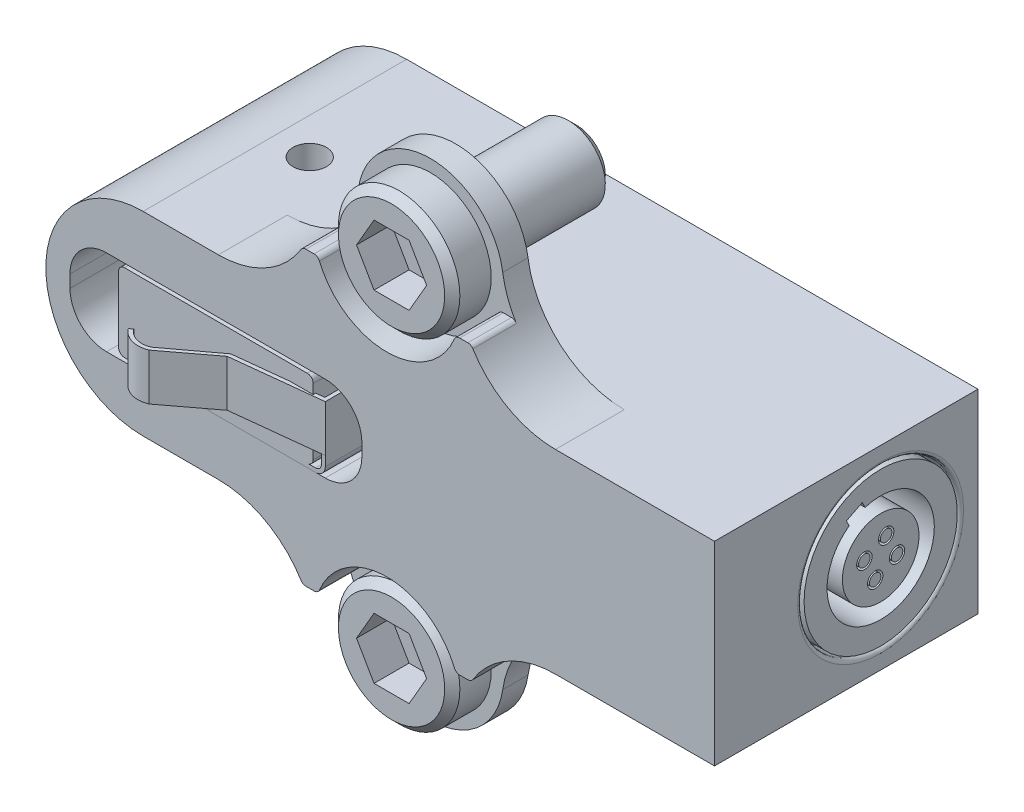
ISO-10303-21;
HEADER;
FILE_DESCRIPTION(('STEP AP214'),'2;1');
FILE_NAME('part.step','',(''),(''),'','','');
FILE_SCHEMA(('AUTOMOTIVE_DESIGN { 1 0 10303 214 1 1 1 1 }'));
ENDSEC;
DATA;
#1=APPLICATION_CONTEXT('core data for automotive mechanical design processes');
#2=APPLICATION_PROTOCOL_DEFINITION('international standard','automotive_design',2000,#1);
#3=PRODUCT_CONTEXT('',#1,'mechanical');
#4=PRODUCT('Part','Part','',(#3));
#5=PRODUCT_RELATED_PRODUCT_CATEGORY('part','',(#4));
#6=PRODUCT_DEFINITION_FORMATION('','',#4);
#7=PRODUCT_DEFINITION_CONTEXT('part definition',#1,'design');
#8=PRODUCT_DEFINITION('design','',#6,#7);
#9=PRODUCT_DEFINITION_SHAPE('','',#8);
#10=(LENGTH_UNIT() NAMED_UNIT(*) SI_UNIT(.MILLI.,.METRE.));
#11=(NAMED_UNIT(*) PLANE_ANGLE_UNIT() SI_UNIT($,.RADIAN.));
#12=(NAMED_UNIT(*) SI_UNIT($,.STERADIAN.) SOLID_ANGLE_UNIT());
#13=UNCERTAINTY_MEASURE_WITH_UNIT(LENGTH_MEASURE(1.E-05),#10,'distance_accuracy_value','');
#14=(GEOMETRIC_REPRESENTATION_CONTEXT(3) GLOBAL_UNCERTAINTY_ASSIGNED_CONTEXT((#13)) GLOBAL_UNIT_ASSIGNED_CONTEXT((#10,
#11,#12)) REPRESENTATION_CONTEXT('',''));
#15=CARTESIAN_POINT('',(0.,0.,0.));
#16=DIRECTION('',(0.,0.,1.));
#17=DIRECTION('',(1.,0.,0.));
#18=AXIS2_PLACEMENT_3D('',#15,#16,#17);
#19=CARTESIAN_POINT('',(-2.46330733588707E-13,-0.0678851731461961,-9.77919970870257));
#20=DIRECTION('',(1.,0.,0.));
#21=DIRECTION('',(0.,0.,-1.));
#22=AXIS2_PLACEMENT_3D('',#19,#20,#21);
#23=PLANE('',#22);
#24=CARTESIAN_POINT('',(-2.46330733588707E-13,-0.0678851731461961,-9.77919970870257));
#25=DIRECTION('',(1.,0.,0.));
#26=DIRECTION('',(0.,0.,-1.));
#27=AXIS2_PLACEMENT_3D('',#24,#25,#26);
#28=CIRCLE('',#27,0.374999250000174);
#29=CARTESIAN_POINT('',(-2.45956034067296E-13,-0.0678851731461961,-10.1541989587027));
#30=VERTEX_POINT('',#29);
#31=EDGE_CURVE('P0_E20',#30,#30,#28,.F.);
#32=ORIENTED_EDGE('',*,*,#31,.F.);
#33=EDGE_LOOP('',(#32));
#34=FACE_BOUND('',#33,.T.);
#35=ADVANCED_FACE('P0_F17',(#34),#23,.T.);
#36=CARTESIAN_POINT('',(-2.46330733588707E-13,-0.783381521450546,-11.9124002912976));
#37=DIRECTION('',(1.,0.,0.));
#38=DIRECTION('',(0.,0.,-1.));
#39=AXIS2_PLACEMENT_3D('',#36,#37,#38);
#40=PLANE('',#39);
#41=CARTESIAN_POINT('',(-2.46330733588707E-13,-0.783381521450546,-11.9124002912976));
#42=DIRECTION('',(1.,0.,0.));
#43=DIRECTION('',(0.,0.,-1.));
#44=AXIS2_PLACEMENT_3D('',#41,#42,#43);
#45=CIRCLE('',#44,0.374999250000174);
#46=CARTESIAN_POINT('',(-2.45956034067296E-13,-0.783381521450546,-12.2873995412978));
#47=VERTEX_POINT('',#46);
#48=EDGE_CURVE('P0_E138',#47,#47,#45,.F.);
#49=ORIENTED_EDGE('',*,*,#48,.F.);
#50=EDGE_LOOP('',(#49));
#51=FACE_BOUND('',#50,.T.);
#52=ADVANCED_FACE('P0_F148',(#51),#40,.T.);
#53=CARTESIAN_POINT('',(-2.46330733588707E-13,0.640966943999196,-11.2035481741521));
#54=DIRECTION('',(1.,0.,0.));
#55=DIRECTION('',(0.,0.,-1.));
#56=AXIS2_PLACEMENT_3D('',#53,#54,#55);
#57=PLANE('',#56);
#58=CARTESIAN_POINT('',(-2.46330733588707E-13,0.640966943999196,-11.2035481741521));
#59=DIRECTION('',(1.,0.,0.));
#60=DIRECTION('',(0.,0.,-1.));
#61=AXIS2_PLACEMENT_3D('',#58,#59,#60);
#62=CIRCLE('',#61,0.374999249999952);
#63=CARTESIAN_POINT('',(-2.45956034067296E-13,0.640966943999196,-11.5785474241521));
#64=VERTEX_POINT('',#63);
#65=EDGE_CURVE('P0_E136',#64,#64,#62,.F.);
#66=ORIENTED_EDGE('',*,*,#65,.F.);
#67=EDGE_LOOP('',(#66));
#68=FACE_BOUND('',#67,.T.);
#69=ADVANCED_FACE('P0_F153',(#68),#57,.T.);
#70=CARTESIAN_POINT('',(-2.46330733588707E-13,-1.49223363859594,-10.4880518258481));
#71=DIRECTION('',(1.,0.,0.));
#72=DIRECTION('',(0.,0.,-1.));
#73=AXIS2_PLACEMENT_3D('',#70,#71,#72);
#74=PLANE('',#73);
#75=CARTESIAN_POINT('',(-2.46330733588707E-13,-1.49223363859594,-10.4880518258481));
#76=DIRECTION('',(1.,0.,0.));
#77=DIRECTION('',(0.,0.,-1.));
#78=AXIS2_PLACEMENT_3D('',#75,#76,#77);
#79=CIRCLE('',#78,0.374999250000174);
#80=CARTESIAN_POINT('',(-2.45956034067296E-13,-1.49223363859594,-10.8630510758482));
#81=VERTEX_POINT('',#80);
#82=EDGE_CURVE('P0_E133',#81,#81,#79,.F.);
#83=ORIENTED_EDGE('',*,*,#82,.F.);
#84=EDGE_LOOP('',(#83));
#85=FACE_BOUND('',#84,.T.);
#86=ADVANCED_FACE('P0_F240',(#85),#74,.T.);
#87=CARTESIAN_POINT('',(-2.46330733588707E-13,-0.0678851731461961,-9.77919970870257));
#88=DIRECTION('',(1.,0.,0.));
#89=DIRECTION('',(0.,0.,-1.));
#90=AXIS2_PLACEMENT_3D('',#87,#88,#89);
#91=CYLINDRICAL_SURFACE('',#90,0.374999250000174);
#92=CARTESIAN_POINT('',(-9.52500000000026,-0.0678851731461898,-9.77919970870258));
#93=DIRECTION('',(1.,0.,0.));
#94=DIRECTION('',(0.,0.,-1.));
#95=AXIS2_PLACEMENT_3D('',#92,#93,#94);
#96=CIRCLE('',#95,0.374999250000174);
#97=CARTESIAN_POINT('',(-9.52500000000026,-0.0678851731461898,-10.1541989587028));
#98=VERTEX_POINT('',#97);
#99=EDGE_CURVE('P0_E130',#98,#98,#96,.F.);
#100=ORIENTED_EDGE('',*,*,#99,.F.);
#101=EDGE_LOOP('',(#100));
#102=FACE_BOUND('',#101,.T.);
#103=ORIENTED_EDGE('',*,*,#31,.T.);
#104=EDGE_LOOP('',(#103));
#105=FACE_BOUND('',#104,.T.);
#106=ADVANCED_FACE('P0_F145',(#102,#105),#91,.T.);
#107=CARTESIAN_POINT('',(-2.46330733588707E-13,-0.783381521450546,-11.9124002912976));
#108=DIRECTION('',(1.,0.,0.));
#109=DIRECTION('',(0.,0.,-1.));
#110=AXIS2_PLACEMENT_3D('',#107,#108,#109);
#111=CYLINDRICAL_SURFACE('',#110,0.374999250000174);
#112=CARTESIAN_POINT('',(-9.52500000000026,-0.78338152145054,-11.9124002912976));
#113=DIRECTION('',(1.,0.,0.));
#114=DIRECTION('',(0.,0.,-1.));
#115=AXIS2_PLACEMENT_3D('',#112,#113,#114);
#116=CIRCLE('',#115,0.374999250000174);
#117=CARTESIAN_POINT('',(-9.52500000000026,-0.78338152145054,-12.2873995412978));
#118=VERTEX_POINT('',#117);
#119=EDGE_CURVE('P0_E127',#118,#118,#116,.F.);
#120=ORIENTED_EDGE('',*,*,#119,.F.);
#121=EDGE_LOOP('',(#120));
#122=FACE_BOUND('',#121,.T.);
#123=ORIENTED_EDGE('',*,*,#48,.T.);
#124=EDGE_LOOP('',(#123));
#125=FACE_BOUND('',#124,.T.);
#126=ADVANCED_FACE('P0_F233',(#122,#125),#111,.T.);
#127=CARTESIAN_POINT('',(-2.46330733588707E-13,0.640966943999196,-11.2035481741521));
#128=DIRECTION('',(1.,0.,0.));
#129=DIRECTION('',(0.,0.,-1.));
#130=AXIS2_PLACEMENT_3D('',#127,#128,#129);
#131=CYLINDRICAL_SURFACE('',#130,0.374999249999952);
#132=CARTESIAN_POINT('',(-9.52500000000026,0.640966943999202,-11.2035481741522));
#133=DIRECTION('',(1.,0.,0.));
#134=DIRECTION('',(0.,0.,-1.));
#135=AXIS2_PLACEMENT_3D('',#132,#133,#134);
#136=CIRCLE('',#135,0.374999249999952);
#137=CARTESIAN_POINT('',(-9.52500000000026,0.640966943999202,-11.5785474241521));
#138=VERTEX_POINT('',#137);
#139=EDGE_CURVE('P0_E124',#138,#138,#136,.F.);
#140=ORIENTED_EDGE('',*,*,#139,.F.);
#141=EDGE_LOOP('',(#140));
#142=FACE_BOUND('',#141,.T.);
#143=ORIENTED_EDGE('',*,*,#65,.T.);
#144=EDGE_LOOP('',(#143));
#145=FACE_BOUND('',#144,.T.);
#146=ADVANCED_FACE('P0_F229',(#142,#145),#131,.T.);
#147=CARTESIAN_POINT('',(-2.46330733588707E-13,-1.49223363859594,-10.4880518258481));
#148=DIRECTION('',(1.,0.,0.));
#149=DIRECTION('',(0.,0.,-1.));
#150=AXIS2_PLACEMENT_3D('',#147,#148,#149);
#151=CYLINDRICAL_SURFACE('',#150,0.374999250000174);
#152=CARTESIAN_POINT('',(-9.52500000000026,-1.49223363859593,-10.4880518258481));
#153=DIRECTION('',(1.,0.,0.));
#154=DIRECTION('',(0.,0.,-1.));
#155=AXIS2_PLACEMENT_3D('',#152,#153,#154);
#156=CIRCLE('',#155,0.374999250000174);
#157=CARTESIAN_POINT('',(-9.52500000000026,-1.49223363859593,-10.8630510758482));
#158=VERTEX_POINT('',#157);
#159=EDGE_CURVE('P0_E121',#158,#158,#156,.F.);
#160=ORIENTED_EDGE('',*,*,#159,.F.);
#161=EDGE_LOOP('',(#160));
#162=FACE_BOUND('',#161,.T.);
#163=ORIENTED_EDGE('',*,*,#82,.T.);
#164=EDGE_LOOP('',(#163));
#165=FACE_BOUND('',#164,.T.);
#166=ADVANCED_FACE('P0_F225',(#162,#165),#151,.T.);
#167=CARTESIAN_POINT('',(-9.52500000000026,-0.0678851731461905,-9.77919970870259));
#168=DIRECTION('',(1.,0.,0.));
#169=DIRECTION('',(0.,0.,-1.));
#170=AXIS2_PLACEMENT_3D('',#167,#168,#169);
#171=PLANE('',#170);
#172=ORIENTED_EDGE('',*,*,#99,.T.);
#173=EDGE_LOOP('',(#172));
#174=FACE_BOUND('',#173,.T.);
#175=CARTESIAN_POINT('',(-9.52500000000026,-0.0678851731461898,-9.77919970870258));
#176=DIRECTION('',(1.,0.,0.));
#177=DIRECTION('',(0.,0.,-1.));
#178=AXIS2_PLACEMENT_3D('',#175,#176,#177);
#179=CIRCLE('',#178,0.499999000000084);
#180=CARTESIAN_POINT('',(-9.52500000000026,-0.0678851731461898,-10.2791987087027));
#181=VERTEX_POINT('',#180);
#182=EDGE_CURVE('P0_E118',#181,#181,#179,.T.);
#183=ORIENTED_EDGE('',*,*,#182,.T.);
#184=EDGE_LOOP('',(#183));
#185=FACE_BOUND('',#184,.T.);
#186=ADVANCED_FACE('P0_F221',(#174,#185),#171,.T.);
#187=CARTESIAN_POINT('',(-9.52500000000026,-0.78338152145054,-11.9124002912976));
#188=DIRECTION('',(1.,0.,0.));
#189=DIRECTION('',(0.,0.,-1.));
#190=AXIS2_PLACEMENT_3D('',#187,#188,#189);
#191=PLANE('',#190);
#192=ORIENTED_EDGE('',*,*,#119,.T.);
#193=EDGE_LOOP('',(#192));
#194=FACE_BOUND('',#193,.T.);
#195=CARTESIAN_POINT('',(-9.52500000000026,-0.78338152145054,-11.9124002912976));
#196=DIRECTION('',(1.,0.,0.));
#197=DIRECTION('',(0.,0.,-1.));
#198=AXIS2_PLACEMENT_3D('',#195,#196,#197);
#199=CIRCLE('',#198,0.499999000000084);
#200=CARTESIAN_POINT('',(-9.52500000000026,-0.78338152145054,-12.4123992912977));
#201=VERTEX_POINT('',#200);
#202=EDGE_CURVE('P0_E115',#201,#201,#199,.T.);
#203=ORIENTED_EDGE('',*,*,#202,.T.);
#204=EDGE_LOOP('',(#203));
#205=FACE_BOUND('',#204,.T.);
#206=ADVANCED_FACE('P0_F217',(#194,#205),#191,.T.);
#207=CARTESIAN_POINT('',(-9.52500000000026,0.640966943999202,-11.2035481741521));
#208=DIRECTION('',(1.,0.,0.));
#209=DIRECTION('',(0.,0.,-1.));
#210=AXIS2_PLACEMENT_3D('',#207,#208,#209);
#211=PLANE('',#210);
#212=ORIENTED_EDGE('',*,*,#139,.T.);
#213=EDGE_LOOP('',(#212));
#214=FACE_BOUND('',#213,.T.);
#215=CARTESIAN_POINT('',(-9.52500000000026,0.640966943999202,-11.2035481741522));
#216=DIRECTION('',(1.,0.,0.));
#217=DIRECTION('',(0.,0.,-1.));
#218=AXIS2_PLACEMENT_3D('',#215,#216,#217);
#219=CIRCLE('',#218,0.499998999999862);
#220=CARTESIAN_POINT('',(-9.52500000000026,0.640966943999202,-11.703547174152));
#221=VERTEX_POINT('',#220);
#222=EDGE_CURVE('P0_E112',#221,#221,#219,.T.);
#223=ORIENTED_EDGE('',*,*,#222,.T.);
#224=EDGE_LOOP('',(#223));
#225=FACE_BOUND('',#224,.T.);
#226=ADVANCED_FACE('P0_F213',(#214,#225),#211,.T.);
#227=CARTESIAN_POINT('',(-9.52500000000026,-1.49223363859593,-10.4880518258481));
#228=DIRECTION('',(1.,0.,0.));
#229=DIRECTION('',(0.,0.,-1.));
#230=AXIS2_PLACEMENT_3D('',#227,#228,#229);
#231=PLANE('',#230);
#232=ORIENTED_EDGE('',*,*,#159,.T.);
#233=EDGE_LOOP('',(#232));
#234=FACE_BOUND('',#233,.T.);
#235=CARTESIAN_POINT('',(-9.52500000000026,-1.49223363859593,-10.4880518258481));
#236=DIRECTION('',(1.,0.,0.));
#237=DIRECTION('',(0.,0.,-1.));
#238=AXIS2_PLACEMENT_3D('',#235,#236,#237);
#239=CIRCLE('',#238,0.499999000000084);
#240=CARTESIAN_POINT('',(-9.52500000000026,-1.49223363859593,-10.9880508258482));
#241=VERTEX_POINT('',#240);
#242=EDGE_CURVE('P0_E109',#241,#241,#239,.T.);
#243=ORIENTED_EDGE('',*,*,#242,.T.);
#244=EDGE_LOOP('',(#243));
#245=FACE_BOUND('',#244,.T.);
#246=ADVANCED_FACE('P0_F209',(#234,#245),#231,.T.);
#247=CARTESIAN_POINT('',(-2.46330733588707E-13,-0.0678851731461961,-9.77919970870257));
#248=DIRECTION('',(1.,0.,0.));
#249=DIRECTION('',(0.,0.,-1.));
#250=AXIS2_PLACEMENT_3D('',#247,#248,#249);
#251=CYLINDRICAL_SURFACE('',#250,0.499999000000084);
#252=CARTESIAN_POINT('',(-2.46330733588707E-13,-0.0678851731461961,-9.77919970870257));
#253=DIRECTION('',(1.,0.,0.));
#254=DIRECTION('',(0.,0.,-1.));
#255=AXIS2_PLACEMENT_3D('',#252,#253,#254);
#256=CIRCLE('',#255,0.499999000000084);
#257=CARTESIAN_POINT('',(-2.45831134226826E-13,-0.0678851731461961,-10.2791987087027));
#258=VERTEX_POINT('',#257);
#259=EDGE_CURVE('P0_E106',#258,#258,#256,.F.);
#260=ORIENTED_EDGE('',*,*,#259,.F.);
#261=EDGE_LOOP('',(#260));
#262=FACE_BOUND('',#261,.T.);
#263=ORIENTED_EDGE('',*,*,#182,.F.);
#264=EDGE_LOOP('',(#263));
#265=FACE_BOUND('',#264,.T.);
#266=ADVANCED_FACE('P0_F205',(#262,#265),#251,.F.);
#267=CARTESIAN_POINT('',(-2.46330733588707E-13,-0.783381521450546,-11.9124002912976));
#268=DIRECTION('',(1.,0.,0.));
#269=DIRECTION('',(0.,0.,-1.));
#270=AXIS2_PLACEMENT_3D('',#267,#268,#269);
#271=CYLINDRICAL_SURFACE('',#270,0.499999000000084);
#272=CARTESIAN_POINT('',(-2.46330733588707E-13,-0.783381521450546,-11.9124002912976));
#273=DIRECTION('',(1.,0.,0.));
#274=DIRECTION('',(0.,0.,-1.));
#275=AXIS2_PLACEMENT_3D('',#272,#273,#274);
#276=CIRCLE('',#275,0.499999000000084);
#277=CARTESIAN_POINT('',(-2.45831134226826E-13,-0.783381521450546,-12.4123992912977));
#278=VERTEX_POINT('',#277);
#279=EDGE_CURVE('P0_E103',#278,#278,#276,.F.);
#280=ORIENTED_EDGE('',*,*,#279,.F.);
#281=EDGE_LOOP('',(#280));
#282=FACE_BOUND('',#281,.T.);
#283=ORIENTED_EDGE('',*,*,#202,.F.);
#284=EDGE_LOOP('',(#283));
#285=FACE_BOUND('',#284,.T.);
#286=ADVANCED_FACE('P0_F201',(#282,#285),#271,.F.);
#287=CARTESIAN_POINT('',(-2.46330733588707E-13,0.640966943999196,-11.2035481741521));
#288=DIRECTION('',(1.,0.,0.));
#289=DIRECTION('',(0.,0.,-1.));
#290=AXIS2_PLACEMENT_3D('',#287,#288,#289);
#291=CYLINDRICAL_SURFACE('',#290,0.499998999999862);
#292=CARTESIAN_POINT('',(-2.46330733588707E-13,0.640966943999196,-11.2035481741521));
#293=DIRECTION('',(1.,0.,0.));
#294=DIRECTION('',(0.,0.,-1.));
#295=AXIS2_PLACEMENT_3D('',#292,#293,#294);
#296=CIRCLE('',#295,0.499998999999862);
#297=CARTESIAN_POINT('',(-2.45831134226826E-13,0.640966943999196,-11.703547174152));
#298=VERTEX_POINT('',#297);
#299=EDGE_CURVE('P0_E100',#298,#298,#296,.F.);
#300=ORIENTED_EDGE('',*,*,#299,.F.);
#301=EDGE_LOOP('',(#300));
#302=FACE_BOUND('',#301,.T.);
#303=ORIENTED_EDGE('',*,*,#222,.F.);
#304=EDGE_LOOP('',(#303));
#305=FACE_BOUND('',#304,.T.);
#306=ADVANCED_FACE('P0_F197',(#302,#305),#291,.F.);
#307=CARTESIAN_POINT('',(-2.46330733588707E-13,-1.49223363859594,-10.4880518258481));
#308=DIRECTION('',(1.,0.,0.));
#309=DIRECTION('',(0.,0.,-1.));
#310=AXIS2_PLACEMENT_3D('',#307,#308,#309);
#311=CYLINDRICAL_SURFACE('',#310,0.499999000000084);
#312=CARTESIAN_POINT('',(-2.46330733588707E-13,-1.49223363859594,-10.4880518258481));
#313=DIRECTION('',(1.,0.,0.));
#314=DIRECTION('',(0.,0.,-1.));
#315=AXIS2_PLACEMENT_3D('',#312,#313,#314);
#316=CIRCLE('',#315,0.499999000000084);
#317=CARTESIAN_POINT('',(-2.45831134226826E-13,-1.49223363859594,-10.9880508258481));
#318=VERTEX_POINT('',#317);
#319=EDGE_CURVE('P0_E97',#318,#318,#316,.F.);
#320=ORIENTED_EDGE('',*,*,#319,.F.);
#321=EDGE_LOOP('',(#320));
#322=FACE_BOUND('',#321,.T.);
#323=ORIENTED_EDGE('',*,*,#242,.F.);
#324=EDGE_LOOP('',(#323));
#325=FACE_BOUND('',#324,.T.);
#326=ADVANCED_FACE('P0_F193',(#322,#325),#311,.F.);
#327=CARTESIAN_POINT('',(-2.46330733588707E-13,-0.425633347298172,-10.8458));
#328=DIRECTION('',(1.,0.,0.));
#329=DIRECTION('',(0.,0.,-1.));
#330=AXIS2_PLACEMENT_3D('',#327,#328,#329);
#331=PLANE('',#330);
#332=ORIENTED_EDGE('',*,*,#319,.T.);
#333=EDGE_LOOP('',(#332));
#334=FACE_BOUND('',#333,.T.);
#335=ORIENTED_EDGE('',*,*,#299,.T.);
#336=EDGE_LOOP('',(#335));
#337=FACE_BOUND('',#336,.T.);
#338=CARTESIAN_POINT('',(-2.46330733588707E-13,-0.425633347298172,-10.8458));
#339=DIRECTION('',(1.,0.,0.));
#340=DIRECTION('',(0.,0.,-1.));
#341=AXIS2_PLACEMENT_3D('',#338,#339,#340);
#342=CIRCLE('',#341,2.49963889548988);
#343=CARTESIAN_POINT('',(-2.43833092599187E-13,-0.425633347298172,-13.3454388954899));
#344=VERTEX_POINT('',#343);
#345=EDGE_CURVE('P0_E67',#344,#344,#342,.F.);
#346=ORIENTED_EDGE('',*,*,#345,.F.);
#347=EDGE_LOOP('',(#346));
#348=FACE_BOUND('',#347,.T.);
#349=ORIENTED_EDGE('',*,*,#279,.T.);
#350=EDGE_LOOP('',(#349));
#351=FACE_BOUND('',#350,.T.);
#352=ORIENTED_EDGE('',*,*,#259,.T.);
#353=EDGE_LOOP('',(#352));
#354=FACE_BOUND('',#353,.T.);
#355=ADVANCED_FACE('P0_F189',(#334,#337,#348,#351,#354),#331,.T.);
#356=CARTESIAN_POINT('',(-2.46330733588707E-13,-0.425633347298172,-10.8458));
#357=DIRECTION('',(1.,0.,0.));
#358=DIRECTION('',(0.,0.,-1.));
#359=AXIS2_PLACEMENT_3D('',#356,#357,#358);
#360=CYLINDRICAL_SURFACE('',#359,2.49963889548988);
#361=CARTESIAN_POINT('',(-9.52500000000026,-0.425633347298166,-10.8458));
#362=DIRECTION('',(1.,0.,0.));
#363=DIRECTION('',(0.,0.,-1.));
#364=AXIS2_PLACEMENT_3D('',#361,#362,#363);
#365=CIRCLE('',#364,2.49963889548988);
#366=CARTESIAN_POINT('',(-9.52500000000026,-0.425633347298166,-13.3454388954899));
#367=VERTEX_POINT('',#366);
#368=EDGE_CURVE('P0_E90',#367,#367,#365,.F.);
#369=ORIENTED_EDGE('',*,*,#368,.F.);
#370=EDGE_LOOP('',(#369));
#371=FACE_BOUND('',#370,.T.);
#372=ORIENTED_EDGE('',*,*,#345,.T.);
#373=EDGE_LOOP('',(#372));
#374=FACE_BOUND('',#373,.T.);
#375=ADVANCED_FACE('P0_F186',(#371,#374),#360,.T.);
#376=CARTESIAN_POINT('',(-9.52500000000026,2.77118508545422,-8.6050694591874));
#377=DIRECTION('',(0.,0.89526086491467,0.445542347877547));
#378=DIRECTION('',(0.,-0.445542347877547,0.89526086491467));
#379=AXIS2_PLACEMENT_3D('',#376,#377,#378);
#380=PLANE('',#379);
#381=DIRECTION('',(1.,0.,0.));
#382=VECTOR('',#381,1.);
#383=CARTESIAN_POINT('',(-9.52500000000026,2.77118508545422,-8.6050694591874));
#384=LINE('',#383,#382);
#385=CARTESIAN_POINT('',(-2.42283045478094E-13,2.77118508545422,-8.60506945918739));
#386=VERTEX_POINT('',#385);
#387=CARTESIAN_POINT('',(-9.52500000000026,2.77118508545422,-8.6050694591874));
#388=VERTEX_POINT('',#387);
#389=EDGE_CURVE('P0_E63',#386,#388,#384,.F.);
#390=ORIENTED_EDGE('',*,*,#389,.T.);
#391=DIRECTION('',(0.,-0.445542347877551,0.895260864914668));
#392=VECTOR('',#391,1.);
#393=CARTESIAN_POINT('',(-9.52500000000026,3.28954720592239,-9.64665242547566));
#394=LINE('',#393,#392);
#395=CARTESIAN_POINT('',(-9.52500000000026,3.28954720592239,-9.64665242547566));
#396=VERTEX_POINT('',#395);
#397=EDGE_CURVE('P0_E94',#396,#388,#394,.T.);
#398=ORIENTED_EDGE('',*,*,#397,.F.);
#399=DIRECTION('',(1.,0.,0.));
#400=VECTOR('',#399,1.);
#401=CARTESIAN_POINT('',(-9.52500000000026,3.28954720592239,-9.64665242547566));
#402=LINE('',#401,#400);
#403=CARTESIAN_POINT('',(-2.45174251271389E-13,3.28954720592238,-9.64665242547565));
#404=VERTEX_POINT('',#403);
#405=EDGE_CURVE('P0_E66',#396,#404,#402,.T.);
#406=ORIENTED_EDGE('',*,*,#405,.T.);
#407=DIRECTION('',(0.,-0.445542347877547,0.89526086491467));
#408=VECTOR('',#407,1.);
#409=CARTESIAN_POINT('',(-2.42861286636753E-13,2.77118508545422,-8.6050694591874));
#410=LINE('',#409,#408);
#411=EDGE_CURVE('P0_E54',#386,#404,#410,.F.);
#412=ORIENTED_EDGE('',*,*,#411,.F.);
#413=EDGE_LOOP('',(#390,#398,#406,#412));
#414=FACE_BOUND('',#413,.T.);
#415=ADVANCED_FACE('P0_F64',(#414),#380,.F.);
#416=CARTESIAN_POINT('',(-9.52500000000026,2.40500988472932,-8.78730300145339));
#417=DIRECTION('',(0.,-0.445542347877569,0.895260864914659));
#418=DIRECTION('',(0.,-0.895260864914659,-0.445542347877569));
#419=AXIS2_PLACEMENT_3D('',#416,#417,#418);
#420=PLANE('',#419);
#421=DIRECTION('',(1.,0.,0.));
#422=VECTOR('',#421,1.);
#423=CARTESIAN_POINT('',(-9.52500000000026,2.40500988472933,-8.78730300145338));
#424=LINE('',#423,#422);
#425=CARTESIAN_POINT('',(-2.44942522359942E-13,2.40500988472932,-8.78730300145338));
#426=VERTEX_POINT('',#425);
#427=CARTESIAN_POINT('',(-9.52500000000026,2.40500988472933,-8.78730300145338));
#428=VERTEX_POINT('',#427);
#429=EDGE_CURVE('P0_E48',#426,#428,#424,.F.);
#430=ORIENTED_EDGE('',*,*,#429,.T.);
#431=DIRECTION('',(0.,-0.895260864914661,-0.445542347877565));
#432=VECTOR('',#431,1.);
#433=CARTESIAN_POINT('',(-9.52500000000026,2.77118508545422,-8.6050694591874));
#434=LINE('',#433,#432);
#435=EDGE_CURVE('P0_E73',#388,#428,#434,.T.);
#436=ORIENTED_EDGE('',*,*,#435,.F.);
#437=ORIENTED_EDGE('',*,*,#389,.F.);
#438=DIRECTION('',(0.,-0.895260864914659,-0.445542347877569));
#439=VECTOR('',#438,1.);
#440=CARTESIAN_POINT('',(-2.42861286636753E-13,2.40500988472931,-8.78730300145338));
#441=LINE('',#440,#439);
#442=EDGE_CURVE('P0_E69',#426,#386,#441,.F.);
#443=ORIENTED_EDGE('',*,*,#442,.F.);
#444=EDGE_LOOP('',(#430,#436,#437,#443));
#445=FACE_BOUND('',#444,.T.);
#446=ADVANCED_FACE('P0_F75',(#445),#420,.F.);
#447=CARTESIAN_POINT('',(-9.52500000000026,-0.425633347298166,-10.8458));
#448=DIRECTION('',(1.,0.,0.));
#449=DIRECTION('',(0.,0.,-1.));
#450=AXIS2_PLACEMENT_3D('',#447,#448,#449);
#451=PLANE('',#450);
#452=ORIENTED_EDGE('',*,*,#368,.T.);
#453=EDGE_LOOP('',(#452));
#454=FACE_BOUND('',#453,.T.);
#455=DIRECTION('',(0.,0.89526086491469,0.445542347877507));
#456=VECTOR('',#455,1.);
#457=CARTESIAN_POINT('',(-9.52500000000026,2.92337200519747,-9.82888596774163));
#458=LINE('',#457,#456);
#459=CARTESIAN_POINT('',(-9.52500000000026,2.92337200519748,-9.82888596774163));
#460=VERTEX_POINT('',#459);
#461=EDGE_CURVE('P0_E93',#460,#396,#458,.T.);
#462=ORIENTED_EDGE('',*,*,#461,.T.);
#463=ORIENTED_EDGE('',*,*,#397,.T.);
#464=ORIENTED_EDGE('',*,*,#435,.T.);
#465=CARTESIAN_POINT('',(-9.52500000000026,-0.425633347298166,-10.8458));
#466=DIRECTION('',(1.,0.,0.));
#467=DIRECTION('',(0.,0.,-1.));
#468=AXIS2_PLACEMENT_3D('',#465,#466,#467);
#469=CIRCLE('',#468,3.49999299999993);
#470=EDGE_CURVE('P0_E88',#428,#460,#469,.T.);
#471=ORIENTED_EDGE('',*,*,#470,.T.);
#472=EDGE_LOOP('',(#462,#463,#464,#471));
#473=FACE_BOUND('',#472,.T.);
#474=ADVANCED_FACE('P0_F177',(#454,#473),#451,.T.);
#475=CARTESIAN_POINT('',(-9.52500000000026,2.92337200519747,-9.82888596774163));
#476=DIRECTION('',(0.,0.445542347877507,-0.89526086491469));
#477=DIRECTION('',(0.,0.89526086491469,0.445542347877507));
#478=AXIS2_PLACEMENT_3D('',#475,#476,#477);
#479=PLANE('',#478);
#480=ORIENTED_EDGE('',*,*,#405,.F.);
#481=ORIENTED_EDGE('',*,*,#461,.F.);
#482=DIRECTION('',(1.,0.,0.));
#483=VECTOR('',#482,1.);
#484=CARTESIAN_POINT('',(-9.52500000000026,2.92337200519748,-9.82888596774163));
#485=LINE('',#484,#483);
#486=CARTESIAN_POINT('',(-2.45984221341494E-13,2.92337200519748,-9.82888596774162));
#487=VERTEX_POINT('',#486);
#488=EDGE_CURVE('P0_E87',#460,#487,#485,.T.);
#489=ORIENTED_EDGE('',*,*,#488,.T.);
#490=DIRECTION('',(0.,0.89526086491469,0.445542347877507));
#491=VECTOR('',#490,1.);
#492=CARTESIAN_POINT('',(-2.46330733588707E-13,2.92337200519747,-9.82888596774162));
#493=LINE('',#492,#491);
#494=EDGE_CURVE('P0_E35',#404,#487,#493,.F.);
#495=ORIENTED_EDGE('',*,*,#494,.F.);
#496=EDGE_LOOP('',(#480,#481,#489,#495));
#497=FACE_BOUND('',#496,.T.);
#498=ADVANCED_FACE('P0_F173',(#497),#479,.F.);
#499=CARTESIAN_POINT('',(-9.52500000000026,-0.425633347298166,-10.8458));
#500=DIRECTION('',(1.,0.,0.));
#501=DIRECTION('',(0.,0.,-1.));
#502=AXIS2_PLACEMENT_3D('',#499,#500,#501);
#503=CYLINDRICAL_SURFACE('',#502,3.49999299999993);
#504=ORIENTED_EDGE('',*,*,#488,.F.);
#505=ORIENTED_EDGE('',*,*,#470,.F.);
#506=ORIENTED_EDGE('',*,*,#429,.F.);
#507=CARTESIAN_POINT('',(-2.46330733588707E-13,-0.425633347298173,-10.8458));
#508=DIRECTION('',(1.,0.,0.));
#509=DIRECTION('',(0.,0.,-1.));
#510=AXIS2_PLACEMENT_3D('',#507,#508,#509);
#511=CIRCLE('',#510,3.49999299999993);
#512=EDGE_CURVE('P0_E72',#487,#426,#511,.F.);
#513=ORIENTED_EDGE('',*,*,#512,.F.);
#514=EDGE_LOOP('',(#504,#505,#506,#513));
#515=FACE_BOUND('',#514,.T.);
#516=ADVANCED_FACE('P0_F169',(#515),#503,.F.);
#517=CARTESIAN_POINT('',(-2.46330733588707E-13,-0.425633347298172,-10.8458));
#518=DIRECTION('',(1.,0.,0.));
#519=DIRECTION('',(0.,0.,-1.));
#520=AXIS2_PLACEMENT_3D('',#517,#518,#519);
#521=PLANE('',#520);
#522=CARTESIAN_POINT('',(-2.42861286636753E-13,-0.425633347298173,-10.8458));
#523=DIRECTION('',(-1.,0.,0.));
#524=DIRECTION('',(0.,0.,1.));
#525=AXIS2_PLACEMENT_3D('',#522,#523,#524);
#526=CIRCLE('',#525,4.99999);
#527=CARTESIAN_POINT('',(-2.47857280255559E-13,-0.425633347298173,-5.84580999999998));
#528=VERTEX_POINT('',#527);
#529=EDGE_CURVE('P0_E26',#528,#528,#526,.T.);
#530=ORIENTED_EDGE('',*,*,#529,.F.);
#531=EDGE_LOOP('',(#530));
#532=FACE_BOUND('',#531,.T.);
#533=ORIENTED_EDGE('',*,*,#494,.T.);
#534=ORIENTED_EDGE('',*,*,#512,.T.);
#535=ORIENTED_EDGE('',*,*,#442,.T.);
#536=ORIENTED_EDGE('',*,*,#411,.T.);
#537=EDGE_LOOP('',(#533,#534,#535,#536));
#538=FACE_BOUND('',#537,.T.);
#539=ADVANCED_FACE('P0_F70',(#532,#538),#521,.T.);
#540=CARTESIAN_POINT('',(-13.7159999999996,-0.425633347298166,-10.8458));
#541=DIRECTION('',(1.,0.,0.));
#542=DIRECTION('',(0.,0.,-1.));
#543=AXIS2_PLACEMENT_3D('',#540,#541,#542);
#544=PLANE('',#543);
#545=CARTESIAN_POINT('',(-13.7159999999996,-0.425633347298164,-10.8458));
#546=DIRECTION('',(-1.,0.,0.));
#547=DIRECTION('',(0.,0.,1.));
#548=AXIS2_PLACEMENT_3D('',#545,#546,#547);
#549=CIRCLE('',#548,4.99999);
#550=CARTESIAN_POINT('',(-13.7159999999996,-0.425633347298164,-5.84581));
#551=VERTEX_POINT('',#550);
#552=EDGE_CURVE('P0_E11',#551,#551,#549,.F.);
#553=ORIENTED_EDGE('',*,*,#552,.F.);
#554=EDGE_LOOP('',(#553));
#555=FACE_BOUND('',#554,.T.);
#556=ADVANCED_FACE('P0_F157',(#555),#544,.F.);
#557=CARTESIAN_POINT('',(-14.9860000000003,-0.425633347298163,-10.8458));
#558=DIRECTION('',(-1.,0.,0.));
#559=DIRECTION('',(0.,0.,1.));
#560=AXIS2_PLACEMENT_3D('',#557,#558,#559);
#561=CYLINDRICAL_SURFACE('',#560,4.99999);
#562=ORIENTED_EDGE('',*,*,#529,.T.);
#563=EDGE_LOOP('',(#562));
#564=FACE_BOUND('',#563,.T.);
#565=ORIENTED_EDGE('',*,*,#552,.T.);
#566=EDGE_LOOP('',(#565));
#567=FACE_BOUND('',#566,.T.);
#568=ADVANCED_FACE('P0_F155',(#564,#567),#561,.T.);
#569=CLOSED_SHELL('',(#35,#52,#69,#86,#106,#126,#146,#166,#186,#206,#226,#246,#266,#286,#306,
#326,#355,#375,#415,#446,#474,#498,#516,#539,#556,#568));
#570=MANIFOLD_SOLID_BREP('P0_B1',#569);
#571=CARTESIAN_POINT('',(-21.3793444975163,-15.5005333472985,-2.5908));
#572=DIRECTION('',(0.,0.,1.));
#573=DIRECTION('',(1.,0.,0.));
#574=AXIS2_PLACEMENT_3D('',#571,#572,#573);
#575=PLANE('',#574);
#576=DIRECTION('',(1.,0.,0.));
#577=VECTOR('',#576,1.);
#578=CARTESIAN_POINT('',(-20.2354981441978,-9.55693334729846,-2.5908));
#579=LINE('',#578,#577);
#580=CARTESIAN_POINT('',(-20.2354981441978,-9.55693334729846,-2.5908));
#581=VERTEX_POINT('',#580);
#582=CARTESIAN_POINT('',(-22.5231908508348,-9.55693334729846,-2.5908));
#583=VERTEX_POINT('',#582);
#584=EDGE_CURVE('P1_E98',#581,#583,#579,.F.);
#585=ORIENTED_EDGE('',*,*,#584,.T.);
#586=DIRECTION('',(-0.5,-0.866025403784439,0.));
#587=VECTOR('',#586,1.);
#588=CARTESIAN_POINT('',(-22.5231908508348,-9.55693334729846,-2.5908));
#589=LINE('',#588,#587);
#590=CARTESIAN_POINT('',(-23.6670372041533,-11.5381333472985,-2.5908));
#591=VERTEX_POINT('',#590);
#592=EDGE_CURVE('P1_E223',#583,#591,#589,.T.);
#593=ORIENTED_EDGE('',*,*,#592,.T.);
#594=DIRECTION('',(0.5,-0.866025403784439,0.));
#595=VECTOR('',#594,1.);
#596=CARTESIAN_POINT('',(-23.6670372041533,-11.5381333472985,-2.5908));
#597=LINE('',#596,#595);
#598=CARTESIAN_POINT('',(-22.5231908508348,-13.5193333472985,-2.5908));
#599=VERTEX_POINT('',#598);
#600=EDGE_CURVE('P1_E218',#591,#599,#597,.T.);
#601=ORIENTED_EDGE('',*,*,#600,.T.);
#602=DIRECTION('',(1.,0.,0.));
#603=VECTOR('',#602,1.);
#604=CARTESIAN_POINT('',(-22.5231908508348,-13.5193333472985,-2.5908));
#605=LINE('',#604,#603);
#606=CARTESIAN_POINT('',(-20.2354981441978,-13.5193333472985,-2.5908));
#607=VERTEX_POINT('',#606);
#608=EDGE_CURVE('P1_E81',#599,#607,#605,.T.);
#609=ORIENTED_EDGE('',*,*,#608,.T.);
#610=DIRECTION('',(0.5,0.866025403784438,0.));
#611=VECTOR('',#610,1.);
#612=CARTESIAN_POINT('',(-20.2354981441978,-13.5193333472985,-2.5908));
#613=LINE('',#612,#611);
#614=CARTESIAN_POINT('',(-19.0916517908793,-11.5381333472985,-2.5908));
#615=VERTEX_POINT('',#614);
#616=EDGE_CURVE('P1_E78',#607,#615,#613,.T.);
#617=ORIENTED_EDGE('',*,*,#616,.T.);
#618=DIRECTION('',(-0.5,0.866025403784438,0.));
#619=VECTOR('',#618,1.);
#620=CARTESIAN_POINT('',(-19.0916517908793,-11.5381333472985,-2.5908));
#621=LINE('',#620,#619);
#622=EDGE_CURVE('P1_E75',#615,#581,#621,.T.);
#623=ORIENTED_EDGE('',*,*,#622,.T.);
#624=EDGE_LOOP('',(#585,#593,#601,#609,#617,#623));
#625=FACE_BOUND('',#624,.T.);
#626=ADVANCED_FACE('P1_F17',(#625),#575,.T.);
#627=CARTESIAN_POINT('',(-20.2354981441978,-13.5193333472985,-2.5908));
#628=DIRECTION('',(0.866025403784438,-0.5,0.));
#629=DIRECTION('',(0.5,0.866025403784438,0.));
#630=AXIS2_PLACEMENT_3D('',#627,#628,#629);
#631=PLANE('',#630);
#632=DIRECTION('',(0.,0.,1.));
#633=VECTOR('',#632,1.);
#634=CARTESIAN_POINT('',(-19.0916517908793,-11.5381333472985,-2.5908));
#635=LINE('',#634,#633);
#636=CARTESIAN_POINT('',(-19.0916517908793,-11.5381333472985,-0.3048));
#637=VERTEX_POINT('',#636);
#638=EDGE_CURVE('P1_E84',#637,#615,#635,.F.);
#639=ORIENTED_EDGE('',*,*,#638,.T.);
#640=ORIENTED_EDGE('',*,*,#616,.F.);
#641=DIRECTION('',(0.,0.,-1.));
#642=VECTOR('',#641,1.);
#643=CARTESIAN_POINT('',(-20.2354981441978,-13.5193333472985,-2.5908));
#644=LINE('',#643,#642);
#645=CARTESIAN_POINT('',(-20.2354981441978,-13.5193333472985,-0.3048));
#646=VERTEX_POINT('',#645);
#647=EDGE_CURVE('P1_E212',#607,#646,#644,.F.);
#648=ORIENTED_EDGE('',*,*,#647,.T.);
#649=DIRECTION('',(0.500000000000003,0.866025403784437,0.));
#650=VECTOR('',#649,1.);
#651=CARTESIAN_POINT('',(-20.2354981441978,-13.5193333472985,-0.3048));
#652=LINE('',#651,#650);
#653=EDGE_CURVE('P1_E89',#646,#637,#652,.T.);
#654=ORIENTED_EDGE('',*,*,#653,.T.);
#655=EDGE_LOOP('',(#639,#640,#648,#654));
#656=FACE_BOUND('',#655,.T.);
#657=ADVANCED_FACE('P1_F87',(#656),#631,.F.);
#658=CARTESIAN_POINT('',(-19.0916517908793,-11.5381333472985,-2.5908));
#659=DIRECTION('',(0.866025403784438,0.5,0.));
#660=DIRECTION('',(-0.5,0.866025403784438,0.));
#661=AXIS2_PLACEMENT_3D('',#658,#659,#660);
#662=PLANE('',#661);
#663=DIRECTION('',(0.,0.,1.));
#664=VECTOR('',#663,1.);
#665=CARTESIAN_POINT('',(-20.2354981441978,-9.55693334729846,-2.5908));
#666=LINE('',#665,#664);
#667=CARTESIAN_POINT('',(-20.2354981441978,-9.55693334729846,-0.3048));
#668=VERTEX_POINT('',#667);
#669=EDGE_CURVE('P1_E95',#668,#581,#666,.F.);
#670=ORIENTED_EDGE('',*,*,#669,.T.);
#671=ORIENTED_EDGE('',*,*,#622,.F.);
#672=ORIENTED_EDGE('',*,*,#638,.F.);
#673=DIRECTION('',(-0.500000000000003,0.866025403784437,0.));
#674=VECTOR('',#673,1.);
#675=CARTESIAN_POINT('',(-19.0916517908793,-11.5381333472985,-0.3048));
#676=LINE('',#675,#674);
#677=EDGE_CURVE('P1_E209',#637,#668,#676,.T.);
#678=ORIENTED_EDGE('',*,*,#677,.T.);
#679=EDGE_LOOP('',(#670,#671,#672,#678));
#680=FACE_BOUND('',#679,.T.);
#681=ADVANCED_FACE('P1_F93',(#680),#662,.F.);
#682=CARTESIAN_POINT('',(-20.2354981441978,-9.55693334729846,-2.5908));
#683=DIRECTION('',(0.,1.,0.));
#684=DIRECTION('',(0.,0.,1.));
#685=AXIS2_PLACEMENT_3D('',#682,#683,#684);
#686=PLANE('',#685);
#687=DIRECTION('',(0.,0.,1.));
#688=VECTOR('',#687,1.);
#689=CARTESIAN_POINT('',(-22.5231908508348,-9.55693334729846,-2.5908));
#690=LINE('',#689,#688);
#691=CARTESIAN_POINT('',(-22.5231908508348,-9.55693334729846,-0.3048));
#692=VERTEX_POINT('',#691);
#693=EDGE_CURVE('P1_E225',#692,#583,#690,.F.);
#694=ORIENTED_EDGE('',*,*,#693,.T.);
#695=ORIENTED_EDGE('',*,*,#584,.F.);
#696=ORIENTED_EDGE('',*,*,#669,.F.);
#697=DIRECTION('',(-1.,0.,0.));
#698=VECTOR('',#697,1.);
#699=CARTESIAN_POINT('',(-21.3793444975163,-9.55693334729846,-0.3048));
#700=LINE('',#699,#698);
#701=EDGE_CURVE('P1_E207',#668,#692,#700,.T.);
#702=ORIENTED_EDGE('',*,*,#701,.T.);
#703=EDGE_LOOP('',(#694,#695,#696,#702));
#704=FACE_BOUND('',#703,.T.);
#705=ADVANCED_FACE('P1_F161',(#704),#686,.F.);
#706=CARTESIAN_POINT('',(-22.5231908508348,-9.55693334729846,-2.5908));
#707=DIRECTION('',(-0.866025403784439,0.5,0.));
#708=DIRECTION('',(-0.5,-0.866025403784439,0.));
#709=AXIS2_PLACEMENT_3D('',#706,#707,#708);
#710=PLANE('',#709);
#711=DIRECTION('',(0.,0.,1.));
#712=VECTOR('',#711,1.);
#713=CARTESIAN_POINT('',(-23.6670372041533,-11.5381333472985,-2.5908));
#714=LINE('',#713,#712);
#715=CARTESIAN_POINT('',(-23.6670372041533,-11.5381333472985,-0.3048));
#716=VERTEX_POINT('',#715);
#717=EDGE_CURVE('P1_E220',#716,#591,#714,.F.);
#718=ORIENTED_EDGE('',*,*,#717,.T.);
#719=ORIENTED_EDGE('',*,*,#592,.F.);
#720=ORIENTED_EDGE('',*,*,#693,.F.);
#721=DIRECTION('',(-0.5,-0.866025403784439,0.));
#722=VECTOR('',#721,1.);
#723=CARTESIAN_POINT('',(-22.5231908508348,-9.55693334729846,-0.3048));
#724=LINE('',#723,#722);
#725=EDGE_CURVE('P1_E205',#692,#716,#724,.T.);
#726=ORIENTED_EDGE('',*,*,#725,.T.);
#727=EDGE_LOOP('',(#718,#719,#720,#726));
#728=FACE_BOUND('',#727,.T.);
#729=ADVANCED_FACE('P1_F157',(#728),#710,.F.);
#730=CARTESIAN_POINT('',(-23.6670372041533,-11.5381333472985,-2.5908));
#731=DIRECTION('',(-0.866025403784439,-0.5,0.));
#732=DIRECTION('',(0.5,-0.866025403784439,0.));
#733=AXIS2_PLACEMENT_3D('',#730,#731,#732);
#734=PLANE('',#733);
#735=DIRECTION('',(0.,0.,-1.));
#736=VECTOR('',#735,1.);
#737=CARTESIAN_POINT('',(-22.5231908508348,-13.5193333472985,-2.5908));
#738=LINE('',#737,#736);
#739=CARTESIAN_POINT('',(-22.5231908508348,-13.5193333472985,-0.3048));
#740=VERTEX_POINT('',#739);
#741=EDGE_CURVE('P1_E215',#740,#599,#738,.T.);
#742=ORIENTED_EDGE('',*,*,#741,.T.);
#743=ORIENTED_EDGE('',*,*,#600,.F.);
#744=ORIENTED_EDGE('',*,*,#717,.F.);
#745=DIRECTION('',(0.499999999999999,-0.866025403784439,0.));
#746=VECTOR('',#745,1.);
#747=CARTESIAN_POINT('',(-23.6670372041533,-11.5381333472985,-0.3048));
#748=LINE('',#747,#746);
#749=EDGE_CURVE('P1_E203',#716,#740,#748,.T.);
#750=ORIENTED_EDGE('',*,*,#749,.T.);
#751=EDGE_LOOP('',(#742,#743,#744,#750));
#752=FACE_BOUND('',#751,.T.);
#753=ADVANCED_FACE('P1_F153',(#752),#734,.F.);
#754=CARTESIAN_POINT('',(-22.5231908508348,-13.5193333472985,-2.5908));
#755=DIRECTION('',(0.,-1.,0.));
#756=DIRECTION('',(0.,0.,-1.));
#757=AXIS2_PLACEMENT_3D('',#754,#755,#756);
#758=PLANE('',#757);
#759=ORIENTED_EDGE('',*,*,#647,.F.);
#760=ORIENTED_EDGE('',*,*,#608,.F.);
#761=ORIENTED_EDGE('',*,*,#741,.F.);
#762=DIRECTION('',(-1.,0.,0.));
#763=VECTOR('',#762,1.);
#764=CARTESIAN_POINT('',(-21.3793444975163,-13.5193333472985,-0.3048));
#765=LINE('',#764,#763);
#766=EDGE_CURVE('P1_E112',#740,#646,#765,.F.);
#767=ORIENTED_EDGE('',*,*,#766,.T.);
#768=EDGE_LOOP('',(#759,#760,#761,#767));
#769=FACE_BOUND('',#768,.T.);
#770=ADVANCED_FACE('P1_F149',(#769),#758,.F.);
#771=CARTESIAN_POINT('',(-21.3793444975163,-11.5381333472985,-0.3048));
#772=DIRECTION('',(0.,0.,-1.));
#773=DIRECTION('',(-1.,0.,0.));
#774=AXIS2_PLACEMENT_3D('',#771,#772,#773);
#775=PLANE('',#774);
#776=CARTESIAN_POINT('',(-21.3793444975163,-11.5381333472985,-0.304799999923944));
#777=DIRECTION('',(0.,0.,-1.));
#778=DIRECTION('',(0.,1.,0.));
#779=AXIS2_PLACEMENT_3D('',#776,#777,#778);
#780=CIRCLE('',#779,3.46710000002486);
#781=CARTESIAN_POINT('',(-21.3793444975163,-8.0710333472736,-0.304799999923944));
#782=VERTEX_POINT('',#781);
#783=EDGE_CURVE('P1_E110',#782,#782,#780,.T.);
#784=ORIENTED_EDGE('',*,*,#783,.F.);
#785=EDGE_LOOP('',(#784));
#786=FACE_BOUND('',#785,.T.);
#787=ORIENTED_EDGE('',*,*,#749,.F.);
#788=ORIENTED_EDGE('',*,*,#725,.F.);
#789=ORIENTED_EDGE('',*,*,#701,.F.);
#790=ORIENTED_EDGE('',*,*,#677,.F.);
#791=ORIENTED_EDGE('',*,*,#653,.F.);
#792=ORIENTED_EDGE('',*,*,#766,.F.);
#793=EDGE_LOOP('',(#787,#788,#789,#790,#791,#792));
#794=FACE_BOUND('',#793,.T.);
#795=ADVANCED_FACE('P1_F145',(#786,#794),#775,.F.);
#796=CARTESIAN_POINT('',(-21.3793444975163,-11.5381333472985,-0.800099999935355));
#797=DIRECTION('',(0.,0.,-1.));
#798=DIRECTION('',(0.,1.,0.));
#799=AXIS2_PLACEMENT_3D('',#796,#797,#798);
#800=CONICAL_SURFACE('',#799,3.96240000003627,0.785398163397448);
#801=ORIENTED_EDGE('',*,*,#783,.T.);
#802=EDGE_LOOP('',(#801));
#803=FACE_BOUND('',#802,.T.);
#804=CARTESIAN_POINT('',(-21.3793444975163,-11.5381333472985,-0.8001));
#805=DIRECTION('',(0.,0.,1.));
#806=DIRECTION('',(1.,0.,0.));
#807=AXIS2_PLACEMENT_3D('',#804,#805,#806);
#808=CIRCLE('',#807,3.9624);
#809=CARTESIAN_POINT('',(-17.4169444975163,-11.5381333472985,-0.8001));
#810=VERTEX_POINT('',#809);
#811=EDGE_CURVE('P1_E109',#810,#810,#808,.F.);
#812=ORIENTED_EDGE('',*,*,#811,.F.);
#813=EDGE_LOOP('',(#812));
#814=FACE_BOUND('',#813,.T.);
#815=ADVANCED_FACE('P1_F141',(#803,#814),#800,.T.);
#816=CARTESIAN_POINT('',(-21.3793444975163,-11.5381333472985,-0.3048));
#817=DIRECTION('',(0.,0.,1.));
#818=DIRECTION('',(1.,0.,0.));
#819=AXIS2_PLACEMENT_3D('',#816,#817,#818);
#820=CYLINDRICAL_SURFACE('',#819,3.9624);
#821=ORIENTED_EDGE('',*,*,#811,.T.);
#822=EDGE_LOOP('',(#821));
#823=FACE_BOUND('',#822,.T.);
#824=CARTESIAN_POINT('',(-21.3793444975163,-11.5381333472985,-2.8448));
#825=DIRECTION('',(0.,0.,1.));
#826=DIRECTION('',(1.,0.,0.));
#827=AXIS2_PLACEMENT_3D('',#824,#825,#826);
#828=CIRCLE('',#827,3.9624);
#829=CARTESIAN_POINT('',(-17.4169444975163,-11.5381333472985,-2.8448));
#830=VERTEX_POINT('',#829);
#831=EDGE_CURVE('P1_E106',#830,#830,#828,.F.);
#832=ORIENTED_EDGE('',*,*,#831,.F.);
#833=EDGE_LOOP('',(#832));
#834=FACE_BOUND('',#833,.T.);
#835=ADVANCED_FACE('P1_F136',(#823,#834),#820,.T.);
#836=CARTESIAN_POINT('',(-21.3793444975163,-11.5381333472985,-2.8448));
#837=DIRECTION('',(0.,0.,-1.));
#838=DIRECTION('',(-1.,0.,0.));
#839=AXIS2_PLACEMENT_3D('',#836,#837,#838);
#840=PLANE('',#839);
#841=ORIENTED_EDGE('',*,*,#831,.T.);
#842=EDGE_LOOP('',(#841));
#843=FACE_BOUND('',#842,.T.);
#844=CARTESIAN_POINT('',(-21.3793444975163,-11.5381333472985,-2.8448));
#845=DIRECTION('',(0.,0.,-1.));
#846=DIRECTION('',(-1.,0.,0.));
#847=AXIS2_PLACEMENT_3D('',#844,#845,#846);
#848=CIRCLE('',#847,2.7686);
#849=CARTESIAN_POINT('',(-18.6107444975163,-11.5381333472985,-2.8448));
#850=VERTEX_POINT('',#849);
#851=CARTESIAN_POINT('',(-24.1479444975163,-11.5381333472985,-2.8448));
#852=VERTEX_POINT('',#851);
#853=EDGE_CURVE('P1_E36',#850,#852,#848,.F.);
#854=ORIENTED_EDGE('',*,*,#853,.T.);
#855=CARTESIAN_POINT('',(-21.3793444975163,-11.5381333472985,-2.8448));
#856=DIRECTION('',(0.,0.,-1.));
#857=DIRECTION('',(1.,0.,0.));
#858=AXIS2_PLACEMENT_3D('',#855,#856,#857);
#859=CIRCLE('',#858,2.7686);
#860=EDGE_CURVE('P1_E105',#852,#850,#859,.F.);
#861=ORIENTED_EDGE('',*,*,#860,.T.);
#862=EDGE_LOOP('',(#854,#861));
#863=FACE_BOUND('',#862,.T.);
#864=ADVANCED_FACE('P1_F117',(#843,#863),#840,.T.);
#865=CARTESIAN_POINT('',(-21.3793444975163,-11.5381333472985,-12.3698));
#866=DIRECTION('',(0.,0.,-1.));
#867=DIRECTION('',(-1.,0.,0.));
#868=AXIS2_PLACEMENT_3D('',#865,#866,#867);
#869=PLANE('',#868);
#870=CARTESIAN_POINT('',(-21.3793444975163,-11.5381333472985,-12.3697999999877));
#871=DIRECTION('',(0.,0.,1.));
#872=DIRECTION('',(0.,-1.,0.));
#873=AXIS2_PLACEMENT_3D('',#870,#871,#872);
#874=CIRCLE('',#873,1.88341000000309);
#875=CARTESIAN_POINT('',(-21.3793444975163,-13.4215433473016,-12.3697999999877));
#876=VERTEX_POINT('',#875);
#877=EDGE_CURVE('P1_E102',#876,#876,#874,.T.);
#878=ORIENTED_EDGE('',*,*,#877,.F.);
#879=EDGE_LOOP('',(#878));
#880=FACE_BOUND('',#879,.T.);
#881=ADVANCED_FACE('P1_F135',(#880),#869,.T.);
#882=CARTESIAN_POINT('',(-21.3793444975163,-11.5381333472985,-3.2004));
#883=DIRECTION('',(0.,0.,1.));
#884=DIRECTION('',(1.,0.,0.));
#885=AXIS2_PLACEMENT_3D('',#882,#883,#884);
#886=TOROIDAL_SURFACE('',#885,2.7686,0.3556);
#887=CARTESIAN_POINT('',(-21.3793444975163,-11.5381333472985,-3.2004));
#888=DIRECTION('',(0.,0.,-1.));
#889=DIRECTION('',(-1.,0.,0.));
#890=AXIS2_PLACEMENT_3D('',#887,#888,#889);
#891=CIRCLE('',#890,2.413);
#892=CARTESIAN_POINT('',(-23.7923444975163,-11.5381333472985,-3.2004));
#893=VERTEX_POINT('',#892);
#894=EDGE_CURVE('P1_E28',#893,#893,#891,.T.);
#895=ORIENTED_EDGE('',*,*,#894,.F.);
#896=EDGE_LOOP('',(#895));
#897=FACE_BOUND('',#896,.T.);
#898=ORIENTED_EDGE('',*,*,#860,.F.);
#899=ORIENTED_EDGE('',*,*,#853,.F.);
#900=EDGE_LOOP('',(#898,#899));
#901=FACE_BOUND('',#900,.T.);
#902=ADVANCED_FACE('P1_F114',(#897,#901),#886,.F.);
#903=CARTESIAN_POINT('',(-21.3793444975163,-11.5381333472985,-11.8402100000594));
#904=DIRECTION('',(0.,0.,1.));
#905=DIRECTION('',(0.,-1.,0.));
#906=AXIS2_PLACEMENT_3D('',#903,#904,#905);
#907=CONICAL_SURFACE('',#906,2.41299999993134,0.785398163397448);
#908=ORIENTED_EDGE('',*,*,#877,.T.);
#909=EDGE_LOOP('',(#908));
#910=FACE_BOUND('',#909,.T.);
#911=CARTESIAN_POINT('',(-21.3793444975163,-11.5381333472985,-11.84021));
#912=DIRECTION('',(0.,0.,-1.));
#913=DIRECTION('',(-1.,0.,0.));
#914=AXIS2_PLACEMENT_3D('',#911,#912,#913);
#915=CIRCLE('',#914,2.413);
#916=CARTESIAN_POINT('',(-23.7923444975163,-11.5381333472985,-11.84021));
#917=VERTEX_POINT('',#916);
#918=EDGE_CURVE('P1_E11',#917,#917,#915,.F.);
#919=ORIENTED_EDGE('',*,*,#918,.F.);
#920=EDGE_LOOP('',(#919));
#921=FACE_BOUND('',#920,.T.);
#922=ADVANCED_FACE('P1_F174',(#910,#921),#907,.T.);
#923=CARTESIAN_POINT('',(-21.3793444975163,-11.5381333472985,-12.3698));
#924=DIRECTION('',(0.,0.,-1.));
#925=DIRECTION('',(-1.,0.,0.));
#926=AXIS2_PLACEMENT_3D('',#923,#924,#925);
#927=CYLINDRICAL_SURFACE('',#926,2.413);
#928=ORIENTED_EDGE('',*,*,#918,.T.);
#929=EDGE_LOOP('',(#928));
#930=FACE_BOUND('',#929,.T.);
#931=ORIENTED_EDGE('',*,*,#894,.T.);
#932=EDGE_LOOP('',(#931));
#933=FACE_BOUND('',#932,.T.);
#934=ADVANCED_FACE('P1_F172',(#930,#933),#927,.T.);
#935=CLOSED_SHELL('',(#626,#657,#681,#705,#729,#753,#770,#795,#815,#835,#864,#881,#902,#922,#934));
#936=MANIFOLD_SOLID_BREP('P1_B1',#935);
#937=CARTESIAN_POINT('',(-35.9563218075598,1.11759999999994,2.29545140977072));
#938=DIRECTION('',(-0.57910812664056,0.,-0.815250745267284));
#939=DIRECTION('',(-0.815250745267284,0.,0.57910812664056));
#940=AXIS2_PLACEMENT_3D('',#937,#938,#939);
#941=PLANE('',#940);
#942=DIRECTION('',(-0.815250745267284,0.,0.57910812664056));
#943=VECTOR('',#942,1.);
#944=CARTESIAN_POINT('',(-35.9563218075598,1.11759999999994,2.29545140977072));
#945=LINE('',#944,#943);
#946=CARTESIAN_POINT('',(-35.9563218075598,1.11759999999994,2.29545140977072));
#947=VERTEX_POINT('',#946);
#948=CARTESIAN_POINT('',(-35.7492481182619,1.11759999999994,2.14835794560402));
#949=VERTEX_POINT('',#948);
#950=EDGE_CURVE('P2_E369',#947,#949,#945,.F.);
#951=ORIENTED_EDGE('',*,*,#950,.T.);
#952=DIRECTION('',(0.,-1.,0.));
#953=VECTOR('',#952,1.);
#954=CARTESIAN_POINT('',(-35.7492481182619,1.11759999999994,2.14835794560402));
#955=LINE('',#954,#953);
#956=CARTESIAN_POINT('',(-35.7492481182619,-1.9304,2.14835794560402));
#957=VERTEX_POINT('',#956);
#958=EDGE_CURVE('P2_E345',#949,#957,#955,.T.);
#959=ORIENTED_EDGE('',*,*,#958,.T.);
#960=DIRECTION('',(0.815250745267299,0.,-0.579108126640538));
#961=VECTOR('',#960,1.);
#962=CARTESIAN_POINT('',(-35.9563218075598,-1.9304,2.29545140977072));
#963=LINE('',#962,#961);
#964=CARTESIAN_POINT('',(-35.9563218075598,-1.9304,2.29545140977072));
#965=VERTEX_POINT('',#964);
#966=EDGE_CURVE('P2_E138',#965,#957,#963,.T.);
#967=ORIENTED_EDGE('',*,*,#966,.F.);
#968=DIRECTION('',(0.,-1.,0.));
#969=VECTOR('',#968,1.);
#970=CARTESIAN_POINT('',(-35.9563218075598,1.11759999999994,2.29545140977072));
#971=LINE('',#970,#969);
#972=EDGE_CURVE('P2_E348',#947,#965,#971,.T.);
#973=ORIENTED_EDGE('',*,*,#972,.F.);
#974=EDGE_LOOP('',(#951,#959,#967,#973));
#975=FACE_BOUND('',#974,.T.);
#976=ADVANCED_FACE('P2_F18',(#975),#941,.T.);
#977=CARTESIAN_POINT('',(-38.5064000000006,-2.94640000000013,-3.175));
#978=DIRECTION('',(0.,-1.,0.));
#979=DIRECTION('',(1.,0.,0.));
#980=AXIS2_PLACEMENT_3D('',#977,#978,#979);
#981=PLANE('',#980);
#982=DIRECTION('',(0.,0.,1.));
#983=VECTOR('',#982,1.);
#984=CARTESIAN_POINT('',(-38.5064000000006,-2.94640000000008,-3.175));
#985=LINE('',#984,#983);
#986=CARTESIAN_POINT('',(-38.5064000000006,-2.9464000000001,-3.175));
#987=VERTEX_POINT('',#986);
#988=CARTESIAN_POINT('',(-38.5064000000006,-2.9464000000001,0.));
#989=VERTEX_POINT('',#988);
#990=EDGE_CURVE('P2_E306',#987,#989,#985,.T.);
#991=ORIENTED_EDGE('',*,*,#990,.F.);
#992=DIRECTION('',(1.,0.,0.));
#993=VECTOR('',#992,1.);
#994=CARTESIAN_POINT('',(-38.5064000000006,-2.94640000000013,-3.175));
#995=LINE('',#994,#993);
#996=CARTESIAN_POINT('',(-37.2122700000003,-2.94640000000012,-3.175));
#997=VERTEX_POINT('',#996);
#998=EDGE_CURVE('P2_E368',#987,#997,#995,.T.);
#999=ORIENTED_EDGE('',*,*,#998,.T.);
#1000=DIRECTION('',(0.,0.,1.));
#1001=VECTOR('',#1000,1.);
#1002=CARTESIAN_POINT('',(-37.2122700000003,-2.94640000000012,-3.175));
#1003=LINE('',#1002,#1001);
#1004=CARTESIAN_POINT('',(-37.2122700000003,-2.9464000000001,0.));
#1005=VERTEX_POINT('',#1004);
#1006=EDGE_CURVE('P2_E286',#1005,#997,#1003,.F.);
#1007=ORIENTED_EDGE('',*,*,#1006,.F.);
#1008=DIRECTION('',(1.,0.,0.));
#1009=VECTOR('',#1008,1.);
#1010=CARTESIAN_POINT('',(-38.5064000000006,-2.94640000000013,0.));
#1011=LINE('',#1010,#1009);
#1012=EDGE_CURVE('P2_E366',#1005,#989,#1011,.F.);
#1013=ORIENTED_EDGE('',*,*,#1012,.T.);
#1014=EDGE_LOOP('',(#991,#999,#1007,#1013));
#1015=FACE_BOUND('',#1014,.T.);
#1016=ADVANCED_FACE('P2_F499',(#1015),#981,.T.);
#1017=CARTESIAN_POINT('',(-34.6724649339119,-1.9304,1.38347193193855));
#1018=DIRECTION('',(0.,-1.,0.));
#1019=DIRECTION('',(0.,0.,-1.));
#1020=AXIS2_PLACEMENT_3D('',#1017,#1018,#1019);
#1021=PLANE('',#1020);
#1022=DIRECTION('',(-0.802249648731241,0.,0.596988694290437));
#1023=VECTOR('',#1022,1.);
#1024=CARTESIAN_POINT('',(-34.1586475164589,-1.9304,2.60023168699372));
#1025=LINE('',#1024,#1023);
#1026=CARTESIAN_POINT('',(-31.1857712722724,-1.9304,0.387985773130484));
#1027=VERTEX_POINT('',#1026);
#1028=CARTESIAN_POINT('',(-34.1586475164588,-1.9304,2.60023168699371));
#1029=VERTEX_POINT('',#1028);
#1030=EDGE_CURVE('P2_E344',#1027,#1029,#1025,.T.);
#1031=ORIENTED_EDGE('',*,*,#1030,.F.);
#1032=DIRECTION('',(-0.993882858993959,0.,0.110439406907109));
#1033=VECTOR('',#1032,1.);
#1034=CARTESIAN_POINT('',(-31.1857712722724,-1.9304,0.387985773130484));
#1035=LINE('',#1034,#1033);
#1036=CARTESIAN_POINT('',(-27.6941515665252,-1.9304,0.));
#1037=VERTEX_POINT('',#1036);
#1038=EDGE_CURVE('P2_E324',#1037,#1027,#1035,.T.);
#1039=ORIENTED_EDGE('',*,*,#1038,.F.);
#1040=DIRECTION('',(1.,0.,0.));
#1041=VECTOR('',#1040,1.);
#1042=CARTESIAN_POINT('',(-34.6724649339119,-1.9304,0.));
#1043=LINE('',#1042,#1041);
#1044=CARTESIAN_POINT('',(-26.18867,-1.9304,0.));
#1045=VERTEX_POINT('',#1044);
#1046=EDGE_CURVE('P2_E373',#1037,#1045,#1043,.T.);
#1047=ORIENTED_EDGE('',*,*,#1046,.T.);
#1048=DIRECTION('',(0.,0.,-1.));
#1049=VECTOR('',#1048,1.);
#1050=CARTESIAN_POINT('',(-26.18867,-1.9304,1.38347193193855));
#1051=LINE('',#1050,#1049);
#1052=CARTESIAN_POINT('',(-26.18867,-1.9304,-0.167287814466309));
#1053=VERTEX_POINT('',#1052);
#1054=EDGE_CURVE('P2_E380',#1045,#1053,#1051,.T.);
#1055=ORIENTED_EDGE('',*,*,#1054,.T.);
#1056=DIRECTION('',(0.99388285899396,0.,-0.110439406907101));
#1057=VECTOR('',#1056,1.);
#1058=CARTESIAN_POINT('',(-26.18867,-1.9304,-0.16728781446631));
#1059=LINE('',#1058,#1057);
#1060=CARTESIAN_POINT('',(-25.6540000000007,-1.9304,-0.226699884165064));
#1061=VERTEX_POINT('',#1060);
#1062=EDGE_CURVE('P2_E385',#1053,#1061,#1059,.T.);
#1063=ORIENTED_EDGE('',*,*,#1062,.T.);
#1064=DIRECTION('',(0.,0.,-1.));
#1065=VECTOR('',#1064,1.);
#1066=CARTESIAN_POINT('',(-25.6540000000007,-1.9304,1.38347193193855));
#1067=LINE('',#1066,#1065);
#1068=CARTESIAN_POINT('',(-25.6540000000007,-1.9304,0.));
#1069=VERTEX_POINT('',#1068);
#1070=EDGE_CURVE('P2_E148',#1061,#1069,#1067,.F.);
#1071=ORIENTED_EDGE('',*,*,#1070,.T.);
#1072=DIRECTION('',(1.,0.,0.));
#1073=VECTOR('',#1072,1.);
#1074=CARTESIAN_POINT('',(-34.6724649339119,-1.9304,0.));
#1075=LINE('',#1074,#1073);
#1076=CARTESIAN_POINT('',(-25.4000000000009,-1.9304,0.000319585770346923));
#1077=VERTEX_POINT('',#1076);
#1078=EDGE_CURVE('P2_E362',#1069,#1077,#1075,.T.);
#1079=ORIENTED_EDGE('',*,*,#1078,.T.);
#1080=DIRECTION('',(0.993882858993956,0.,-0.110439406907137));
#1081=VECTOR('',#1080,1.);
#1082=CARTESIAN_POINT('',(-31.157719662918,-1.9304,0.640432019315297));
#1083=LINE('',#1082,#1081);
#1084=CARTESIAN_POINT('',(-31.157719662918,-1.9304,0.640432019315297));
#1085=VERTEX_POINT('',#1084);
#1086=EDGE_CURVE('P2_E267',#1085,#1077,#1083,.T.);
#1087=ORIENTED_EDGE('',*,*,#1086,.F.);
#1088=DIRECTION('',(0.797724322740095,0.,-0.603022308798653));
#1089=VECTOR('',#1088,1.);
#1090=CARTESIAN_POINT('',(-31.157719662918,-1.9304,0.640432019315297));
#1091=LINE('',#1090,#1089);
#1092=CARTESIAN_POINT('',(-34.0598364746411,-1.9304,2.83422394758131));
#1093=VERTEX_POINT('',#1092);
#1094=EDGE_CURVE('P2_E356',#1093,#1085,#1091,.T.);
#1095=ORIENTED_EDGE('',*,*,#1094,.F.);
#1096=CARTESIAN_POINT('',(-34.6724649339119,-1.9304,1.38347193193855));
#1097=DIRECTION('',(0.,-1.,0.));
#1098=DIRECTION('',(0.,0.,-1.));
#1099=AXIS2_PLACEMENT_3D('',#1096,#1097,#1098);
#1100=CIRCLE('',#1099,1.5748);
#1101=EDGE_CURVE('P2_E21',#965,#1093,#1100,.F.);
#1102=ORIENTED_EDGE('',*,*,#1101,.F.);
#1103=ORIENTED_EDGE('',*,*,#966,.T.);
#1104=CARTESIAN_POINT('',(-34.6724649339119,-1.9304,1.38347193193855));
#1105=DIRECTION('',(0.,-1.,0.));
#1106=DIRECTION('',(0.,0.,-1.));
#1107=AXIS2_PLACEMENT_3D('',#1104,#1105,#1106);
#1108=CIRCLE('',#1107,1.3208);
#1109=EDGE_CURVE('P2_E347',#957,#1029,#1108,.F.);
#1110=ORIENTED_EDGE('',*,*,#1109,.T.);
#1111=EDGE_LOOP('',(#1031,#1039,#1047,#1055,#1063,#1071,#1079,#1087,#1095,#1102,#1103,#1110));
#1112=FACE_BOUND('',#1111,.T.);
#1113=ADVANCED_FACE('P2_F416',(#1112),#1021,.T.);
#1114=CARTESIAN_POINT('',(-31.157719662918,1.11759999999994,0.640432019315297));
#1115=DIRECTION('',(0.603022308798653,0.,0.797724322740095));
#1116=DIRECTION('',(0.797724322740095,0.,-0.603022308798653));
#1117=AXIS2_PLACEMENT_3D('',#1114,#1115,#1116);
#1118=PLANE('',#1117);
#1119=DIRECTION('',(-0.797724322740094,0.,0.603022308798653));
#1120=VECTOR('',#1119,1.);
#1121=CARTESIAN_POINT('',(-31.157719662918,1.11759999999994,0.640432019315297));
#1122=LINE('',#1121,#1120);
#1123=CARTESIAN_POINT('',(-31.157719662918,1.11759999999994,0.640432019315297));
#1124=VERTEX_POINT('',#1123);
#1125=CARTESIAN_POINT('',(-34.0598364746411,1.11759999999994,2.83422394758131));
#1126=VERTEX_POINT('',#1125);
#1127=EDGE_CURVE('P2_E242',#1124,#1126,#1122,.T.);
#1128=ORIENTED_EDGE('',*,*,#1127,.T.);
#1129=DIRECTION('',(0.,-1.,0.));
#1130=VECTOR('',#1129,1.);
#1131=CARTESIAN_POINT('',(-34.0598364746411,1.11759999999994,2.83422394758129));
#1132=LINE('',#1131,#1130);
#1133=EDGE_CURVE('P2_E349',#1093,#1126,#1132,.F.);
#1134=ORIENTED_EDGE('',*,*,#1133,.F.);
#1135=ORIENTED_EDGE('',*,*,#1094,.T.);
#1136=DIRECTION('',(0.,1.,0.));
#1137=VECTOR('',#1136,1.);
#1138=CARTESIAN_POINT('',(-31.157719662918,1.11759999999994,0.640432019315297));
#1139=LINE('',#1138,#1137);
#1140=EDGE_CURVE('P2_E252',#1124,#1085,#1139,.F.);
#1141=ORIENTED_EDGE('',*,*,#1140,.F.);
#1142=EDGE_LOOP('',(#1128,#1134,#1135,#1141));
#1143=FACE_BOUND('',#1142,.T.);
#1144=ADVANCED_FACE('P2_F451',(#1143),#1118,.T.);
#1145=CARTESIAN_POINT('',(-34.6724649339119,1.11759999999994,1.38347193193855));
#1146=DIRECTION('',(0.,-1.,0.));
#1147=DIRECTION('',(0.,0.,-1.));
#1148=AXIS2_PLACEMENT_3D('',#1145,#1146,#1147);
#1149=CYLINDRICAL_SURFACE('',#1148,1.5748);
#1150=CARTESIAN_POINT('',(-34.6724649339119,1.11759999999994,1.38347193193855));
#1151=DIRECTION('',(0.,-1.,0.));
#1152=DIRECTION('',(0.,0.,-1.));
#1153=AXIS2_PLACEMENT_3D('',#1150,#1151,#1152);
#1154=CIRCLE('',#1153,1.5748);
#1155=EDGE_CURVE('P2_E245',#1126,#947,#1154,.T.);
#1156=ORIENTED_EDGE('',*,*,#1155,.T.);
#1157=ORIENTED_EDGE('',*,*,#972,.T.);
#1158=ORIENTED_EDGE('',*,*,#1101,.T.);
#1159=ORIENTED_EDGE('',*,*,#1133,.T.);
#1160=EDGE_LOOP('',(#1156,#1157,#1158,#1159));
#1161=FACE_BOUND('',#1160,.T.);
#1162=ADVANCED_FACE('P2_F545',(#1161),#1149,.T.);
#1163=CARTESIAN_POINT('',(-34.6724649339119,1.11759999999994,1.38347193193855));
#1164=DIRECTION('',(0.,-1.,0.));
#1165=DIRECTION('',(0.,0.,-1.));
#1166=AXIS2_PLACEMENT_3D('',#1163,#1164,#1165);
#1167=CYLINDRICAL_SURFACE('',#1166,1.3208);
#1168=ORIENTED_EDGE('',*,*,#958,.F.);
#1169=CARTESIAN_POINT('',(-34.6724649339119,1.11759999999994,1.38347193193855));
#1170=DIRECTION('',(0.,-1.,0.));
#1171=DIRECTION('',(0.,0.,-1.));
#1172=AXIS2_PLACEMENT_3D('',#1169,#1170,#1171);
#1173=CIRCLE('',#1172,1.3208);
#1174=CARTESIAN_POINT('',(-34.1586475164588,1.11759999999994,2.60023168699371));
#1175=VERTEX_POINT('',#1174);
#1176=EDGE_CURVE('P2_E239',#949,#1175,#1173,.F.);
#1177=ORIENTED_EDGE('',*,*,#1176,.T.);
#1178=DIRECTION('',(0.,1.,0.));
#1179=VECTOR('',#1178,1.);
#1180=CARTESIAN_POINT('',(-34.1586475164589,1.11759999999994,2.60023168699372));
#1181=LINE('',#1180,#1179);
#1182=EDGE_CURVE('P2_E333',#1029,#1175,#1181,.T.);
#1183=ORIENTED_EDGE('',*,*,#1182,.F.);
#1184=ORIENTED_EDGE('',*,*,#1109,.F.);
#1185=EDGE_LOOP('',(#1168,#1177,#1183,#1184));
#1186=FACE_BOUND('',#1185,.T.);
#1187=ADVANCED_FACE('P2_F422',(#1186),#1167,.F.);
#1188=CARTESIAN_POINT('',(-34.1586475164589,1.11759999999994,2.60023168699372));
#1189=DIRECTION('',(-0.596988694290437,0.,-0.802249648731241));
#1190=DIRECTION('',(-0.802249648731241,0.,0.596988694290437));
#1191=AXIS2_PLACEMENT_3D('',#1188,#1189,#1190);
#1192=PLANE('',#1191);
#1193=DIRECTION('',(0.802249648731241,0.,-0.596988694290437));
#1194=VECTOR('',#1193,1.);
#1195=CARTESIAN_POINT('',(-34.1586475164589,1.11759999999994,2.60023168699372));
#1196=LINE('',#1195,#1194);
#1197=CARTESIAN_POINT('',(-31.1857712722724,1.11759999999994,0.387985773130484));
#1198=VERTEX_POINT('',#1197);
#1199=EDGE_CURVE('P2_E235',#1175,#1198,#1196,.T.);
#1200=ORIENTED_EDGE('',*,*,#1199,.T.);
#1201=DIRECTION('',(0.,1.,0.));
#1202=VECTOR('',#1201,1.);
#1203=CARTESIAN_POINT('',(-31.1857712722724,1.11759999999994,0.387985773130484));
#1204=LINE('',#1203,#1202);
#1205=EDGE_CURVE('P2_E327',#1027,#1198,#1204,.T.);
#1206=ORIENTED_EDGE('',*,*,#1205,.F.);
#1207=ORIENTED_EDGE('',*,*,#1030,.T.);
#1208=ORIENTED_EDGE('',*,*,#1182,.T.);
#1209=EDGE_LOOP('',(#1200,#1206,#1207,#1208));
#1210=FACE_BOUND('',#1209,.T.);
#1211=ADVANCED_FACE('P2_F426',(#1210),#1192,.T.);
#1212=CARTESIAN_POINT('',(-37.2122700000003,-2.94640000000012,-3.175));
#1213=DIRECTION('',(0.,1.,0.));
#1214=DIRECTION('',(-1.,0.,0.));
#1215=AXIS2_PLACEMENT_3D('',#1212,#1213,#1214);
#1216=PLANE('',#1215);
#1217=DIRECTION('',(0.,0.,1.));
#1218=VECTOR('',#1217,1.);
#1219=CARTESIAN_POINT('',(-26.035000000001,-2.94640000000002,-3.175));
#1220=LINE('',#1219,#1218);
#1221=CARTESIAN_POINT('',(-26.035000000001,-2.94640000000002,0.));
#1222=VERTEX_POINT('',#1221);
#1223=CARTESIAN_POINT('',(-26.035000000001,-2.94640000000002,-3.175));
#1224=VERTEX_POINT('',#1223);
#1225=EDGE_CURVE('P2_E300',#1222,#1224,#1220,.F.);
#1226=ORIENTED_EDGE('',*,*,#1225,.T.);
#1227=DIRECTION('',(-1.,0.,0.));
#1228=VECTOR('',#1227,1.);
#1229=CARTESIAN_POINT('',(-37.2122700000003,-2.94640000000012,-3.175));
#1230=LINE('',#1229,#1228);
#1231=CARTESIAN_POINT('',(-26.56967,-2.94640000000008,-3.175));
#1232=VERTEX_POINT('',#1231);
#1233=EDGE_CURVE('P2_E328',#1224,#1232,#1230,.T.);
#1234=ORIENTED_EDGE('',*,*,#1233,.T.);
#1235=DIRECTION('',(0.,0.,1.));
#1236=VECTOR('',#1235,1.);
#1237=CARTESIAN_POINT('',(-26.56967,-2.94640000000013,-3.175));
#1238=LINE('',#1237,#1236);
#1239=CARTESIAN_POINT('',(-26.56967,-2.94640000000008,0.));
#1240=VERTEX_POINT('',#1239);
#1241=EDGE_CURVE('P2_E263',#1240,#1232,#1238,.F.);
#1242=ORIENTED_EDGE('',*,*,#1241,.F.);
#1243=DIRECTION('',(-1.,0.,0.));
#1244=VECTOR('',#1243,1.);
#1245=CARTESIAN_POINT('',(-37.2122700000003,-2.94640000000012,0.));
#1246=LINE('',#1245,#1244);
#1247=EDGE_CURVE('P2_E331',#1240,#1222,#1246,.F.);
#1248=ORIENTED_EDGE('',*,*,#1247,.T.);
#1249=EDGE_LOOP('',(#1226,#1234,#1242,#1248));
#1250=FACE_BOUND('',#1249,.T.);
#1251=ADVANCED_FACE('P2_F602',(#1250),#1216,.T.);
#1252=CARTESIAN_POINT('',(-31.1857712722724,1.11759999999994,0.387985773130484));
#1253=DIRECTION('',(-0.110439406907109,0.,-0.993882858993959));
#1254=DIRECTION('',(-0.993882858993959,0.,0.110439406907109));
#1255=AXIS2_PLACEMENT_3D('',#1252,#1253,#1254);
#1256=PLANE('',#1255);
#1257=ORIENTED_EDGE('',*,*,#1038,.T.);
#1258=ORIENTED_EDGE('',*,*,#1205,.T.);
#1259=DIRECTION('',(0.993882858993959,0.,-0.110439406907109));
#1260=VECTOR('',#1259,1.);
#1261=CARTESIAN_POINT('',(-31.1857712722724,1.11759999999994,0.387985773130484));
#1262=LINE('',#1261,#1260);
#1263=CARTESIAN_POINT('',(-27.6941515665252,1.11759999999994,0.));
#1264=VERTEX_POINT('',#1263);
#1265=EDGE_CURVE('P2_E238',#1198,#1264,#1262,.T.);
#1266=ORIENTED_EDGE('',*,*,#1265,.T.);
#1267=DIRECTION('',(0.,1.,0.));
#1268=VECTOR('',#1267,1.);
#1269=CARTESIAN_POINT('',(-27.6941515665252,1.7526,0.));
#1270=LINE('',#1269,#1268);
#1271=EDGE_CURVE('P2_E226',#1037,#1264,#1270,.T.);
#1272=ORIENTED_EDGE('',*,*,#1271,.F.);
#1273=EDGE_LOOP('',(#1257,#1258,#1266,#1272));
#1274=FACE_BOUND('',#1273,.T.);
#1275=ADVANCED_FACE('P2_F435',(#1274),#1256,.T.);
#1276=CARTESIAN_POINT('',(-38.5064000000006,-2.56540000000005,-3.175));
#1277=DIRECTION('',(0.,0.,1.));
#1278=DIRECTION('',(1.,0.,0.));
#1279=AXIS2_PLACEMENT_3D('',#1276,#1277,#1278);
#1280=CYLINDRICAL_SURFACE('',#1279,0.38100000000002);
#1281=CARTESIAN_POINT('',(-38.5064000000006,-2.56540000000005,-3.175));
#1282=DIRECTION('',(0.,0.,1.));
#1283=DIRECTION('',(1.,0.,0.));
#1284=AXIS2_PLACEMENT_3D('',#1281,#1282,#1283);
#1285=CIRCLE('',#1284,0.38100000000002);
#1286=CARTESIAN_POINT('',(-38.8874000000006,-2.56540000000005,-3.175));
#1287=VERTEX_POINT('',#1286);
#1288=EDGE_CURVE('P2_E311',#1287,#987,#1285,.T.);
#1289=ORIENTED_EDGE('',*,*,#1288,.T.);
#1290=ORIENTED_EDGE('',*,*,#990,.T.);
#1291=CARTESIAN_POINT('',(-38.5064000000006,-2.56540000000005,0.));
#1292=DIRECTION('',(0.,0.,1.));
#1293=DIRECTION('',(1.,0.,0.));
#1294=AXIS2_PLACEMENT_3D('',#1291,#1292,#1293);
#1295=CIRCLE('',#1294,0.38100000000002);
#1296=CARTESIAN_POINT('',(-38.8874000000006,-2.56540000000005,0.));
#1297=VERTEX_POINT('',#1296);
#1298=EDGE_CURVE('P2_E225',#1297,#989,#1295,.T.);
#1299=ORIENTED_EDGE('',*,*,#1298,.F.);
#1300=DIRECTION('',(0.,0.,1.));
#1301=VECTOR('',#1300,1.);
#1302=CARTESIAN_POINT('',(-38.8874000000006,-2.56540000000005,-3.175));
#1303=LINE('',#1302,#1301);
#1304=EDGE_CURVE('P2_E208',#1287,#1297,#1303,.T.);
#1305=ORIENTED_EDGE('',*,*,#1304,.F.);
#1306=EDGE_LOOP('',(#1289,#1290,#1299,#1305));
#1307=FACE_BOUND('',#1306,.T.);
#1308=ADVANCED_FACE('P2_F495',(#1307),#1280,.T.);
#1309=CARTESIAN_POINT('',(-37.2122700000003,-2.9464,-3.175));
#1310=DIRECTION('',(-1.,0.,0.));
#1311=DIRECTION('',(0.,0.,1.));
#1312=AXIS2_PLACEMENT_3D('',#1309,#1310,#1311);
#1313=PLANE('',#1312);
#1314=DIRECTION('',(0.,1.,0.));
#1315=VECTOR('',#1314,1.);
#1316=CARTESIAN_POINT('',(-37.2122700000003,-2.9464,-3.175));
#1317=LINE('',#1316,#1315);
#1318=CARTESIAN_POINT('',(-37.2122700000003,-3.2004000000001,-3.175));
#1319=VERTEX_POINT('',#1318);
#1320=EDGE_CURVE('P2_E283',#997,#1319,#1317,.F.);
#1321=ORIENTED_EDGE('',*,*,#1320,.T.);
#1322=DIRECTION('',(0.,0.,1.));
#1323=VECTOR('',#1322,1.);
#1324=CARTESIAN_POINT('',(-37.2122700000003,-3.2004000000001,-3.175));
#1325=LINE('',#1324,#1323);
#1326=CARTESIAN_POINT('',(-37.2122700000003,-3.2004000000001,0.));
#1327=VERTEX_POINT('',#1326);
#1328=EDGE_CURVE('P2_E280',#1327,#1319,#1325,.F.);
#1329=ORIENTED_EDGE('',*,*,#1328,.F.);
#1330=DIRECTION('',(0.,1.,0.));
#1331=VECTOR('',#1330,1.);
#1332=CARTESIAN_POINT('',(-37.2122700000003,1.7526,0.));
#1333=LINE('',#1332,#1331);
#1334=EDGE_CURVE('P2_E289',#1005,#1327,#1333,.F.);
#1335=ORIENTED_EDGE('',*,*,#1334,.F.);
#1336=ORIENTED_EDGE('',*,*,#1006,.T.);
#1337=EDGE_LOOP('',(#1321,#1329,#1335,#1336));
#1338=FACE_BOUND('',#1337,.T.);
#1339=ADVANCED_FACE('P2_F504',(#1338),#1313,.T.);
#1340=CARTESIAN_POINT('',(-26.035000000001,-2.56540000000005,-3.175));
#1341=DIRECTION('',(0.,0.,1.));
#1342=DIRECTION('',(1.,0.,0.));
#1343=AXIS2_PLACEMENT_3D('',#1340,#1341,#1342);
#1344=CYLINDRICAL_SURFACE('',#1343,0.634999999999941);
#1345=CARTESIAN_POINT('',(-26.035000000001,-2.56540000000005,-3.175));
#1346=DIRECTION('',(0.,0.,1.));
#1347=DIRECTION('',(1.,0.,0.));
#1348=AXIS2_PLACEMENT_3D('',#1345,#1346,#1347);
#1349=CIRCLE('',#1348,0.634999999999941);
#1350=CARTESIAN_POINT('',(-26.035000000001,-3.20040000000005,-3.175));
#1351=VERTEX_POINT('',#1350);
#1352=CARTESIAN_POINT('',(-25.400000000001,-2.56540000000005,-3.175));
#1353=VERTEX_POINT('',#1352);
#1354=EDGE_CURVE('P2_E270',#1351,#1353,#1349,.T.);
#1355=ORIENTED_EDGE('',*,*,#1354,.T.);
#1356=DIRECTION('',(0.,0.,-1.));
#1357=VECTOR('',#1356,1.);
#1358=CARTESIAN_POINT('',(-25.4000000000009,-2.56540000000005,-3.175));
#1359=LINE('',#1358,#1357);
#1360=CARTESIAN_POINT('',(-25.4000000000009,-2.56540000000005,0.));
#1361=VERTEX_POINT('',#1360);
#1362=EDGE_CURVE('P2_E467',#1361,#1353,#1359,.T.);
#1363=ORIENTED_EDGE('',*,*,#1362,.F.);
#1364=CARTESIAN_POINT('',(-26.035000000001,-2.56540000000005,0.));
#1365=DIRECTION('',(0.,0.,1.));
#1366=DIRECTION('',(1.,0.,0.));
#1367=AXIS2_PLACEMENT_3D('',#1364,#1365,#1366);
#1368=CIRCLE('',#1367,0.634999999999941);
#1369=CARTESIAN_POINT('',(-26.035000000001,-3.20039999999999,0.));
#1370=VERTEX_POINT('',#1369);
#1371=EDGE_CURVE('P2_E292',#1370,#1361,#1368,.T.);
#1372=ORIENTED_EDGE('',*,*,#1371,.F.);
#1373=DIRECTION('',(0.,0.,1.));
#1374=VECTOR('',#1373,1.);
#1375=CARTESIAN_POINT('',(-26.035000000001,-3.20039999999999,-3.175));
#1376=LINE('',#1375,#1374);
#1377=EDGE_CURVE('P2_E468',#1351,#1370,#1376,.T.);
#1378=ORIENTED_EDGE('',*,*,#1377,.F.);
#1379=EDGE_LOOP('',(#1355,#1363,#1372,#1378));
#1380=FACE_BOUND('',#1379,.T.);
#1381=ADVANCED_FACE('P2_F513',(#1380),#1344,.T.);
#1382=CARTESIAN_POINT('',(-31.157719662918,1.11759999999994,0.640432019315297));
#1383=DIRECTION('',(0.110439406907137,0.,0.993882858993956));
#1384=DIRECTION('',(0.993882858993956,0.,-0.110439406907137));
#1385=AXIS2_PLACEMENT_3D('',#1382,#1383,#1384);
#1386=PLANE('',#1385);
#1387=DIRECTION('',(-0.993882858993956,0.,0.110439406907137));
#1388=VECTOR('',#1387,1.);
#1389=CARTESIAN_POINT('',(-25.400000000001,1.11759999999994,0.000639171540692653));
#1390=LINE('',#1389,#1388);
#1391=CARTESIAN_POINT('',(-25.4000000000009,1.11759999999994,0.000639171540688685));
#1392=VERTEX_POINT('',#1391);
#1393=EDGE_CURVE('P2_E246',#1392,#1124,#1390,.T.);
#1394=ORIENTED_EDGE('',*,*,#1393,.T.);
#1395=ORIENTED_EDGE('',*,*,#1140,.T.);
#1396=ORIENTED_EDGE('',*,*,#1086,.T.);
#1397=DIRECTION('',(0.,1.,0.));
#1398=VECTOR('',#1397,1.);
#1399=CARTESIAN_POINT('',(-25.4000000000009,-1.9304,0.00063917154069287));
#1400=LINE('',#1399,#1398);
#1401=EDGE_CURVE('P2_E232',#1392,#1077,#1400,.F.);
#1402=ORIENTED_EDGE('',*,*,#1401,.F.);
#1403=EDGE_LOOP('',(#1394,#1395,#1396,#1402));
#1404=FACE_BOUND('',#1403,.T.);
#1405=ADVANCED_FACE('P2_F455',(#1404),#1386,.T.);
#1406=CARTESIAN_POINT('',(-34.6724649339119,1.11759999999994,1.38347193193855));
#1407=DIRECTION('',(0.,-1.,0.));
#1408=DIRECTION('',(0.,0.,-1.));
#1409=AXIS2_PLACEMENT_3D('',#1406,#1407,#1408);
#1410=PLANE('',#1409);
#1411=DIRECTION('',(1.,0.,0.));
#1412=VECTOR('',#1411,1.);
#1413=CARTESIAN_POINT('',(-38.5064000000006,1.11759999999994,0.));
#1414=LINE('',#1413,#1412);
#1415=CARTESIAN_POINT('',(-26.18867,1.11759999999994,0.));
#1416=VERTEX_POINT('',#1415);
#1417=EDGE_CURVE('P2_E222',#1264,#1416,#1414,.T.);
#1418=ORIENTED_EDGE('',*,*,#1417,.F.);
#1419=ORIENTED_EDGE('',*,*,#1265,.F.);
#1420=ORIENTED_EDGE('',*,*,#1199,.F.);
#1421=ORIENTED_EDGE('',*,*,#1176,.F.);
#1422=ORIENTED_EDGE('',*,*,#950,.F.);
#1423=ORIENTED_EDGE('',*,*,#1155,.F.);
#1424=ORIENTED_EDGE('',*,*,#1127,.F.);
#1425=ORIENTED_EDGE('',*,*,#1393,.F.);
#1426=DIRECTION('',(0.,0.,-1.));
#1427=VECTOR('',#1426,1.);
#1428=CARTESIAN_POINT('',(-25.4000000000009,1.11759999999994,-3.175));
#1429=LINE('',#1428,#1427);
#1430=CARTESIAN_POINT('',(-25.400000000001,1.11759999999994,-3.175));
#1431=VERTEX_POINT('',#1430);
#1432=EDGE_CURVE('P2_E470',#1431,#1392,#1429,.F.);
#1433=ORIENTED_EDGE('',*,*,#1432,.F.);
#1434=DIRECTION('',(1.,0.,0.));
#1435=VECTOR('',#1434,1.);
#1436=CARTESIAN_POINT('',(-34.6724649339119,1.11759999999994,-3.175));
#1437=LINE('',#1436,#1435);
#1438=CARTESIAN_POINT('',(-25.6540000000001,1.11759999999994,-3.175));
#1439=VERTEX_POINT('',#1438);
#1440=EDGE_CURVE('P2_E249',#1439,#1431,#1437,.T.);
#1441=ORIENTED_EDGE('',*,*,#1440,.F.);
#1442=DIRECTION('',(0.,0.,1.));
#1443=VECTOR('',#1442,1.);
#1444=CARTESIAN_POINT('',(-25.6539999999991,1.11759999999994,-3.175));
#1445=LINE('',#1444,#1443);
#1446=CARTESIAN_POINT('',(-25.6539999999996,1.11759999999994,-0.226699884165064));
#1447=VERTEX_POINT('',#1446);
#1448=EDGE_CURVE('P2_E257',#1447,#1439,#1445,.F.);
#1449=ORIENTED_EDGE('',*,*,#1448,.F.);
#1450=DIRECTION('',(-0.993882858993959,0.,0.110439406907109));
#1451=VECTOR('',#1450,1.);
#1452=CARTESIAN_POINT('',(-31.1857712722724,1.11759999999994,0.387985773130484));
#1453=LINE('',#1452,#1451);
#1454=CARTESIAN_POINT('',(-26.18867,1.11759999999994,-0.167287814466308));
#1455=VERTEX_POINT('',#1454);
#1456=EDGE_CURVE('P2_E260',#1455,#1447,#1453,.F.);
#1457=ORIENTED_EDGE('',*,*,#1456,.F.);
#1458=DIRECTION('',(0.,0.,-1.));
#1459=VECTOR('',#1458,1.);
#1460=CARTESIAN_POINT('',(-26.18867,1.11759999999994,1.38347193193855));
#1461=LINE('',#1460,#1459);
#1462=EDGE_CURVE('P2_E303',#1416,#1455,#1461,.T.);
#1463=ORIENTED_EDGE('',*,*,#1462,.F.);
#1464=EDGE_LOOP('',(#1418,#1419,#1420,#1421,#1422,#1423,#1424,#1425,#1433,#1441,#1449,#1457,#1463));
#1465=FACE_BOUND('',#1464,.T.);
#1466=ADVANCED_FACE('P2_F430',(#1465),#1410,.F.);
#1467=CARTESIAN_POINT('',(-26.035000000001,-2.56540000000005,-3.175));
#1468=DIRECTION('',(0.,0.,1.));
#1469=DIRECTION('',(1.,0.,0.));
#1470=AXIS2_PLACEMENT_3D('',#1467,#1468,#1469);
#1471=CYLINDRICAL_SURFACE('',#1470,0.380999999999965);
#1472=DIRECTION('',(0.,0.,1.));
#1473=VECTOR('',#1472,1.);
#1474=CARTESIAN_POINT('',(-25.654000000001,-2.56540000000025,-3.175));
#1475=LINE('',#1474,#1473);
#1476=CARTESIAN_POINT('',(-25.6540000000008,-2.56540000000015,-3.175));
#1477=VERTEX_POINT('',#1476);
#1478=CARTESIAN_POINT('',(-25.654000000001,-2.56540000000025,0.));
#1479=VERTEX_POINT('',#1478);
#1480=EDGE_CURVE('P2_E214',#1477,#1479,#1475,.T.);
#1481=ORIENTED_EDGE('',*,*,#1480,.F.);
#1482=CARTESIAN_POINT('',(-26.035000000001,-2.56540000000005,-3.175));
#1483=DIRECTION('',(0.,0.,1.));
#1484=DIRECTION('',(1.,0.,0.));
#1485=AXIS2_PLACEMENT_3D('',#1482,#1483,#1484);
#1486=CIRCLE('',#1485,0.380999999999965);
#1487=EDGE_CURVE('P2_E264',#1224,#1477,#1486,.T.);
#1488=ORIENTED_EDGE('',*,*,#1487,.F.);
#1489=ORIENTED_EDGE('',*,*,#1225,.F.);
#1490=CARTESIAN_POINT('',(-26.035000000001,-2.56540000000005,0.));
#1491=DIRECTION('',(0.,0.,1.));
#1492=DIRECTION('',(1.,0.,0.));
#1493=AXIS2_PLACEMENT_3D('',#1490,#1491,#1492);
#1494=CIRCLE('',#1493,0.380999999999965);
#1495=EDGE_CURVE('P2_E399',#1479,#1222,#1494,.F.);
#1496=ORIENTED_EDGE('',*,*,#1495,.F.);
#1497=EDGE_LOOP('',(#1481,#1488,#1489,#1496));
#1498=FACE_BOUND('',#1497,.T.);
#1499=ADVANCED_FACE('P2_F585',(#1498),#1471,.F.);
#1500=CARTESIAN_POINT('',(-31.1857712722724,1.11759999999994,0.387985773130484));
#1501=DIRECTION('',(-0.110439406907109,0.,-0.993882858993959));
#1502=DIRECTION('',(-0.993882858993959,0.,0.110439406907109));
#1503=AXIS2_PLACEMENT_3D('',#1500,#1501,#1502);
#1504=PLANE('',#1503);
#1505=ORIENTED_EDGE('',*,*,#1456,.T.);
#1506=DIRECTION('',(-5.2451481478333E-13,-1.,0.));
#1507=VECTOR('',#1506,1.);
#1508=CARTESIAN_POINT('',(-25.6540000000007,-1.9304,-0.226699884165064));
#1509=LINE('',#1508,#1507);
#1510=EDGE_CURVE('P2_E231',#1061,#1447,#1509,.F.);
#1511=ORIENTED_EDGE('',*,*,#1510,.F.);
#1512=ORIENTED_EDGE('',*,*,#1062,.F.);
#1513=DIRECTION('',(0.,1.,0.));
#1514=VECTOR('',#1513,1.);
#1515=CARTESIAN_POINT('',(-26.18867,1.7526,-0.167287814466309));
#1516=LINE('',#1515,#1514);
#1517=EDGE_CURVE('P2_E213',#1455,#1053,#1516,.F.);
#1518=ORIENTED_EDGE('',*,*,#1517,.F.);
#1519=EDGE_LOOP('',(#1505,#1511,#1512,#1518));
#1520=FACE_BOUND('',#1519,.T.);
#1521=ADVANCED_FACE('P2_F581',(#1520),#1504,.T.);
#1522=CARTESIAN_POINT('',(-26.56967,-2.56540000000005,-3.175));
#1523=DIRECTION('',(0.,0.,1.));
#1524=DIRECTION('',(1.,0.,0.));
#1525=AXIS2_PLACEMENT_3D('',#1522,#1523,#1524);
#1526=CYLINDRICAL_SURFACE('',#1525,0.381000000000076);
#1527=CARTESIAN_POINT('',(-26.56967,-2.56540000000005,-3.175));
#1528=DIRECTION('',(0.,0.,1.));
#1529=DIRECTION('',(1.,0.,0.));
#1530=AXIS2_PLACEMENT_3D('',#1527,#1528,#1529);
#1531=CIRCLE('',#1530,0.381000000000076);
#1532=CARTESIAN_POINT('',(-26.18867,-2.56540000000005,-3.175));
#1533=VERTEX_POINT('',#1532);
#1534=EDGE_CURVE('P2_E299',#1232,#1533,#1531,.T.);
#1535=ORIENTED_EDGE('',*,*,#1534,.T.);
#1536=DIRECTION('',(0.,0.,-1.));
#1537=VECTOR('',#1536,1.);
#1538=CARTESIAN_POINT('',(-26.18867,-2.56540000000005,-3.175));
#1539=LINE('',#1538,#1537);
#1540=CARTESIAN_POINT('',(-26.18867,-2.56540000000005,0.));
#1541=VERTEX_POINT('',#1540);
#1542=EDGE_CURVE('P2_E204',#1541,#1533,#1539,.T.);
#1543=ORIENTED_EDGE('',*,*,#1542,.F.);
#1544=CARTESIAN_POINT('',(-26.56967,-2.56540000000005,0.));
#1545=DIRECTION('',(0.,0.,1.));
#1546=DIRECTION('',(1.,0.,0.));
#1547=AXIS2_PLACEMENT_3D('',#1544,#1545,#1546);
#1548=CIRCLE('',#1547,0.381000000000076);
#1549=EDGE_CURVE('P2_E397',#1240,#1541,#1548,.T.);
#1550=ORIENTED_EDGE('',*,*,#1549,.F.);
#1551=ORIENTED_EDGE('',*,*,#1241,.T.);
#1552=EDGE_LOOP('',(#1535,#1543,#1550,#1551));
#1553=FACE_BOUND('',#1552,.T.);
#1554=ADVANCED_FACE('P2_F578',(#1553),#1526,.T.);
#1555=CARTESIAN_POINT('',(-38.5064000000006,1.7526,0.));
#1556=DIRECTION('',(0.,0.,1.));
#1557=DIRECTION('',(1.,0.,0.));
#1558=AXIS2_PLACEMENT_3D('',#1555,#1556,#1557);
#1559=PLANE('',#1558);
#1560=DIRECTION('',(0.,1.,0.));
#1561=VECTOR('',#1560,1.);
#1562=CARTESIAN_POINT('',(-26.18867,1.7526,0.));
#1563=LINE('',#1562,#1561);
#1564=EDGE_CURVE('P2_E217',#1045,#1541,#1563,.F.);
#1565=ORIENTED_EDGE('',*,*,#1564,.F.);
#1566=ORIENTED_EDGE('',*,*,#1046,.F.);
#1567=ORIENTED_EDGE('',*,*,#1271,.T.);
#1568=ORIENTED_EDGE('',*,*,#1417,.T.);
#1569=DIRECTION('',(0.,1.,0.));
#1570=VECTOR('',#1569,1.);
#1571=CARTESIAN_POINT('',(-26.18867,1.7526,0.));
#1572=LINE('',#1571,#1570);
#1573=CARTESIAN_POINT('',(-26.18867,1.7526,0.));
#1574=VERTEX_POINT('',#1573);
#1575=EDGE_CURVE('P2_E210',#1574,#1416,#1572,.F.);
#1576=ORIENTED_EDGE('',*,*,#1575,.F.);
#1577=CARTESIAN_POINT('',(-26.56967,1.7526,0.));
#1578=DIRECTION('',(0.,0.,1.));
#1579=DIRECTION('',(1.,0.,0.));
#1580=AXIS2_PLACEMENT_3D('',#1577,#1578,#1579);
#1581=CIRCLE('',#1580,0.381000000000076);
#1582=CARTESIAN_POINT('',(-26.56967,2.13360000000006,0.));
#1583=VERTEX_POINT('',#1582);
#1584=EDGE_CURVE('P2_E199',#1583,#1574,#1581,.F.);
#1585=ORIENTED_EDGE('',*,*,#1584,.F.);
#1586=DIRECTION('',(1.,0.,0.));
#1587=VECTOR('',#1586,1.);
#1588=CARTESIAN_POINT('',(-38.5064000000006,2.13360000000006,0.));
#1589=LINE('',#1588,#1587);
#1590=CARTESIAN_POINT('',(-38.5064000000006,2.13360000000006,0.));
#1591=VERTEX_POINT('',#1590);
#1592=EDGE_CURVE('P2_E190',#1591,#1583,#1589,.T.);
#1593=ORIENTED_EDGE('',*,*,#1592,.F.);
#1594=CARTESIAN_POINT('',(-38.5064000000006,1.7526,0.));
#1595=DIRECTION('',(0.,0.,1.));
#1596=DIRECTION('',(1.,0.,0.));
#1597=AXIS2_PLACEMENT_3D('',#1594,#1595,#1596);
#1598=CIRCLE('',#1597,0.38100000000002);
#1599=CARTESIAN_POINT('',(-38.8874000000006,1.7526,0.));
#1600=VERTEX_POINT('',#1599);
#1601=EDGE_CURVE('P2_E177',#1600,#1591,#1598,.F.);
#1602=ORIENTED_EDGE('',*,*,#1601,.F.);
#1603=DIRECTION('',(0.,1.,0.));
#1604=VECTOR('',#1603,1.);
#1605=CARTESIAN_POINT('',(-38.8874000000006,1.7526,0.));
#1606=LINE('',#1605,#1604);
#1607=EDGE_CURVE('P2_E295',#1297,#1600,#1606,.T.);
#1608=ORIENTED_EDGE('',*,*,#1607,.F.);
#1609=ORIENTED_EDGE('',*,*,#1298,.T.);
#1610=ORIENTED_EDGE('',*,*,#1012,.F.);
#1611=ORIENTED_EDGE('',*,*,#1334,.T.);
#1612=DIRECTION('',(1.,0.,0.));
#1613=VECTOR('',#1612,1.);
#1614=CARTESIAN_POINT('',(-37.2122700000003,-3.2004000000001,0.));
#1615=LINE('',#1614,#1613);
#1616=EDGE_CURVE('P2_E277',#1370,#1327,#1615,.F.);
#1617=ORIENTED_EDGE('',*,*,#1616,.F.);
#1618=ORIENTED_EDGE('',*,*,#1371,.T.);
#1619=DIRECTION('',(0.,1.,0.));
#1620=VECTOR('',#1619,1.);
#1621=CARTESIAN_POINT('',(-25.4000000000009,-1.9304,0.));
#1622=LINE('',#1621,#1620);
#1623=EDGE_CURVE('P2_E462',#1077,#1361,#1622,.F.);
#1624=ORIENTED_EDGE('',*,*,#1623,.F.);
#1625=ORIENTED_EDGE('',*,*,#1078,.F.);
#1626=DIRECTION('',(-5.2451481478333E-13,-1.,0.));
#1627=VECTOR('',#1626,1.);
#1628=CARTESIAN_POINT('',(-25.6540000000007,-1.9304,0.));
#1629=LINE('',#1628,#1627);
#1630=EDGE_CURVE('P2_E229',#1479,#1069,#1629,.F.);
#1631=ORIENTED_EDGE('',*,*,#1630,.F.);
#1632=ORIENTED_EDGE('',*,*,#1495,.T.);
#1633=ORIENTED_EDGE('',*,*,#1247,.F.);
#1634=ORIENTED_EDGE('',*,*,#1549,.T.);
#1635=EDGE_LOOP('',(#1565,#1566,#1567,#1568,#1576,#1585,#1593,#1602,#1608,#1609,#1610,#1611,
#1617,#1618,#1624,#1625,#1631,#1632,#1633,#1634));
#1636=FACE_BOUND('',#1635,.T.);
#1637=ADVANCED_FACE('P2_F197',(#1636),#1559,.T.);
#1638=CARTESIAN_POINT('',(-26.56967,1.7526,-3.175));
#1639=DIRECTION('',(0.,0.,1.));
#1640=DIRECTION('',(1.,0.,0.));
#1641=AXIS2_PLACEMENT_3D('',#1638,#1639,#1640);
#1642=CYLINDRICAL_SURFACE('',#1641,0.381000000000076);
#1643=CARTESIAN_POINT('',(-26.56967,1.7526,-3.175));
#1644=DIRECTION('',(0.,0.,1.));
#1645=DIRECTION('',(1.,0.,0.));
#1646=AXIS2_PLACEMENT_3D('',#1643,#1644,#1645);
#1647=CIRCLE('',#1646,0.381000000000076);
#1648=CARTESIAN_POINT('',(-26.18867,1.7526,-3.175));
#1649=VERTEX_POINT('',#1648);
#1650=CARTESIAN_POINT('',(-26.56967,2.13360000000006,-3.175));
#1651=VERTEX_POINT('',#1650);
#1652=EDGE_CURVE('P2_E36',#1649,#1651,#1647,.T.);
#1653=ORIENTED_EDGE('',*,*,#1652,.T.);
#1654=DIRECTION('',(0.,0.,1.));
#1655=VECTOR('',#1654,1.);
#1656=CARTESIAN_POINT('',(-26.56967,2.13360000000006,-3.175));
#1657=LINE('',#1656,#1655);
#1658=EDGE_CURVE('P2_E194',#1583,#1651,#1657,.F.);
#1659=ORIENTED_EDGE('',*,*,#1658,.F.);
#1660=ORIENTED_EDGE('',*,*,#1584,.T.);
#1661=DIRECTION('',(0.,0.,-1.));
#1662=VECTOR('',#1661,1.);
#1663=CARTESIAN_POINT('',(-26.18867,1.7526,-3.175));
#1664=LINE('',#1663,#1662);
#1665=EDGE_CURVE('P2_E200',#1649,#1574,#1664,.F.);
#1666=ORIENTED_EDGE('',*,*,#1665,.F.);
#1667=EDGE_LOOP('',(#1653,#1659,#1660,#1666));
#1668=FACE_BOUND('',#1667,.T.);
#1669=ADVANCED_FACE('P2_F573',(#1668),#1642,.T.);
#1670=CARTESIAN_POINT('',(-38.5064000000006,1.7526,-3.175));
#1671=DIRECTION('',(0.,0.,1.));
#1672=DIRECTION('',(1.,0.,0.));
#1673=AXIS2_PLACEMENT_3D('',#1670,#1671,#1672);
#1674=CYLINDRICAL_SURFACE('',#1673,0.38100000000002);
#1675=CARTESIAN_POINT('',(-38.5064000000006,1.7526,-3.175));
#1676=DIRECTION('',(0.,0.,1.));
#1677=DIRECTION('',(1.,0.,0.));
#1678=AXIS2_PLACEMENT_3D('',#1675,#1676,#1677);
#1679=CIRCLE('',#1678,0.38100000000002);
#1680=CARTESIAN_POINT('',(-38.5064000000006,2.13360000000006,-3.175));
#1681=VERTEX_POINT('',#1680);
#1682=CARTESIAN_POINT('',(-38.8874000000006,1.7526,-3.175));
#1683=VERTEX_POINT('',#1682);
#1684=EDGE_CURVE('P2_E186',#1681,#1683,#1679,.T.);
#1685=ORIENTED_EDGE('',*,*,#1684,.T.);
#1686=DIRECTION('',(0.,0.,1.));
#1687=VECTOR('',#1686,1.);
#1688=CARTESIAN_POINT('',(-38.8874000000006,1.7526,-3.175));
#1689=LINE('',#1688,#1687);
#1690=EDGE_CURVE('P2_E182',#1600,#1683,#1689,.F.);
#1691=ORIENTED_EDGE('',*,*,#1690,.F.);
#1692=ORIENTED_EDGE('',*,*,#1601,.T.);
#1693=DIRECTION('',(0.,0.,1.));
#1694=VECTOR('',#1693,1.);
#1695=CARTESIAN_POINT('',(-38.5064000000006,2.13360000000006,-3.175));
#1696=LINE('',#1695,#1694);
#1697=EDGE_CURVE('P2_E180',#1681,#1591,#1696,.T.);
#1698=ORIENTED_EDGE('',*,*,#1697,.F.);
#1699=EDGE_LOOP('',(#1685,#1691,#1692,#1698));
#1700=FACE_BOUND('',#1699,.T.);
#1701=ADVANCED_FACE('P2_F179',(#1700),#1674,.T.);
#1702=CARTESIAN_POINT('',(-38.8874000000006,1.7526,-3.175));
#1703=DIRECTION('',(-1.,0.,0.));
#1704=DIRECTION('',(0.,0.,1.));
#1705=AXIS2_PLACEMENT_3D('',#1702,#1703,#1704);
#1706=PLANE('',#1705);
#1707=DIRECTION('',(0.,1.,0.));
#1708=VECTOR('',#1707,1.);
#1709=CARTESIAN_POINT('',(-38.8874000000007,1.7526,-3.175));
#1710=LINE('',#1709,#1708);
#1711=EDGE_CURVE('P2_E193',#1683,#1287,#1710,.F.);
#1712=ORIENTED_EDGE('',*,*,#1711,.T.);
#1713=ORIENTED_EDGE('',*,*,#1304,.T.);
#1714=ORIENTED_EDGE('',*,*,#1607,.T.);
#1715=ORIENTED_EDGE('',*,*,#1690,.T.);
#1716=EDGE_LOOP('',(#1712,#1713,#1714,#1715));
#1717=FACE_BOUND('',#1716,.T.);
#1718=ADVANCED_FACE('P2_F492',(#1717),#1706,.T.);
#1719=CARTESIAN_POINT('',(-37.2122700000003,-3.2004000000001,-3.175));
#1720=DIRECTION('',(0.,-1.,0.));
#1721=DIRECTION('',(1.,0.,0.));
#1722=AXIS2_PLACEMENT_3D('',#1719,#1720,#1721);
#1723=PLANE('',#1722);
#1724=DIRECTION('',(1.,0.,0.));
#1725=VECTOR('',#1724,1.);
#1726=CARTESIAN_POINT('',(-38.5064000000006,-3.2004000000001,-3.175));
#1727=LINE('',#1726,#1725);
#1728=EDGE_CURVE('P2_E511',#1319,#1351,#1727,.T.);
#1729=ORIENTED_EDGE('',*,*,#1728,.T.);
#1730=ORIENTED_EDGE('',*,*,#1377,.T.);
#1731=ORIENTED_EDGE('',*,*,#1616,.T.);
#1732=ORIENTED_EDGE('',*,*,#1328,.T.);
#1733=EDGE_LOOP('',(#1729,#1730,#1731,#1732));
#1734=FACE_BOUND('',#1733,.T.);
#1735=ADVANCED_FACE('P2_F508',(#1734),#1723,.T.);
#1736=CARTESIAN_POINT('',(-25.4000000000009,-1.9304,-3.175));
#1737=DIRECTION('',(1.,0.,0.));
#1738=DIRECTION('',(0.,0.,-1.));
#1739=AXIS2_PLACEMENT_3D('',#1736,#1737,#1738);
#1740=PLANE('',#1739);
#1741=ORIENTED_EDGE('',*,*,#1432,.T.);
#1742=ORIENTED_EDGE('',*,*,#1401,.T.);
#1743=ORIENTED_EDGE('',*,*,#1623,.T.);
#1744=ORIENTED_EDGE('',*,*,#1362,.T.);
#1745=DIRECTION('',(0.,1.,0.));
#1746=VECTOR('',#1745,1.);
#1747=CARTESIAN_POINT('',(-25.400000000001,1.7526,-3.175));
#1748=LINE('',#1747,#1746);
#1749=EDGE_CURVE('P2_E517',#1353,#1431,#1748,.T.);
#1750=ORIENTED_EDGE('',*,*,#1749,.T.);
#1751=EDGE_LOOP('',(#1741,#1742,#1743,#1744,#1750));
#1752=FACE_BOUND('',#1751,.T.);
#1753=ADVANCED_FACE('P2_F516',(#1752),#1740,.T.);
#1754=CARTESIAN_POINT('',(-25.6540000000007,-1.9304,-3.175));
#1755=DIRECTION('',(-1.,5.2451481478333E-13,0.));
#1756=DIRECTION('',(-5.2451481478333E-13,-1.,0.));
#1757=AXIS2_PLACEMENT_3D('',#1754,#1755,#1756);
#1758=PLANE('',#1757);
#1759=DIRECTION('',(0.,1.,0.));
#1760=VECTOR('',#1759,1.);
#1761=CARTESIAN_POINT('',(-25.6540000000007,1.7526,-3.175));
#1762=LINE('',#1761,#1760);
#1763=EDGE_CURVE('P2_E522',#1439,#1477,#1762,.F.);
#1764=ORIENTED_EDGE('',*,*,#1763,.T.);
#1765=ORIENTED_EDGE('',*,*,#1480,.T.);
#1766=ORIENTED_EDGE('',*,*,#1630,.T.);
#1767=ORIENTED_EDGE('',*,*,#1070,.F.);
#1768=ORIENTED_EDGE('',*,*,#1510,.T.);
#1769=ORIENTED_EDGE('',*,*,#1448,.T.);
#1770=EDGE_LOOP('',(#1764,#1765,#1766,#1767,#1768,#1769));
#1771=FACE_BOUND('',#1770,.T.);
#1772=ADVANCED_FACE('P2_F560',(#1771),#1758,.T.);
#1773=CARTESIAN_POINT('',(-26.18867,1.7526,-3.175));
#1774=DIRECTION('',(1.,0.,0.));
#1775=DIRECTION('',(0.,0.,-1.));
#1776=AXIS2_PLACEMENT_3D('',#1773,#1774,#1775);
#1777=PLANE('',#1776);
#1778=DIRECTION('',(0.,1.,0.));
#1779=VECTOR('',#1778,1.);
#1780=CARTESIAN_POINT('',(-26.18867,1.7526,-3.175));
#1781=LINE('',#1780,#1779);
#1782=EDGE_CURVE('P2_E27',#1533,#1649,#1781,.T.);
#1783=ORIENTED_EDGE('',*,*,#1782,.T.);
#1784=ORIENTED_EDGE('',*,*,#1665,.T.);
#1785=ORIENTED_EDGE('',*,*,#1575,.T.);
#1786=ORIENTED_EDGE('',*,*,#1462,.T.);
#1787=ORIENTED_EDGE('',*,*,#1517,.T.);
#1788=ORIENTED_EDGE('',*,*,#1054,.F.);
#1789=ORIENTED_EDGE('',*,*,#1564,.T.);
#1790=ORIENTED_EDGE('',*,*,#1542,.T.);
#1791=EDGE_LOOP('',(#1783,#1784,#1785,#1786,#1787,#1788,#1789,#1790));
#1792=FACE_BOUND('',#1791,.T.);
#1793=ADVANCED_FACE('P2_F555',(#1792),#1777,.T.);
#1794=CARTESIAN_POINT('',(-38.5064000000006,2.13360000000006,-3.175));
#1795=DIRECTION('',(0.,1.,0.));
#1796=DIRECTION('',(0.,0.,1.));
#1797=AXIS2_PLACEMENT_3D('',#1794,#1795,#1796);
#1798=PLANE('',#1797);
#1799=DIRECTION('',(1.,0.,0.));
#1800=VECTOR('',#1799,1.);
#1801=CARTESIAN_POINT('',(-38.5064000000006,2.13360000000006,-3.175));
#1802=LINE('',#1801,#1800);
#1803=EDGE_CURVE('P2_E11',#1651,#1681,#1802,.F.);
#1804=ORIENTED_EDGE('',*,*,#1803,.T.);
#1805=ORIENTED_EDGE('',*,*,#1697,.T.);
#1806=ORIENTED_EDGE('',*,*,#1592,.T.);
#1807=ORIENTED_EDGE('',*,*,#1658,.T.);
#1808=EDGE_LOOP('',(#1804,#1805,#1806,#1807));
#1809=FACE_BOUND('',#1808,.T.);
#1810=ADVANCED_FACE('P2_F189',(#1809),#1798,.T.);
#1811=CARTESIAN_POINT('',(-38.5064000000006,1.7526,-3.175));
#1812=DIRECTION('',(0.,0.,1.));
#1813=DIRECTION('',(1.,0.,0.));
#1814=AXIS2_PLACEMENT_3D('',#1811,#1812,#1813);
#1815=PLANE('',#1814);
#1816=ORIENTED_EDGE('',*,*,#1652,.F.);
#1817=ORIENTED_EDGE('',*,*,#1782,.F.);
#1818=ORIENTED_EDGE('',*,*,#1534,.F.);
#1819=ORIENTED_EDGE('',*,*,#1233,.F.);
#1820=ORIENTED_EDGE('',*,*,#1487,.T.);
#1821=ORIENTED_EDGE('',*,*,#1763,.F.);
#1822=ORIENTED_EDGE('',*,*,#1440,.T.);
#1823=ORIENTED_EDGE('',*,*,#1749,.F.);
#1824=ORIENTED_EDGE('',*,*,#1354,.F.);
#1825=ORIENTED_EDGE('',*,*,#1728,.F.);
#1826=ORIENTED_EDGE('',*,*,#1320,.F.);
#1827=ORIENTED_EDGE('',*,*,#998,.F.);
#1828=ORIENTED_EDGE('',*,*,#1288,.F.);
#1829=ORIENTED_EDGE('',*,*,#1711,.F.);
#1830=ORIENTED_EDGE('',*,*,#1684,.F.);
#1831=ORIENTED_EDGE('',*,*,#1803,.F.);
#1832=EDGE_LOOP('',(#1816,#1817,#1818,#1819,#1820,#1821,#1822,#1823,#1824,#1825,#1826,#1827,
#1828,#1829,#1830,#1831));
#1833=FACE_BOUND('',#1832,.T.);
#1834=ADVANCED_FACE('P2_F519',(#1833),#1815,.F.);
#1835=CLOSED_SHELL('',(#976,#1016,#1113,#1144,#1162,#1187,#1211,#1251,#1275,#1308,#1339,#1381,
#1405,#1466,#1499,#1521,#1554,#1637,#1669,#1701,#1718,#1735,#1753,#1772,#1793,#1810,#1834));
#1836=MANIFOLD_SOLID_BREP('P2_B1',#1835);
#1837=CARTESIAN_POINT('',(3.0366278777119,-0.425633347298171,-10.8458));
#1838=DIRECTION('',(1.,0.,0.));
#1839=DIRECTION('',(0.,0.,-1.));
#1840=AXIS2_PLACEMENT_3D('',#1837,#1838,#1839);
#1841=CYLINDRICAL_SURFACE('',#1840,4.4432918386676);
#1842=CARTESIAN_POINT('',(-1.57479999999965,-0.425633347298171,-10.8458));
#1843=DIRECTION('',(1.,0.,0.));
#1844=DIRECTION('',(0.,0.,-1.));
#1845=AXIS2_PLACEMENT_3D('',#1842,#1843,#1844);
#1846=CIRCLE('',#1845,4.4432918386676);
#1847=CARTESIAN_POINT('',(-1.57479999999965,-0.425633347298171,-15.2890918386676));
#1848=VERTEX_POINT('',#1847);
#1849=EDGE_CURVE('P3_E295',#1848,#1848,#1846,.T.);
#1850=ORIENTED_EDGE('',*,*,#1849,.T.);
#1851=EDGE_LOOP('',(#1850));
#1852=FACE_BOUND('',#1851,.T.);
#1853=CARTESIAN_POINT('',(-13.7159999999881,-0.425633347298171,-10.8458));
#1854=DIRECTION('',(1.,0.,0.));
#1855=DIRECTION('',(0.,0.,-1.));
#1856=AXIS2_PLACEMENT_3D('',#1853,#1854,#1855);
#1857=CIRCLE('',#1856,4.44329183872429);
#1858=CARTESIAN_POINT('',(-13.7159999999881,-0.425633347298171,-15.2890918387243));
#1859=VERTEX_POINT('',#1858);
#1860=EDGE_CURVE('P3_E320',#1859,#1859,#1857,.F.);
#1861=ORIENTED_EDGE('',*,*,#1860,.T.);
#1862=EDGE_LOOP('',(#1861));
#1863=FACE_BOUND('',#1862,.T.);
#1864=ADVANCED_FACE('P3_F16',(#1852,#1863),#1841,.F.);
#1865=CARTESIAN_POINT('',(-13.7159999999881,-0.425633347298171,-10.8458));
#1866=DIRECTION('',(1.,0.,0.));
#1867=DIRECTION('',(0.,0.,-1.));
#1868=AXIS2_PLACEMENT_3D('',#1865,#1866,#1867);
#1869=CONICAL_SURFACE('',#1868,4.44329183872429,1.03601586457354);
#1870=ORIENTED_EDGE('',*,*,#1860,.F.);
#1871=EDGE_LOOP('',(#1870));
#1872=FACE_BOUND('',#1871,.T.);
#1873=CARTESIAN_POINT('',(-13.9858136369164,-0.425633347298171,-10.8458));
#1874=DIRECTION('',(1.,0.,0.));
#1875=DIRECTION('',(0.,0.,-1.));
#1876=AXIS2_PLACEMENT_3D('',#1873,#1874,#1875);
#1877=CIRCLE('',#1876,3.98780000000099);
#1878=CARTESIAN_POINT('',(-13.9858136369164,-0.425633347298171,-14.833600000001));
#1879=VERTEX_POINT('',#1878);
#1880=EDGE_CURVE('P3_E729',#1879,#1879,#1877,.F.);
#1881=ORIENTED_EDGE('',*,*,#1880,.T.);
#1882=EDGE_LOOP('',(#1881));
#1883=FACE_BOUND('',#1882,.T.);
#1884=ADVANCED_FACE('P3_F546',(#1872,#1883),#1869,.F.);
#1885=CARTESIAN_POINT('',(-1.57479999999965,4.73056665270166,-10.8458));
#1886=DIRECTION('',(-1.,0.,0.));
#1887=DIRECTION('',(0.,0.,1.));
#1888=AXIS2_PLACEMENT_3D('',#1885,#1886,#1887);
#1889=PLANE('',#1888);
#1890=ORIENTED_EDGE('',*,*,#1849,.F.);
#1891=EDGE_LOOP('',(#1890));
#1892=FACE_BOUND('',#1891,.T.);
#1893=CARTESIAN_POINT('',(-1.57479999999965,-0.425633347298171,-10.8458));
#1894=DIRECTION('',(1.,0.,0.));
#1895=DIRECTION('',(0.,0.,-1.));
#1896=AXIS2_PLACEMENT_3D('',#1893,#1894,#1895);
#1897=CIRCLE('',#1896,5.15619999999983);
#1898=CARTESIAN_POINT('',(-1.57479999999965,-0.425633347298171,-16.0019999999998));
#1899=VERTEX_POINT('',#1898);
#1900=EDGE_CURVE('P3_E717',#1899,#1899,#1897,.T.);
#1901=ORIENTED_EDGE('',*,*,#1900,.T.);
#1902=EDGE_LOOP('',(#1901));
#1903=FACE_BOUND('',#1902,.T.);
#1904=ADVANCED_FACE('P3_F544',(#1892,#1903),#1889,.F.);
#1905=CARTESIAN_POINT('',(-26.1312493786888,9.09936665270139,-2.8448));
#1906=DIRECTION('',(2.08838593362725E-13,1.,0.));
#1907=DIRECTION('',(-1.,2.08838593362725E-13,0.));
#1908=AXIS2_PLACEMENT_3D('',#1905,#1906,#1907);
#1909=PLANE('',#1908);
#1910=DIRECTION('',(-1.,2.08838593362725E-13,0.));
#1911=VECTOR('',#1910,1.);
#1912=CARTESIAN_POINT('',(-26.1312493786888,9.09936665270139,-2.8448));
#1913=LINE('',#1912,#1911);
#1914=CARTESIAN_POINT('',(-26.1312493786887,9.0993666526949,-2.8448));
#1915=VERTEX_POINT('',#1914);
#1916=CARTESIAN_POINT('',(-26.6628671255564,9.09936665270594,-2.8448));
#1917=VERTEX_POINT('',#1916);
#1918=EDGE_CURVE('P3_E294',#1915,#1917,#1913,.T.);
#1919=ORIENTED_EDGE('',*,*,#1918,.T.);
#1920=DIRECTION('',(0.,0.,1.));
#1921=VECTOR('',#1920,1.);
#1922=CARTESIAN_POINT('',(-26.6628671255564,9.09936665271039,-2.8448));
#1923=LINE('',#1922,#1921);
#1924=CARTESIAN_POINT('',(-26.6628671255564,9.09936665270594,0.));
#1925=VERTEX_POINT('',#1924);
#1926=EDGE_CURVE('P3_E291',#1925,#1917,#1923,.F.);
#1927=ORIENTED_EDGE('',*,*,#1926,.F.);
#1928=DIRECTION('',(-1.,2.08838593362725E-13,0.));
#1929=VECTOR('',#1928,1.);
#1930=CARTESIAN_POINT('',(-26.1312493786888,9.09936665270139,0.));
#1931=LINE('',#1930,#1929);
#1932=CARTESIAN_POINT('',(-26.1312493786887,9.0993666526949,0.));
#1933=VERTEX_POINT('',#1932);
#1934=EDGE_CURVE('P3_E285',#1925,#1933,#1931,.F.);
#1935=ORIENTED_EDGE('',*,*,#1934,.T.);
#1936=DIRECTION('',(0.,0.,1.));
#1937=VECTOR('',#1936,1.);
#1938=CARTESIAN_POINT('',(-26.1312493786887,9.09936665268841,-2.8448));
#1939=LINE('',#1938,#1937);
#1940=EDGE_CURVE('P3_E288',#1915,#1933,#1939,.T.);
#1941=ORIENTED_EDGE('',*,*,#1940,.F.);
#1942=EDGE_LOOP('',(#1919,#1927,#1935,#1941));
#1943=FACE_BOUND('',#1942,.T.);
#1944=ADVANCED_FACE('P3_F287',(#1943),#1909,.T.);
#1945=CARTESIAN_POINT('',(-21.3793444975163,10.6868666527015,-60.1122474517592));
#1946=DIRECTION('',(0.,0.,-1.));
#1947=DIRECTION('',(-1.,0.,0.));
#1948=AXIS2_PLACEMENT_3D('',#1945,#1946,#1947);
#1949=CYLINDRICAL_SURFACE('',#1948,2.5400000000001);
#1950=CARTESIAN_POINT('',(-21.3793444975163,10.6868666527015,-4.11480000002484));
#1951=DIRECTION('',(0.,0.,-1.));
#1952=DIRECTION('',(-1.,0.,0.));
#1953=AXIS2_PLACEMENT_3D('',#1950,#1951,#1952);
#1954=CIRCLE('',#1953,2.54000000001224);
#1955=CARTESIAN_POINT('',(-23.9193444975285,10.6868666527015,-4.11480000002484));
#1956=VERTEX_POINT('',#1955);
#1957=EDGE_CURVE('P3_E708',#1956,#1956,#1954,.T.);
#1958=ORIENTED_EDGE('',*,*,#1957,.T.);
#1959=EDGE_LOOP('',(#1958));
#1960=FACE_BOUND('',#1959,.T.);
#1961=CARTESIAN_POINT('',(-21.3793444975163,10.6868666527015,-3.22579999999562));
#1962=DIRECTION('',(0.,0.,1.));
#1963=DIRECTION('',(1.,0.,0.));
#1964=AXIS2_PLACEMENT_3D('',#1961,#1962,#1963);
#1965=CIRCLE('',#1964,2.5400000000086);
#1966=CARTESIAN_POINT('',(-18.8393444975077,10.6868666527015,-3.22579999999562));
#1967=VERTEX_POINT('',#1966);
#1968=EDGE_CURVE('P3_E757',#1967,#1967,#1965,.T.);
#1969=ORIENTED_EDGE('',*,*,#1968,.T.);
#1970=EDGE_LOOP('',(#1969));
#1971=FACE_BOUND('',#1970,.T.);
#1972=ADVANCED_FACE('P3_F537',(#1960,#1971),#1949,.F.);
#1973=CARTESIAN_POINT('',(-16.095821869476,9.0993666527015,-2.8448));
#1974=DIRECTION('',(-2.08838593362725E-13,1.,0.));
#1975=DIRECTION('',(-1.,-2.08838593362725E-13,0.));
#1976=AXIS2_PLACEMENT_3D('',#1973,#1974,#1975);
#1977=PLANE('',#1976);
#1978=DIRECTION('',(-1.,-2.08838593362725E-13,0.));
#1979=VECTOR('',#1978,1.);
#1980=CARTESIAN_POINT('',(-16.095821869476,9.0993666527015,-2.8448));
#1981=LINE('',#1980,#1979);
#1982=CARTESIAN_POINT('',(-16.095821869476,9.09936665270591,-2.8448));
#1983=VERTEX_POINT('',#1982);
#1984=CARTESIAN_POINT('',(-16.6274396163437,9.09936665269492,-2.8448));
#1985=VERTEX_POINT('',#1984);
#1986=EDGE_CURVE('P3_E767',#1983,#1985,#1981,.T.);
#1987=ORIENTED_EDGE('',*,*,#1986,.T.);
#1988=DIRECTION('',(0.,0.,1.));
#1989=VECTOR('',#1988,1.);
#1990=CARTESIAN_POINT('',(-16.6274396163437,9.09936665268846,-2.8448));
#1991=LINE('',#1990,#1989);
#1992=CARTESIAN_POINT('',(-16.6274396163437,9.09936665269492,0.));
#1993=VERTEX_POINT('',#1992);
#1994=EDGE_CURVE('P3_E764',#1993,#1985,#1991,.F.);
#1995=ORIENTED_EDGE('',*,*,#1994,.F.);
#1996=DIRECTION('',(-1.,-2.08838593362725E-13,0.));
#1997=VECTOR('',#1996,1.);
#1998=CARTESIAN_POINT('',(-16.095821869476,9.0993666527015,0.));
#1999=LINE('',#1998,#1997);
#2000=CARTESIAN_POINT('',(-16.095821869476,9.09936665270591,0.));
#2001=VERTEX_POINT('',#2000);
#2002=EDGE_CURVE('P3_E769',#1993,#2001,#1999,.F.);
#2003=ORIENTED_EDGE('',*,*,#2002,.T.);
#2004=DIRECTION('',(0.,0.,1.));
#2005=VECTOR('',#2004,1.);
#2006=CARTESIAN_POINT('',(-16.095821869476,9.09936665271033,-2.8448));
#2007=LINE('',#2006,#2005);
#2008=EDGE_CURVE('P3_E760',#1983,#2001,#2007,.T.);
#2009=ORIENTED_EDGE('',*,*,#2008,.F.);
#2010=EDGE_LOOP('',(#1987,#1995,#2003,#2009));
#2011=FACE_BOUND('',#2010,.T.);
#2012=ADVANCED_FACE('P3_F533',(#2011),#1977,.T.);
#2013=CARTESIAN_POINT('',(-21.3793444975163,10.6868666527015,-2.8448000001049));
#2014=DIRECTION('',(0.,0.,1.));
#2015=DIRECTION('',(1.,0.,0.));
#2016=AXIS2_PLACEMENT_3D('',#2013,#2014,#2015);
#2017=CONICAL_SURFACE('',#2016,2.92099999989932,0.785398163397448);
#2018=ORIENTED_EDGE('',*,*,#1968,.F.);
#2019=EDGE_LOOP('',(#2018));
#2020=FACE_BOUND('',#2019,.T.);
#2021=CARTESIAN_POINT('',(-21.3793444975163,10.6868666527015,-2.84479999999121));
#2022=DIRECTION('',(0.,0.,1.));
#2023=DIRECTION('',(1.,0.,0.));
#2024=AXIS2_PLACEMENT_3D('',#2021,#2022,#2023);
#2025=CIRCLE('',#2024,2.92100000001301);
#2026=CARTESIAN_POINT('',(-18.4583444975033,10.6868666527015,-2.84479999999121));
#2027=VERTEX_POINT('',#2026);
#2028=EDGE_CURVE('P3_E763',#2027,#2027,#2025,.F.);
#2029=ORIENTED_EDGE('',*,*,#2028,.F.);
#2030=EDGE_LOOP('',(#2029));
#2031=FACE_BOUND('',#2030,.T.);
#2032=ADVANCED_FACE('P3_F529',(#2020,#2031),#2017,.F.);
#2033=CARTESIAN_POINT('',(-16.095821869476,-9.95063334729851,-2.8448));
#2034=DIRECTION('',(0.,-1.,0.));
#2035=DIRECTION('',(0.,0.,-1.));
#2036=AXIS2_PLACEMENT_3D('',#2033,#2034,#2035);
#2037=PLANE('',#2036);
#2038=DIRECTION('',(1.,0.,0.));
#2039=VECTOR('',#2038,1.);
#2040=CARTESIAN_POINT('',(-16.095821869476,-9.95063334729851,-2.8448));
#2041=LINE('',#2040,#2039);
#2042=CARTESIAN_POINT('',(-16.6274396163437,-9.95063334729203,-2.8448));
#2043=VERTEX_POINT('',#2042);
#2044=CARTESIAN_POINT('',(-16.095821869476,-9.950633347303,-2.8448));
#2045=VERTEX_POINT('',#2044);
#2046=EDGE_CURVE('P3_E751',#2043,#2045,#2041,.T.);
#2047=ORIENTED_EDGE('',*,*,#2046,.T.);
#2048=DIRECTION('',(0.,0.,1.));
#2049=VECTOR('',#2048,1.);
#2050=CARTESIAN_POINT('',(-16.095821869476,-9.95063334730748,-2.8448));
#2051=LINE('',#2050,#2049);
#2052=CARTESIAN_POINT('',(-16.095821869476,-9.950633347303,0.));
#2053=VERTEX_POINT('',#2052);
#2054=EDGE_CURVE('P3_E733',#2053,#2045,#2051,.F.);
#2055=ORIENTED_EDGE('',*,*,#2054,.F.);
#2056=DIRECTION('',(1.,0.,0.));
#2057=VECTOR('',#2056,1.);
#2058=CARTESIAN_POINT('',(-16.095821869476,-9.95063334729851,0.));
#2059=LINE('',#2058,#2057);
#2060=CARTESIAN_POINT('',(-16.6274396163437,-9.95063334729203,0.));
#2061=VERTEX_POINT('',#2060);
#2062=EDGE_CURVE('P3_E755',#2053,#2061,#2059,.F.);
#2063=ORIENTED_EDGE('',*,*,#2062,.T.);
#2064=DIRECTION('',(0.,0.,1.));
#2065=VECTOR('',#2064,1.);
#2066=CARTESIAN_POINT('',(-16.6274396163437,-9.95063334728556,-2.8448));
#2067=LINE('',#2066,#2065);
#2068=EDGE_CURVE('P3_E737',#2043,#2061,#2067,.T.);
#2069=ORIENTED_EDGE('',*,*,#2068,.F.);
#2070=EDGE_LOOP('',(#2047,#2055,#2063,#2069));
#2071=FACE_BOUND('',#2070,.T.);
#2072=ADVANCED_FACE('P3_F525',(#2071),#2037,.T.);
#2073=CARTESIAN_POINT('',(-21.3793444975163,-11.5381333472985,-60.1122474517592));
#2074=DIRECTION('',(0.,0.,-1.));
#2075=DIRECTION('',(-1.,0.,0.));
#2076=AXIS2_PLACEMENT_3D('',#2073,#2074,#2075);
#2077=CYLINDRICAL_SURFACE('',#2076,2.5400000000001);
#2078=CARTESIAN_POINT('',(-21.3793444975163,-11.5381333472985,-4.11480000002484));
#2079=DIRECTION('',(0.,0.,-1.));
#2080=DIRECTION('',(-1.,0.,0.));
#2081=AXIS2_PLACEMENT_3D('',#2078,#2079,#2080);
#2082=CIRCLE('',#2081,2.54000000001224);
#2083=CARTESIAN_POINT('',(-23.9193444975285,-11.5381333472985,-4.11480000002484));
#2084=VERTEX_POINT('',#2083);
#2085=EDGE_CURVE('P3_E702',#2084,#2084,#2082,.T.);
#2086=ORIENTED_EDGE('',*,*,#2085,.T.);
#2087=EDGE_LOOP('',(#2086));
#2088=FACE_BOUND('',#2087,.T.);
#2089=CARTESIAN_POINT('',(-21.3793444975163,-11.5381333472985,-3.22579999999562));
#2090=DIRECTION('',(0.,0.,1.));
#2091=DIRECTION('',(1.,0.,0.));
#2092=AXIS2_PLACEMENT_3D('',#2089,#2090,#2091);
#2093=CIRCLE('',#2092,2.5400000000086);
#2094=CARTESIAN_POINT('',(-18.8393444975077,-11.5381333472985,-3.22579999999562));
#2095=VERTEX_POINT('',#2094);
#2096=EDGE_CURVE('P3_E311',#2095,#2095,#2093,.T.);
#2097=ORIENTED_EDGE('',*,*,#2096,.T.);
#2098=EDGE_LOOP('',(#2097));
#2099=FACE_BOUND('',#2098,.T.);
#2100=ADVANCED_FACE('P3_F521',(#2088,#2099),#2077,.F.);
#2101=CARTESIAN_POINT('',(-26.1312493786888,-9.95063334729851,-2.8448));
#2102=DIRECTION('',(0.,-1.,0.));
#2103=DIRECTION('',(0.,0.,-1.));
#2104=AXIS2_PLACEMENT_3D('',#2101,#2102,#2103);
#2105=PLANE('',#2104);
#2106=DIRECTION('',(1.,0.,0.));
#2107=VECTOR('',#2106,1.);
#2108=CARTESIAN_POINT('',(-26.1312493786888,-9.95063334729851,-2.8448));
#2109=LINE('',#2108,#2107);
#2110=CARTESIAN_POINT('',(-26.6628671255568,-9.95063334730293,-2.8448));
#2111=VERTEX_POINT('',#2110);
#2112=CARTESIAN_POINT('',(-26.1312493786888,-9.95063334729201,-2.8448));
#2113=VERTEX_POINT('',#2112);
#2114=EDGE_CURVE('P3_E314',#2111,#2113,#2109,.T.);
#2115=ORIENTED_EDGE('',*,*,#2114,.T.);
#2116=DIRECTION('',(0.,0.,1.));
#2117=VECTOR('',#2116,1.);
#2118=CARTESIAN_POINT('',(-26.1312493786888,-9.95063334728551,-2.8448));
#2119=LINE('',#2118,#2117);
#2120=CARTESIAN_POINT('',(-26.1312493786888,-9.95063334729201,0.));
#2121=VERTEX_POINT('',#2120);
#2122=EDGE_CURVE('P3_E732',#2121,#2113,#2119,.F.);
#2123=ORIENTED_EDGE('',*,*,#2122,.F.);
#2124=DIRECTION('',(1.,0.,0.));
#2125=VECTOR('',#2124,1.);
#2126=CARTESIAN_POINT('',(-26.1312493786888,-9.95063334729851,0.));
#2127=LINE('',#2126,#2125);
#2128=CARTESIAN_POINT('',(-26.6628671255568,-9.95063334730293,0.));
#2129=VERTEX_POINT('',#2128);
#2130=EDGE_CURVE('P3_E749',#2121,#2129,#2127,.F.);
#2131=ORIENTED_EDGE('',*,*,#2130,.T.);
#2132=DIRECTION('',(0.,0.,1.));
#2133=VECTOR('',#2132,1.);
#2134=CARTESIAN_POINT('',(-26.6628671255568,-9.95063334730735,-2.8448));
#2135=LINE('',#2134,#2133);
#2136=EDGE_CURVE('P3_E744',#2111,#2129,#2135,.T.);
#2137=ORIENTED_EDGE('',*,*,#2136,.F.);
#2138=EDGE_LOOP('',(#2115,#2123,#2131,#2137));
#2139=FACE_BOUND('',#2138,.T.);
#2140=ADVANCED_FACE('P3_F517',(#2139),#2105,.T.);
#2141=CARTESIAN_POINT('',(-21.3793444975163,-11.5381333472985,-2.8448000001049));
#2142=DIRECTION('',(0.,0.,1.));
#2143=DIRECTION('',(1.,0.,0.));
#2144=AXIS2_PLACEMENT_3D('',#2141,#2142,#2143);
#2145=CONICAL_SURFACE('',#2144,2.92099999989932,0.785398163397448);
#2146=CARTESIAN_POINT('',(-21.3793444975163,-11.5381333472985,-2.84479999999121));
#2147=DIRECTION('',(0.,0.,1.));
#2148=DIRECTION('',(1.,0.,0.));
#2149=AXIS2_PLACEMENT_3D('',#2146,#2147,#2148);
#2150=CIRCLE('',#2149,2.92100000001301);
#2151=CARTESIAN_POINT('',(-18.4583444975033,-11.5381333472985,-2.84479999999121));
#2152=VERTEX_POINT('',#2151);
#2153=EDGE_CURVE('P3_E747',#2152,#2152,#2150,.T.);
#2154=ORIENTED_EDGE('',*,*,#2153,.T.);
#2155=EDGE_LOOP('',(#2154));
#2156=FACE_BOUND('',#2155,.T.);
#2157=ORIENTED_EDGE('',*,*,#2096,.F.);
#2158=EDGE_LOOP('',(#2157));
#2159=FACE_BOUND('',#2158,.T.);
#2160=ADVANCED_FACE('P3_F514',(#2156,#2159),#2145,.F.);
#2161=CARTESIAN_POINT('',(-26.1312493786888,8.71836665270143,-2.8448));
#2162=DIRECTION('',(0.,0.,1.));
#2163=DIRECTION('',(1.,0.,0.));
#2164=AXIS2_PLACEMENT_3D('',#2161,#2162,#2163);
#2165=CYLINDRICAL_SURFACE('',#2164,0.380999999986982);
#2166=CARTESIAN_POINT('',(-26.1312493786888,8.71836665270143,-2.8448));
#2167=DIRECTION('',(0.,0.,1.));
#2168=DIRECTION('',(1.,0.,0.));
#2169=AXIS2_PLACEMENT_3D('',#2166,#2167,#2168);
#2170=CIRCLE('',#2169,0.380999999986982);
#2171=CARTESIAN_POINT('',(-25.779256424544,8.86418146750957,-2.8448));
#2172=VERTEX_POINT('',#2171);
#2173=EDGE_CURVE('P3_E303',#1915,#2172,#2170,.F.);
#2174=ORIENTED_EDGE('',*,*,#2173,.F.);
#2175=ORIENTED_EDGE('',*,*,#1940,.T.);
#2176=CARTESIAN_POINT('',(-26.1312493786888,8.71836665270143,0.));
#2177=DIRECTION('',(0.,0.,1.));
#2178=DIRECTION('',(1.,0.,0.));
#2179=AXIS2_PLACEMENT_3D('',#2176,#2177,#2178);
#2180=CIRCLE('',#2179,0.380999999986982);
#2181=CARTESIAN_POINT('',(-25.779256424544,8.86418146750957,0.));
#2182=VERTEX_POINT('',#2181);
#2183=EDGE_CURVE('P3_E301',#1933,#2182,#2180,.F.);
#2184=ORIENTED_EDGE('',*,*,#2183,.T.);
#2185=DIRECTION('',(0.,0.,1.));
#2186=VECTOR('',#2185,1.);
#2187=CARTESIAN_POINT('',(-25.77925642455,8.86418146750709,-2.8448));
#2188=LINE('',#2187,#2186);
#2189=EDGE_CURVE('P3_E694',#2182,#2172,#2188,.F.);
#2190=ORIENTED_EDGE('',*,*,#2189,.T.);
#2191=EDGE_LOOP('',(#2174,#2175,#2184,#2190));
#2192=FACE_BOUND('',#2191,.T.);
#2193=ADVANCED_FACE('P3_F299',(#2192),#2165,.T.);
#2194=CARTESIAN_POINT('',(-16.6274396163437,8.71836665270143,-2.8448));
#2195=DIRECTION('',(0.,0.,1.));
#2196=DIRECTION('',(1.,0.,0.));
#2197=AXIS2_PLACEMENT_3D('',#2194,#2195,#2196);
#2198=CYLINDRICAL_SURFACE('',#2197,0.380999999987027);
#2199=CARTESIAN_POINT('',(-16.6274396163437,8.71836665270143,-2.8448));
#2200=DIRECTION('',(0.,0.,1.));
#2201=DIRECTION('',(1.,0.,0.));
#2202=AXIS2_PLACEMENT_3D('',#2199,#2200,#2201);
#2203=CIRCLE('',#2202,0.380999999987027);
#2204=CARTESIAN_POINT('',(-16.9794325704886,8.8641814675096,-2.8448));
#2205=VERTEX_POINT('',#2204);
#2206=EDGE_CURVE('P3_E908',#2205,#1985,#2203,.F.);
#2207=ORIENTED_EDGE('',*,*,#2206,.F.);
#2208=DIRECTION('',(0.,0.,1.));
#2209=VECTOR('',#2208,1.);
#2210=CARTESIAN_POINT('',(-16.9794325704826,8.86418146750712,-2.8448));
#2211=LINE('',#2210,#2209);
#2212=CARTESIAN_POINT('',(-16.9794325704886,8.8641814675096,0.));
#2213=VERTEX_POINT('',#2212);
#2214=EDGE_CURVE('P3_E686',#2205,#2213,#2211,.T.);
#2215=ORIENTED_EDGE('',*,*,#2214,.T.);
#2216=CARTESIAN_POINT('',(-16.6274396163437,8.71836665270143,0.));
#2217=DIRECTION('',(0.,0.,1.));
#2218=DIRECTION('',(1.,0.,0.));
#2219=AXIS2_PLACEMENT_3D('',#2216,#2217,#2218);
#2220=CIRCLE('',#2219,0.380999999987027);
#2221=EDGE_CURVE('P3_E304',#2213,#1993,#2220,.F.);
#2222=ORIENTED_EDGE('',*,*,#2221,.T.);
#2223=ORIENTED_EDGE('',*,*,#1994,.T.);
#2224=EDGE_LOOP('',(#2207,#2215,#2222,#2223));
#2225=FACE_BOUND('',#2224,.T.);
#2226=ADVANCED_FACE('P3_F507',(#2225),#2198,.T.);
#2227=CARTESIAN_POINT('',(-16.6274396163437,-9.56963334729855,-2.8448));
#2228=DIRECTION('',(0.,0.,1.));
#2229=DIRECTION('',(1.,0.,0.));
#2230=AXIS2_PLACEMENT_3D('',#2227,#2228,#2229);
#2231=CYLINDRICAL_SURFACE('',#2230,0.38099999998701);
#2232=CARTESIAN_POINT('',(-16.6274396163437,-9.56963334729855,-2.8448));
#2233=DIRECTION('',(0.,0.,1.));
#2234=DIRECTION('',(1.,0.,0.));
#2235=AXIS2_PLACEMENT_3D('',#2232,#2233,#2234);
#2236=CIRCLE('',#2235,0.38099999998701);
#2237=CARTESIAN_POINT('',(-16.9794325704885,-9.7154481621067,-2.8448));
#2238=VERTEX_POINT('',#2237);
#2239=EDGE_CURVE('P3_E942',#2238,#2043,#2236,.T.);
#2240=ORIENTED_EDGE('',*,*,#2239,.T.);
#2241=ORIENTED_EDGE('',*,*,#2068,.T.);
#2242=CARTESIAN_POINT('',(-16.6274396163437,-9.56963334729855,0.));
#2243=DIRECTION('',(0.,0.,1.));
#2244=DIRECTION('',(1.,0.,0.));
#2245=AXIS2_PLACEMENT_3D('',#2242,#2243,#2244);
#2246=CIRCLE('',#2245,0.38099999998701);
#2247=CARTESIAN_POINT('',(-16.9794325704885,-9.7154481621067,0.));
#2248=VERTEX_POINT('',#2247);
#2249=EDGE_CURVE('P3_E741',#2061,#2248,#2246,.F.);
#2250=ORIENTED_EDGE('',*,*,#2249,.T.);
#2251=DIRECTION('',(0.,0.,1.));
#2252=VECTOR('',#2251,1.);
#2253=CARTESIAN_POINT('',(-16.9794325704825,-9.71544816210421,-2.8448));
#2254=LINE('',#2253,#2252);
#2255=EDGE_CURVE('P3_E683',#2248,#2238,#2254,.F.);
#2256=ORIENTED_EDGE('',*,*,#2255,.T.);
#2257=EDGE_LOOP('',(#2240,#2241,#2250,#2256));
#2258=FACE_BOUND('',#2257,.T.);
#2259=ADVANCED_FACE('P3_F503',(#2258),#2231,.T.);
#2260=CARTESIAN_POINT('',(-26.1312493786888,-9.56963334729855,-2.8448));
#2261=DIRECTION('',(0.,0.,1.));
#2262=DIRECTION('',(1.,0.,0.));
#2263=AXIS2_PLACEMENT_3D('',#2260,#2261,#2262);
#2264=CYLINDRICAL_SURFACE('',#2263,0.380999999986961);
#2265=CARTESIAN_POINT('',(-26.1312493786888,-9.56963334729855,-2.8448));
#2266=DIRECTION('',(0.,0.,1.));
#2267=DIRECTION('',(1.,0.,0.));
#2268=AXIS2_PLACEMENT_3D('',#2265,#2266,#2267);
#2269=CIRCLE('',#2268,0.380999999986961);
#2270=CARTESIAN_POINT('',(-25.779256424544,-9.71544816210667,-2.8448));
#2271=VERTEX_POINT('',#2270);
#2272=EDGE_CURVE('P3_E938',#2113,#2271,#2269,.T.);
#2273=ORIENTED_EDGE('',*,*,#2272,.T.);
#2274=DIRECTION('',(0.,0.,1.));
#2275=VECTOR('',#2274,1.);
#2276=CARTESIAN_POINT('',(-25.77925642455,-9.71544816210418,-2.8448));
#2277=LINE('',#2276,#2275);
#2278=CARTESIAN_POINT('',(-25.779256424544,-9.71544816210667,0.));
#2279=VERTEX_POINT('',#2278);
#2280=EDGE_CURVE('P3_E678',#2271,#2279,#2277,.T.);
#2281=ORIENTED_EDGE('',*,*,#2280,.T.);
#2282=CARTESIAN_POINT('',(-26.1312493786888,-9.56963334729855,0.));
#2283=DIRECTION('',(0.,0.,1.));
#2284=DIRECTION('',(1.,0.,0.));
#2285=AXIS2_PLACEMENT_3D('',#2282,#2283,#2284);
#2286=CIRCLE('',#2285,0.380999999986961);
#2287=EDGE_CURVE('P3_E740',#2279,#2121,#2286,.F.);
#2288=ORIENTED_EDGE('',*,*,#2287,.T.);
#2289=ORIENTED_EDGE('',*,*,#2122,.T.);
#2290=EDGE_LOOP('',(#2273,#2281,#2288,#2289));
#2291=FACE_BOUND('',#2290,.T.);
#2292=ADVANCED_FACE('P3_F499',(#2291),#2264,.T.);
#2293=CARTESIAN_POINT('',(-24.5871999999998,-0.425633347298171,-10.8458));
#2294=DIRECTION('',(1.,0.,0.));
#2295=DIRECTION('',(0.,0.,-1.));
#2296=AXIS2_PLACEMENT_3D('',#2293,#2294,#2295);
#2297=CONICAL_SURFACE('',#2296,3.98780000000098,1.03601586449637);
#2298=CARTESIAN_POINT('',(-24.5871999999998,2.24499218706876,-7.88432940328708));
#2299=CARTESIAN_POINT('',(-24.6255377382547,2.25887852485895,-7.98403822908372));
#2300=CARTESIAN_POINT('',(-24.6632923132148,2.27143063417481,-8.08415828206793));
#2301=CARTESIAN_POINT('',(-24.737220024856,2.29408897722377,-8.28527182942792));
#2302=CARTESIAN_POINT('',(-24.7733929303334,2.30419485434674,-8.38626544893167));
#2303=CARTESIAN_POINT('',(-24.8439288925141,2.32223005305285,-8.58971953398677));
#2304=CARTESIAN_POINT('',(-24.8782806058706,2.33014679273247,-8.69218505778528));
#2305=CARTESIAN_POINT('',(-24.9443988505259,2.3439712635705,-8.89808138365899));
#2306=CARTESIAN_POINT('',(-24.9761654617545,2.3498790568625,-9.0015121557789));
#2307=CARTESIAN_POINT('',(-25.0358830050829,2.35986273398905,-9.20748263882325));
#2308=CARTESIAN_POINT('',(-25.0638937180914,2.36397052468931,-9.31000336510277));
#2309=CARTESIAN_POINT('',(-25.116016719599,2.37079704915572,-9.51609849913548));
#2310=CARTESIAN_POINT('',(-25.1401285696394,2.37351562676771,-9.61967302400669));
#2311=CARTESIAN_POINT('',(-25.1835356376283,2.37786725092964,-9.82762181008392));
#2312=CARTESIAN_POINT('',(-25.2028413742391,2.37950268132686,-9.93199380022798));
#2313=CARTESIAN_POINT('',(-25.2358083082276,2.38200558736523,-10.1416191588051));
#2314=CARTESIAN_POINT('',(-25.2494712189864,2.38287329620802,-10.2468722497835));
#2315=CARTESIAN_POINT('',(-25.2686091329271,2.38399776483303,-10.4400444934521));
#2316=CARTESIAN_POINT('',(-25.2750820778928,2.3843333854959,-10.5278641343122));
#2317=CARTESIAN_POINT('',(-25.283332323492,2.38475158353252,-10.7037249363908));
#2318=CARTESIAN_POINT('',(-25.285109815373,2.38483417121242,-10.7917660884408));
#2319=CARTESIAN_POINT('',(-25.2838831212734,2.38477490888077,-10.967842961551));
#2320=CARTESIAN_POINT('',(-25.2808774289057,2.38463298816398,-11.0558786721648));
#2321=CARTESIAN_POINT('',(-25.2702280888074,2.3840761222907,-11.2316625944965));
#2322=CARTESIAN_POINT('',(-25.2625843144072,2.38366116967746,-11.3194107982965));
#2323=CARTESIAN_POINT('',(-25.2331355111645,2.38184605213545,-11.5821719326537));
#2324=CARTESIAN_POINT('',(-25.2048160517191,2.37987521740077,-11.7564661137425));
#2325=CARTESIAN_POINT('',(-25.1347389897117,2.37307391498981,-12.102217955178));
#2326=CARTESIAN_POINT('',(-25.0929757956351,2.36824225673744,-12.2736744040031));
#2327=CARTESIAN_POINT('',(-25.0146132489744,2.35651332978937,-12.5600660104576));
#2328=CARTESIAN_POINT('',(-24.9805454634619,2.3507495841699,-12.6757579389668));
#2329=CARTESIAN_POINT('',(-24.9089472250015,2.33684164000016,-12.9058675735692));
#2330=CARTESIAN_POINT('',(-24.8714181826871,2.3286984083,-13.0202857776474));
#2331=CARTESIAN_POINT('',(-24.7939020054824,2.3097320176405,-13.2474020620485));
#2332=CARTESIAN_POINT('',(-24.7539283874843,2.29892274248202,-13.3601059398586));
#2333=CARTESIAN_POINT('',(-24.6719420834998,2.27429309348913,-13.584466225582));
#2334=CARTESIAN_POINT('',(-24.6299289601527,2.26047207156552,-13.696122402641));
#2335=CARTESIAN_POINT('',(-24.5871999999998,2.24499218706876,-13.8072705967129));
#2336=B_SPLINE_CURVE_WITH_KNOTS('',3,(#2298,#2299,#2300,#2301,#2302,#2303,#2304,#2305,#2306,
#2307,#2308,#2309,#2310,#2311,#2312,#2313,#2314,#2315,#2316,#2317,#2318,#2319,#2320,#2321,#2322,
#2323,#2324,#2325,#2326,#2327,#2328,#2329,#2330,#2331,#2332,#2333,#2334,#2335),.UNSPECIFIED.,
.F.,.F.,(4,2,2,2,2,2,2,2,2,2,2,2,2,2,2,2,2,2,4),(0.,0.323163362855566,0.646373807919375,
0.971404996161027,1.29642613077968,1.615426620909,1.93446296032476,2.25279479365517,
2.57102989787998,2.83508810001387,3.09913554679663,3.3632661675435,3.62740400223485,
4.1563821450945,4.68558058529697,5.04772603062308,5.40972453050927,5.76987626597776,
6.1301055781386),.UNSPECIFIED.);
#2337=CARTESIAN_POINT('',(-24.5871999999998,2.24499218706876,-7.88432940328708));
#2338=VERTEX_POINT('',#2337);
#2339=CARTESIAN_POINT('',(-24.5871999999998,2.24499218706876,-13.8072705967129));
#2340=VERTEX_POINT('',#2339);
#2341=EDGE_CURVE('P3_E481',#2338,#2340,#2336,.T.);
#2342=ORIENTED_EDGE('',*,*,#2341,.T.);
#2343=CARTESIAN_POINT('',(-24.5871999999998,-0.425633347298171,-10.8458));
#2344=DIRECTION('',(1.,0.,0.));
#2345=DIRECTION('',(0.,0.,-1.));
#2346=AXIS2_PLACEMENT_3D('',#2343,#2344,#2345);
#2347=CIRCLE('',#2346,3.98780000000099);
#2348=EDGE_CURVE('P3_E730',#2340,#2338,#2347,.T.);
#2349=ORIENTED_EDGE('',*,*,#2348,.T.);
#2350=EDGE_LOOP('',(#2342,#2349));
#2351=FACE_BOUND('',#2350,.T.);
#2352=ADVANCED_FACE('P3_F493',(#2351),#2297,.F.);
#2353=CARTESIAN_POINT('',(-23.0124000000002,-0.81280000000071,-16.1798));
#2354=DIRECTION('',(1.,-2.73184799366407E-13,0.));
#2355=DIRECTION('',(2.73184799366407E-13,1.,0.));
#2356=AXIS2_PLACEMENT_3D('',#2353,#2354,#2355);
#2357=PLANE('',#2356);
#2358=CARTESIAN_POINT('',(-23.0124000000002,-0.425633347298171,-10.8458));
#2359=DIRECTION('',(1.,0.,0.));
#2360=DIRECTION('',(0.,0.,-1.));
#2361=AXIS2_PLACEMENT_3D('',#2358,#2359,#2360);
#2362=CIRCLE('',#2361,3.98780000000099);
#2363=CARTESIAN_POINT('',(-23.0124000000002,-0.812800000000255,-14.8147609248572));
#2364=VERTEX_POINT('',#2363);
#2365=CARTESIAN_POINT('',(-23.0124000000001,0.,-14.8108201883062));
#2366=VERTEX_POINT('',#2365);
#2367=EDGE_CURVE('P3_E726',#2364,#2366,#2362,.T.);
#2368=ORIENTED_EDGE('',*,*,#2367,.T.);
#2369=DIRECTION('',(0.,0.,1.));
#2370=VECTOR('',#2369,1.);
#2371=CARTESIAN_POINT('',(-23.0124,0.,-16.1798));
#2372=LINE('',#2371,#2370);
#2373=CARTESIAN_POINT('',(-23.0124000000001,0.,-16.1798));
#2374=VERTEX_POINT('',#2373);
#2375=EDGE_CURVE('P3_E474',#2366,#2374,#2372,.F.);
#2376=ORIENTED_EDGE('',*,*,#2375,.T.);
#2377=DIRECTION('',(0.,1.,0.));
#2378=VECTOR('',#2377,1.);
#2379=CARTESIAN_POINT('',(-23.0124000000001,0.,-16.1798));
#2380=LINE('',#2379,#2378);
#2381=CARTESIAN_POINT('',(-23.0124000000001,-0.812800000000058,-16.1798));
#2382=VERTEX_POINT('',#2381);
#2383=EDGE_CURVE('P3_E715',#2382,#2374,#2380,.T.);
#2384=ORIENTED_EDGE('',*,*,#2383,.F.);
#2385=DIRECTION('',(0.,0.,1.));
#2386=VECTOR('',#2385,1.);
#2387=CARTESIAN_POINT('',(-23.0124000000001,-0.812800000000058,-16.1798));
#2388=LINE('',#2387,#2386);
#2389=EDGE_CURVE('P3_E470',#2382,#2364,#2388,.T.);
#2390=ORIENTED_EDGE('',*,*,#2389,.T.);
#2391=EDGE_LOOP('',(#2368,#2376,#2384,#2390));
#2392=FACE_BOUND('',#2391,.T.);
#2393=ADVANCED_FACE('P3_F498',(#2392),#2357,.F.);
#2394=CARTESIAN_POINT('',(-24.5871999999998,-0.425633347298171,-10.8458));
#2395=DIRECTION('',(1.,0.,0.));
#2396=DIRECTION('',(0.,0.,-1.));
#2397=AXIS2_PLACEMENT_3D('',#2394,#2395,#2396);
#2398=CONICAL_SURFACE('',#2397,3.98780000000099,1.03601586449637);
#2399=CARTESIAN_POINT('',(-24.5871999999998,-3.0577921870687,-13.8415117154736));
#2400=CARTESIAN_POINT('',(-24.625910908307,-3.0718134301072,-13.7421640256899));
#2401=CARTESIAN_POINT('',(-24.6640681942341,-3.08448982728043,-13.6424101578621));
#2402=CARTESIAN_POINT('',(-24.7388724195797,-3.10737342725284,-13.4420417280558));
#2403=CARTESIAN_POINT('',(-24.7755191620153,-3.11758030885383,-13.3414270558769));
#2404=CARTESIAN_POINT('',(-24.8470850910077,-3.13579176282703,-13.1387589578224));
#2405=CARTESIAN_POINT('',(-24.8819936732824,-3.1437839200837,-13.0367006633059));
#2406=CARTESIAN_POINT('',(-24.9493256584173,-3.15773233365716,-12.8316293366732));
#2407=CARTESIAN_POINT('',(-24.9817491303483,-3.16368864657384,-12.7286163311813));
#2408=CARTESIAN_POINT('',(-25.0428965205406,-3.17374337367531,-12.5234217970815));
#2409=CARTESIAN_POINT('',(-25.0716764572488,-3.1778732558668,-12.4212586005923));
#2410=CARTESIAN_POINT('',(-25.1254460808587,-3.18471669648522,-12.2158756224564));
#2411=CARTESIAN_POINT('',(-25.1504354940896,-3.18743015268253,-12.1126557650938));
#2412=CARTESIAN_POINT('',(-25.1956970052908,-3.19175158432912,-11.9053854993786));
#2413=CARTESIAN_POINT('',(-25.2159791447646,-3.19336192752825,-11.8013373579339));
#2414=CARTESIAN_POINT('',(-25.2509674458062,-3.1958092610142,-11.5923024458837));
#2415=CARTESIAN_POINT('',(-25.2656747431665,-3.19664640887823,-11.4873158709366));
#2416=CARTESIAN_POINT('',(-25.286539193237,-3.19772092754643,-11.296316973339));
#2417=CARTESIAN_POINT('',(-25.2937803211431,-3.19804112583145,-11.210423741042));
#2418=CARTESIAN_POINT('',(-25.3037195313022,-3.19846326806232,-11.0383839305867));
#2419=CARTESIAN_POINT('',(-25.3064183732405,-3.1985652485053,-10.952237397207));
#2420=CARTESIAN_POINT('',(-25.3071473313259,-3.19859396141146,-10.7799035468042));
#2421=CARTESIAN_POINT('',(-25.3051763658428,-3.1985206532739,-10.6937162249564));
#2422=CARTESIAN_POINT('',(-25.296662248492,-3.19816592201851,-10.5215735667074));
#2423=CARTESIAN_POINT('',(-25.290118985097,-3.1978844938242,-10.4356182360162));
#2424=CARTESIAN_POINT('',(-25.2640033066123,-3.19659073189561,-10.1781727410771));
#2425=CARTESIAN_POINT('',(-25.2379451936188,-3.19512849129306,-10.007325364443));
#2426=CARTESIAN_POINT('',(-25.1722474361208,-3.18973460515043,-9.66834226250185));
#2427=CARTESIAN_POINT('',(-25.1326005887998,-3.1858016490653,-9.50020802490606));
#2428=CARTESIAN_POINT('',(-25.054255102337,-3.17548206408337,-9.20663452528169));
#2429=CARTESIAN_POINT('',(-25.0176004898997,-3.16990795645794,-9.08060768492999));
#2430=CARTESIAN_POINT('',(-24.9400431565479,-3.15600807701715,-8.83008230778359));
#2431=CARTESIAN_POINT('',(-24.8991421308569,-3.14768340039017,-8.70558318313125));
#2432=CARTESIAN_POINT('',(-24.8143736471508,-3.12787220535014,-8.45853464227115));
#2433=CARTESIAN_POINT('',(-24.7705214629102,-3.11640114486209,-8.33597871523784));
#2434=CARTESIAN_POINT('',(-24.6804450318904,-3.08988042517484,-8.092113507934));
#2435=CARTESIAN_POINT('',(-24.6342204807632,-3.07483030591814,-7.97080439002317));
#2436=CARTESIAN_POINT('',(-24.5871999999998,-3.05779218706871,-7.85008828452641));
#2437=B_SPLINE_CURVE_WITH_KNOTS('',3,(#2399,#2400,#2401,#2402,#2403,#2404,#2405,#2406,#2407,
#2408,#2409,#2410,#2411,#2412,#2413,#2414,#2415,#2416,#2417,#2418,#2419,#2420,#2421,#2422,#2423,
#2424,#2425,#2426,#2427,#2428,#2429,#2430,#2431,#2432,#2433,#2434,#2435,#2436),.UNSPECIFIED.,
.F.,.F.,(4,2,2,2,2,2,2,2,2,2,2,2,2,2,2,2,2,2,4),(0.,0.322613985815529,0.645269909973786,
0.969699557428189,1.29412018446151,1.61270998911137,1.93132278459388,2.24924954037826,
2.5671114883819,2.8255959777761,3.08403723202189,3.34253835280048,3.6010457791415,
4.11872421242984,4.63667747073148,5.03066795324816,5.4245017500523,5.81643429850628,
6.20841725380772),.UNSPECIFIED.);
#2438=CARTESIAN_POINT('',(-24.5871999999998,-3.0577921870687,-13.8415117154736));
#2439=VERTEX_POINT('',#2438);
#2440=CARTESIAN_POINT('',(-24.5871999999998,-3.0577921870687,-7.85008828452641));
#2441=VERTEX_POINT('',#2440);
#2442=EDGE_CURVE('P3_E442',#2439,#2441,#2437,.T.);
#2443=ORIENTED_EDGE('',*,*,#2442,.T.);
#2444=CARTESIAN_POINT('',(-24.5871999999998,-0.425633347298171,-10.8458));
#2445=DIRECTION('',(1.,0.,0.));
#2446=DIRECTION('',(0.,0.,-1.));
#2447=AXIS2_PLACEMENT_3D('',#2444,#2445,#2446);
#2448=CIRCLE('',#2447,3.98780000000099);
#2449=EDGE_CURVE('P3_E727',#2441,#2439,#2448,.T.);
#2450=ORIENTED_EDGE('',*,*,#2449,.T.);
#2451=EDGE_LOOP('',(#2443,#2450));
#2452=FACE_BOUND('',#2451,.T.);
#2453=ADVANCED_FACE('P3_F1028',(#2452),#2398,.F.);
#2454=CARTESIAN_POINT('',(3.0366278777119,-0.425633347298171,-10.8458));
#2455=DIRECTION('',(1.,0.,0.));
#2456=DIRECTION('',(0.,0.,-1.));
#2457=AXIS2_PLACEMENT_3D('',#2454,#2455,#2456);
#2458=CYLINDRICAL_SURFACE('',#2457,3.98780000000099);
#2459=CARTESIAN_POINT('',(-24.5871999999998,-3.0577921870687,-7.85008828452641));
#2460=CARTESIAN_POINT('',(-24.5200924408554,-3.0334876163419,-7.82872817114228));
#2461=CARTESIAN_POINT('',(-24.4546686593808,-3.00640593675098,-7.80546068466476));
#2462=CARTESIAN_POINT('',(-24.3274257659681,-2.94707947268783,-7.75608551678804));
#2463=CARTESIAN_POINT('',(-24.2656023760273,-2.91484099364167,-7.72998131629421));
#2464=CARTESIAN_POINT('',(-24.1456637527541,-2.8455486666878,-7.67586438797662));
#2465=CARTESIAN_POINT('',(-24.0875466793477,-2.80849723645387,-7.64785262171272));
#2466=CARTESIAN_POINT('',(-23.9750818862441,-2.72981699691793,-7.59070307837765));
#2467=CARTESIAN_POINT('',(-23.9207354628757,-2.68818662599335,-7.56156491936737));
#2468=CARTESIAN_POINT('',(-23.7640118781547,-2.55712601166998,-7.47381609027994));
#2469=CARTESIAN_POINT('',(-23.6673245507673,-2.46116148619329,-7.41457426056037));
#2470=CARTESIAN_POINT('',(-23.4908317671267,-2.25304817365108,-7.2993565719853));
#2471=CARTESIAN_POINT('',(-23.4110291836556,-2.14089663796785,-7.24338127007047));
#2472=CARTESIAN_POINT('',(-23.2785063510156,-1.91510543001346,-7.14478983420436));
#2473=CARTESIAN_POINT('',(-23.2237661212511,-1.80300459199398,-7.10138079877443));
#2474=CARTESIAN_POINT('',(-23.1318829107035,-1.56910043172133,-7.02347817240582));
#2475=CARTESIAN_POINT('',(-23.0946963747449,-1.44732200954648,-6.9889626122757));
#2476=CARTESIAN_POINT('',(-23.0493305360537,-1.23957268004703,-6.94102864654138));
#2477=CARTESIAN_POINT('',(-23.0355865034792,-1.15551791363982,-6.92442787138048));
#2478=CARTESIAN_POINT('',(-23.017096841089,-0.985368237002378,-6.896525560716));
#2479=CARTESIAN_POINT('',(-23.0123718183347,-0.899269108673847,-6.88523620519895));
#2480=CARTESIAN_POINT('',(-23.0124000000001,-0.812800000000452,-6.87683907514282));
#2481=B_SPLINE_CURVE_WITH_KNOTS('',3,(#2459,#2460,#2461,#2462,#2463,#2464,#2465,#2466,#2467,
#2468,#2469,#2470,#2471,#2472,#2473,#2474,#2475,#2476,#2477,#2478,#2479,#2480),.UNSPECIFIED.,
.F.,.F.,(4,2,2,2,2,2,2,2,2,2,4),(0.,0.223315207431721,0.446359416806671,0.669292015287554,
0.892300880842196,1.33599615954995,1.77976686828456,2.17441658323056,2.56808185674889,
2.82779121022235,3.08809325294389),.UNSPECIFIED.);
#2482=CARTESIAN_POINT('',(-23.0124000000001,-0.812800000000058,-6.87683907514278));
#2483=VERTEX_POINT('',#2482);
#2484=EDGE_CURVE('P3_E433',#2441,#2483,#2481,.T.);
#2485=ORIENTED_EDGE('',*,*,#2484,.T.);
#2486=CARTESIAN_POINT('',(-23.0124,-0.425633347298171,-10.8458));
#2487=DIRECTION('',(1.,0.,0.));
#2488=DIRECTION('',(0.,0.,-1.));
#2489=AXIS2_PLACEMENT_3D('',#2486,#2487,#2488);
#2490=CIRCLE('',#2489,3.98780000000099);
#2491=CARTESIAN_POINT('',(-23.0124,-3.2612801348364E-13,-6.88077981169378));
#2492=VERTEX_POINT('',#2491);
#2493=EDGE_CURVE('P3_E722',#2483,#2492,#2490,.F.);
#2494=ORIENTED_EDGE('',*,*,#2493,.T.);
#2495=CARTESIAN_POINT('',(-23.0124,-4.37001953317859E-13,-6.88077981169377));
#2496=CARTESIAN_POINT('',(-23.0123887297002,0.0635054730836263,-6.88758345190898));
#2497=CARTESIAN_POINT('',(-23.0149331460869,0.126828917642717,-6.89593731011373));
#2498=CARTESIAN_POINT('',(-23.0249632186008,0.252576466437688,-6.91558390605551));
#2499=CARTESIAN_POINT('',(-23.0324451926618,0.315001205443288,-6.92687445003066));
#2500=CARTESIAN_POINT('',(-23.052110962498,0.438075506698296,-6.95215377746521));
#2501=CARTESIAN_POINT('',(-23.0642611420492,0.498734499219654,-6.96612291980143));
#2502=CARTESIAN_POINT('',(-23.0930338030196,0.618326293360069,-6.99657791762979));
#2503=CARTESIAN_POINT('',(-23.1096569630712,0.67725883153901,-7.01306415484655));
#2504=CARTESIAN_POINT('',(-23.1657648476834,0.850602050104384,-7.06581500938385));
#2505=CARTESIAN_POINT('',(-23.2115629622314,0.962010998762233,-7.10546728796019));
#2506=CARTESIAN_POINT('',(-23.3180303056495,1.17484688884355,-7.19145170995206));
#2507=CARTESIAN_POINT('',(-23.3787334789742,1.27625029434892,-7.23779899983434));
#2508=CARTESIAN_POINT('',(-23.5205056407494,1.47815687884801,-7.3397696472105));
#2509=CARTESIAN_POINT('',(-23.6030665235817,1.57737871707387,-7.3958541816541));
#2510=CARTESIAN_POINT('',(-23.7824796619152,1.76089031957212,-7.50914241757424));
#2511=CARTESIAN_POINT('',(-23.8793182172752,1.84519422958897,-7.56634500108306));
#2512=CARTESIAN_POINT('',(-24.0735369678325,1.98841562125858,-7.67062346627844));
#2513=CARTESIAN_POINT('',(-24.1693381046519,2.04918885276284,-7.71807169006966));
#2514=CARTESIAN_POINT('',(-24.3204579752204,2.13037491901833,-7.78465556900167));
#2515=CARTESIAN_POINT('',(-24.3721095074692,2.15579008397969,-7.80609993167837));
#2516=CARTESIAN_POINT('',(-24.4778511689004,2.20309528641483,-7.8469149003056));
#2517=CARTESIAN_POINT('',(-24.5319435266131,2.22498201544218,-7.86628355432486));
#2518=CARTESIAN_POINT('',(-24.5871999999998,2.24499218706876,-7.88432940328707));
#2519=B_SPLINE_CURVE_WITH_KNOTS('',3,(#2495,#2496,#2497,#2498,#2499,#2500,#2501,#2502,#2503,
#2504,#2505,#2506,#2507,#2508,#2509,#2510,#2511,#2512,#2513,#2514,#2515,#2516,#2517,#2518),
.UNSPECIFIED.,.F.,.F.,(4,2,2,2,2,2,2,2,2,2,2,4),(0.,0.191512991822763,0.382883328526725,
0.57290066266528,0.762946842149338,1.14165068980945,1.5212251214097,1.94181600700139,
2.36200590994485,2.72970177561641,2.91382845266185,3.09812678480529),.UNSPECIFIED.);
#2520=EDGE_CURVE('P3_E488',#2492,#2338,#2519,.T.);
#2521=ORIENTED_EDGE('',*,*,#2520,.T.);
#2522=ORIENTED_EDGE('',*,*,#2348,.F.);
#2523=CARTESIAN_POINT('',(-24.5871999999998,2.24499218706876,-13.8072705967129));
#2524=CARTESIAN_POINT('',(-24.5199035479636,2.22061814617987,-13.8292569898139));
#2525=CARTESIAN_POINT('',(-24.4543266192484,2.19346288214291,-13.8531952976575));
#2526=CARTESIAN_POINT('',(-24.3268354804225,2.1339877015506,-13.9039700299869));
#2527=CARTESIAN_POINT('',(-24.2649167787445,2.10167430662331,-13.930802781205));
#2528=CARTESIAN_POINT('',(-24.1448286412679,2.03223644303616,-13.9864057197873));
#2529=CARTESIAN_POINT('',(-24.0866571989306,1.99511458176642,-14.0151748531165));
#2530=CARTESIAN_POINT('',(-23.9741076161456,1.9162950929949,-14.0738550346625));
#2531=CARTESIAN_POINT('',(-23.9197308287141,1.87459584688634,-14.1037664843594));
#2532=CARTESIAN_POINT('',(-23.7629564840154,1.74334371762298,-14.1938258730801));
#2533=CARTESIAN_POINT('',(-23.666267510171,1.64725866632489,-14.2546138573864));
#2534=CARTESIAN_POINT('',(-23.4897782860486,1.43886070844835,-14.3729205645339));
#2535=CARTESIAN_POINT('',(-23.4099815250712,1.32654445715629,-14.4304386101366));
#2536=CARTESIAN_POINT('',(-23.2775033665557,1.10038641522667,-14.5319128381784));
#2537=CARTESIAN_POINT('',(-23.2227959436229,0.988096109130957,-14.576665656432));
#2538=CARTESIAN_POINT('',(-23.1310134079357,0.753720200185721,-14.6572228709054));
#2539=CARTESIAN_POINT('',(-23.0938937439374,0.631660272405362,-14.693049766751));
#2540=CARTESIAN_POINT('',(-23.0488710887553,0.424119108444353,-14.7429264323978));
#2541=CARTESIAN_POINT('',(-23.0353016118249,0.340612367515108,-14.7602208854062));
#2542=CARTESIAN_POINT('',(-23.017042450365,0.171538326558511,-14.7895779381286));
#2543=CARTESIAN_POINT('',(-23.0123731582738,0.0859667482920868,-14.801628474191));
#2544=CARTESIAN_POINT('',(-23.0124,-3.95753862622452E-13,-14.8108201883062));
#2545=B_SPLINE_CURVE_WITH_KNOTS('',3,(#2523,#2524,#2525,#2526,#2527,#2528,#2529,#2530,#2531,
#2532,#2533,#2534,#2535,#2536,#2537,#2538,#2539,#2540,#2541,#2542,#2543,#2544),.UNSPECIFIED.,
.F.,.F.,(4,2,2,2,2,2,2,2,2,2,4),(0.,0.2244321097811,0.448582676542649,0.672612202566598,
0.896721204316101,1.34252687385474,1.78842454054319,2.18485620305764,2.58027823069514,
2.83873412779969,3.09778150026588),.UNSPECIFIED.);
#2546=EDGE_CURVE('P3_E475',#2340,#2366,#2545,.T.);
#2547=ORIENTED_EDGE('',*,*,#2546,.T.);
#2548=ORIENTED_EDGE('',*,*,#2367,.F.);
#2549=CARTESIAN_POINT('',(-23.0124000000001,-0.812800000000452,-14.8147609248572));
#2550=CARTESIAN_POINT('',(-23.012388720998,-0.876104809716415,-14.8085989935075));
#2551=CARTESIAN_POINT('',(-23.0149171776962,-0.939244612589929,-14.8008979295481));
#2552=CARTESIAN_POINT('',(-23.0248916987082,-1.06466152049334,-14.7825724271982));
#2553=CARTESIAN_POINT('',(-23.0323342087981,-1.12693921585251,-14.7719501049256));
#2554=CARTESIAN_POINT('',(-23.0519070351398,-1.24976299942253,-14.7480112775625));
#2555=CARTESIAN_POINT('',(-23.064004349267,-1.31031812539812,-14.7347140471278));
#2556=CARTESIAN_POINT('',(-23.0926639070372,-1.4297348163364,-14.7056072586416));
#2557=CARTESIAN_POINT('',(-23.1092267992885,-1.48859613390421,-14.6897973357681));
#2558=CARTESIAN_POINT('',(-23.1651562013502,-1.66178240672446,-14.6390680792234));
#2559=CARTESIAN_POINT('',(-23.2108359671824,-1.77314923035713,-14.6007611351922));
#2560=CARTESIAN_POINT('',(-23.3170895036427,-1.98597238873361,-14.5174515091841));
#2561=CARTESIAN_POINT('',(-23.3776964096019,-2.08740596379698,-14.4724340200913));
#2562=CARTESIAN_POINT('',(-23.5190808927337,-2.28910978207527,-14.3733910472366));
#2563=CARTESIAN_POINT('',(-23.6013070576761,-2.38814300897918,-14.3189159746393));
#2564=CARTESIAN_POINT('',(-23.7799902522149,-2.57137464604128,-14.2087991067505));
#2565=CARTESIAN_POINT('',(-23.876434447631,-2.65558628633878,-14.1531584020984));
#2566=CARTESIAN_POINT('',(-24.0706952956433,-2.7993600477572,-14.0512328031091));
#2567=CARTESIAN_POINT('',(-24.1670469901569,-2.86065007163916,-14.0046125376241));
#2568=CARTESIAN_POINT('',(-24.3190212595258,-2.94245573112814,-13.939241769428));
#2569=CARTESIAN_POINT('',(-24.3709621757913,-2.96805142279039,-13.9181974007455));
#2570=CARTESIAN_POINT('',(-24.4772810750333,-3.01566521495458,-13.8781673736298));
#2571=CARTESIAN_POINT('',(-24.5316612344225,-3.0376800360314,-13.8591836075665));
#2572=CARTESIAN_POINT('',(-24.5871999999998,-3.0577921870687,-13.8415117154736));
#2573=B_SPLINE_CURVE_WITH_KNOTS('',3,(#2549,#2550,#2551,#2552,#2553,#2554,#2555,#2556,#2557,
#2558,#2559,#2560,#2561,#2562,#2563,#2564,#2565,#2566,#2567,#2568,#2569,#2570,#2571,#2572),
.UNSPECIFIED.,.F.,.F.,(4,2,2,2,2,2,2,2,2,2,2,4),(0.,0.190720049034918,0.381302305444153,
0.570557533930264,0.759840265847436,1.1370603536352,1.51512546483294,1.93282950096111,
2.35015877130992,2.71893745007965,2.90360365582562,3.08843804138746),.UNSPECIFIED.);
#2574=EDGE_CURVE('P3_E464',#2364,#2439,#2573,.T.);
#2575=ORIENTED_EDGE('',*,*,#2574,.T.);
#2576=ORIENTED_EDGE('',*,*,#2449,.F.);
#2577=EDGE_LOOP('',(#2485,#2494,#2521,#2522,#2547,#2548,#2575,#2576));
#2578=FACE_BOUND('',#2577,.T.);
#2579=ORIENTED_EDGE('',*,*,#1880,.F.);
#2580=EDGE_LOOP('',(#2579));
#2581=FACE_BOUND('',#2580,.T.);
#2582=ADVANCED_FACE('P3_F448',(#2578,#2581),#2458,.F.);
#2583=CARTESIAN_POINT('',(-23.0124000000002,-0.81280000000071,-16.1798));
#2584=DIRECTION('',(1.,-2.73184799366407E-13,0.));
#2585=DIRECTION('',(2.73184799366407E-13,1.,0.));
#2586=AXIS2_PLACEMENT_3D('',#2583,#2584,#2585);
#2587=PLANE('',#2586);
#2588=ORIENTED_EDGE('',*,*,#2493,.F.);
#2589=DIRECTION('',(0.,0.,1.));
#2590=VECTOR('',#2589,1.);
#2591=CARTESIAN_POINT('',(-23.0124000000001,-0.812800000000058,-16.1798));
#2592=LINE('',#2591,#2590);
#2593=CARTESIAN_POINT('',(-23.0124000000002,-0.812800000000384,0.));
#2594=VERTEX_POINT('',#2593);
#2595=EDGE_CURVE('P3_E441',#2483,#2594,#2592,.T.);
#2596=ORIENTED_EDGE('',*,*,#2595,.T.);
#2597=DIRECTION('',(2.73184799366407E-13,1.,0.));
#2598=VECTOR('',#2597,1.);
#2599=CARTESIAN_POINT('',(-23.0124000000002,-0.81280000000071,0.));
#2600=LINE('',#2599,#2598);
#2601=CARTESIAN_POINT('',(-23.0124,-6.52256026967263E-13,0.));
#2602=VERTEX_POINT('',#2601);
#2603=EDGE_CURVE('P3_E724',#2602,#2594,#2600,.F.);
#2604=ORIENTED_EDGE('',*,*,#2603,.F.);
#2605=DIRECTION('',(0.,0.,1.));
#2606=VECTOR('',#2605,1.);
#2607=CARTESIAN_POINT('',(-23.0124,-6.52256026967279E-13,-16.1798));
#2608=LINE('',#2607,#2606);
#2609=EDGE_CURVE('P3_E674',#2602,#2492,#2608,.F.);
#2610=ORIENTED_EDGE('',*,*,#2609,.T.);
#2611=EDGE_LOOP('',(#2588,#2596,#2604,#2610));
#2612=FACE_BOUND('',#2611,.T.);
#2613=ADVANCED_FACE('P3_F1021',(#2612),#2587,.F.);
#2614=CARTESIAN_POINT('',(-42.0624,6.52256026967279E-13,-16.1798));
#2615=DIRECTION('',(-1.,2.73184799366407E-13,0.));
#2616=DIRECTION('',(-2.73184799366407E-13,-1.,0.));
#2617=AXIS2_PLACEMENT_3D('',#2614,#2615,#2616);
#2618=PLANE('',#2617);
#2619=DIRECTION('',(0.,0.,1.));
#2620=VECTOR('',#2619,1.);
#2621=CARTESIAN_POINT('',(-42.0624,-0.812799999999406,-16.1798));
#2622=LINE('',#2621,#2620);
#2623=CARTESIAN_POINT('',(-42.0624000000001,-0.812799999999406,0.));
#2624=VERTEX_POINT('',#2623);
#2625=CARTESIAN_POINT('',(-42.0624,-0.812799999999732,-16.1798));
#2626=VERTEX_POINT('',#2625);
#2627=EDGE_CURVE('P3_E432',#2624,#2626,#2622,.F.);
#2628=ORIENTED_EDGE('',*,*,#2627,.T.);
#2629=DIRECTION('',(0.,1.,0.));
#2630=VECTOR('',#2629,1.);
#2631=CARTESIAN_POINT('',(-42.0624,0.,-16.1798));
#2632=LINE('',#2631,#2630);
#2633=CARTESIAN_POINT('',(-42.0624,3.26190723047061E-13,-16.1798));
#2634=VERTEX_POINT('',#2633);
#2635=EDGE_CURVE('P3_E718',#2634,#2626,#2632,.F.);
#2636=ORIENTED_EDGE('',*,*,#2635,.F.);
#2637=DIRECTION('',(0.,0.,1.));
#2638=VECTOR('',#2637,1.);
#2639=CARTESIAN_POINT('',(-42.0623999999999,6.52381446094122E-13,-16.1798));
#2640=LINE('',#2639,#2638);
#2641=CARTESIAN_POINT('',(-42.0624,6.52318736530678E-13,0.));
#2642=VERTEX_POINT('',#2641);
#2643=EDGE_CURVE('P3_E428',#2634,#2642,#2640,.T.);
#2644=ORIENTED_EDGE('',*,*,#2643,.T.);
#2645=DIRECTION('',(-2.73184799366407E-13,-1.,0.));
#2646=VECTOR('',#2645,1.);
#2647=CARTESIAN_POINT('',(-42.0624,6.52256026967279E-13,0.));
#2648=LINE('',#2647,#2646);
#2649=EDGE_CURVE('P3_E720',#2624,#2642,#2648,.F.);
#2650=ORIENTED_EDGE('',*,*,#2649,.F.);
#2651=EDGE_LOOP('',(#2628,#2636,#2644,#2650));
#2652=FACE_BOUND('',#2651,.T.);
#2653=ADVANCED_FACE('P3_F1018',(#2652),#2618,.F.);
#2654=CARTESIAN_POINT('',(-39.6748,0.,-16.1798));
#2655=DIRECTION('',(0.,0.,1.));
#2656=DIRECTION('',(1.,0.,0.));
#2657=AXIS2_PLACEMENT_3D('',#2654,#2655,#2656);
#2658=PLANE('',#2657);
#2659=ORIENTED_EDGE('',*,*,#2383,.T.);
#2660=CARTESIAN_POINT('',(-25.4,0.,-16.1798));
#2661=DIRECTION('',(0.,0.,1.));
#2662=DIRECTION('',(1.,0.,0.));
#2663=AXIS2_PLACEMENT_3D('',#2660,#2661,#2662);
#2664=CIRCLE('',#2663,2.38760000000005);
#2665=CARTESIAN_POINT('',(-25.4,2.38760000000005,-16.1798));
#2666=VERTEX_POINT('',#2665);
#2667=EDGE_CURVE('P3_E675',#2374,#2666,#2664,.T.);
#2668=ORIENTED_EDGE('',*,*,#2667,.T.);
#2669=DIRECTION('',(1.,0.,0.));
#2670=VECTOR('',#2669,1.);
#2671=CARTESIAN_POINT('',(-25.4,2.38760000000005,-16.1798));
#2672=LINE('',#2671,#2670);
#2673=CARTESIAN_POINT('',(-39.6748,2.38759999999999,-16.1798));
#2674=VERTEX_POINT('',#2673);
#2675=EDGE_CURVE('P3_E681',#2666,#2674,#2672,.F.);
#2676=ORIENTED_EDGE('',*,*,#2675,.T.);
#2677=CARTESIAN_POINT('',(-39.6748,0.,-16.1798));
#2678=DIRECTION('',(0.,0.,1.));
#2679=DIRECTION('',(1.,0.,0.));
#2680=AXIS2_PLACEMENT_3D('',#2677,#2678,#2679);
#2681=CIRCLE('',#2680,2.38759999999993);
#2682=EDGE_CURVE('P3_E425',#2674,#2634,#2681,.T.);
#2683=ORIENTED_EDGE('',*,*,#2682,.T.);
#2684=ORIENTED_EDGE('',*,*,#2635,.T.);
#2685=CARTESIAN_POINT('',(-39.6748,-0.812800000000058,-16.1798));
#2686=DIRECTION('',(0.,0.,1.));
#2687=DIRECTION('',(1.,0.,0.));
#2688=AXIS2_PLACEMENT_3D('',#2685,#2686,#2687);
#2689=CIRCLE('',#2688,2.38760000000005);
#2690=CARTESIAN_POINT('',(-39.6748,-3.20039999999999,-16.1798));
#2691=VERTEX_POINT('',#2690);
#2692=EDGE_CURVE('P3_E430',#2626,#2691,#2689,.T.);
#2693=ORIENTED_EDGE('',*,*,#2692,.T.);
#2694=DIRECTION('',(1.,0.,0.));
#2695=VECTOR('',#2694,1.);
#2696=CARTESIAN_POINT('',(-25.4,-3.2004000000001,-16.1798));
#2697=LINE('',#2696,#2695);
#2698=CARTESIAN_POINT('',(-25.4000000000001,-3.2004000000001,-16.1798));
#2699=VERTEX_POINT('',#2698);
#2700=EDGE_CURVE('P3_E662',#2691,#2699,#2697,.T.);
#2701=ORIENTED_EDGE('',*,*,#2700,.T.);
#2702=CARTESIAN_POINT('',(-25.4,-0.812800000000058,-16.1798));
#2703=DIRECTION('',(0.,0.,1.));
#2704=DIRECTION('',(1.,0.,0.));
#2705=AXIS2_PLACEMENT_3D('',#2702,#2703,#2704);
#2706=CIRCLE('',#2705,2.38759999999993);
#2707=EDGE_CURVE('P3_E471',#2699,#2382,#2706,.T.);
#2708=ORIENTED_EDGE('',*,*,#2707,.T.);
#2709=EDGE_LOOP('',(#2659,#2668,#2676,#2683,#2684,#2693,#2701,#2708));
#2710=FACE_BOUND('',#2709,.T.);
#2711=ADVANCED_FACE('P3_F1014',(#2710),#2658,.T.);
#2712=CARTESIAN_POINT('',(2.2238278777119,-0.425633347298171,-10.8458));
#2713=DIRECTION('',(1.,0.,0.));
#2714=DIRECTION('',(0.,0.,-1.));
#2715=AXIS2_PLACEMENT_3D('',#2712,#2713,#2714);
#2716=CYLINDRICAL_SURFACE('',#2715,5.15619999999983);
#2717=CARTESIAN_POINT('',(-0.25400000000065,-0.425633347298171,-10.8458));
#2718=DIRECTION('',(1.,0.,0.));
#2719=DIRECTION('',(0.,0.,-1.));
#2720=AXIS2_PLACEMENT_3D('',#2717,#2718,#2719);
#2721=CIRCLE('',#2720,5.15619999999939);
#2722=CARTESIAN_POINT('',(-0.25400000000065,-0.425633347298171,-16.0019999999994));
#2723=VERTEX_POINT('',#2722);
#2724=EDGE_CURVE('P3_E424',#2723,#2723,#2721,.F.);
#2725=ORIENTED_EDGE('',*,*,#2724,.F.);
#2726=EDGE_LOOP('',(#2725));
#2727=FACE_BOUND('',#2726,.T.);
#2728=ORIENTED_EDGE('',*,*,#1900,.F.);
#2729=EDGE_LOOP('',(#2728));
#2730=FACE_BOUND('',#2729,.T.);
#2731=ADVANCED_FACE('P3_F1011',(#2727,#2730),#2716,.F.);
#2732=CARTESIAN_POINT('',(-26.6628671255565,8.71836665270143,-2.8448));
#2733=DIRECTION('',(0.,0.,1.));
#2734=DIRECTION('',(1.,0.,0.));
#2735=AXIS2_PLACEMENT_3D('',#2732,#2733,#2734);
#2736=CYLINDRICAL_SURFACE('',#2735,0.381000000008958);
#2737=CARTESIAN_POINT('',(-26.6628671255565,8.71836665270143,-2.8448));
#2738=DIRECTION('',(0.,0.,1.));
#2739=DIRECTION('',(1.,0.,0.));
#2740=AXIS2_PLACEMENT_3D('',#2737,#2738,#2739);
#2741=CIRCLE('',#2740,0.381000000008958);
#2742=CARTESIAN_POINT('',(-26.9863576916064,8.91964967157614,-2.8448));
#2743=VERTEX_POINT('',#2742);
#2744=EDGE_CURVE('P3_E900',#2743,#1917,#2741,.F.);
#2745=ORIENTED_EDGE('',*,*,#2744,.F.);
#2746=DIRECTION('',(0.,0.,1.));
#2747=VECTOR('',#2746,1.);
#2748=CARTESIAN_POINT('',(-26.9863576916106,8.91964967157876,-4.4958));
#2749=LINE('',#2748,#2747);
#2750=CARTESIAN_POINT('',(-26.9863576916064,8.91964967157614,0.));
#2751=VERTEX_POINT('',#2750);
#2752=EDGE_CURVE('P3_E413',#2743,#2751,#2749,.T.);
#2753=ORIENTED_EDGE('',*,*,#2752,.T.);
#2754=CARTESIAN_POINT('',(-26.6628671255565,8.71836665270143,0.));
#2755=DIRECTION('',(0.,0.,1.));
#2756=DIRECTION('',(1.,0.,0.));
#2757=AXIS2_PLACEMENT_3D('',#2754,#2755,#2756);
#2758=CIRCLE('',#2757,0.381000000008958);
#2759=EDGE_CURVE('P3_E759',#2751,#1925,#2758,.F.);
#2760=ORIENTED_EDGE('',*,*,#2759,.T.);
#2761=ORIENTED_EDGE('',*,*,#1926,.T.);
#2762=EDGE_LOOP('',(#2745,#2753,#2760,#2761));
#2763=FACE_BOUND('',#2762,.T.);
#2764=ADVANCED_FACE('P3_F1007',(#2763),#2736,.T.);
#2765=CARTESIAN_POINT('',(-21.3793444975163,10.6868666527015,-4.49579999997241));
#2766=DIRECTION('',(0.,0.,-1.));
#2767=DIRECTION('',(-1.,0.,0.));
#2768=AXIS2_PLACEMENT_3D('',#2765,#2766,#2767);
#2769=CONICAL_SURFACE('',#2768,2.92100000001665,0.785398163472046);
#2770=ORIENTED_EDGE('',*,*,#1957,.F.);
#2771=EDGE_LOOP('',(#2770));
#2772=FACE_BOUND('',#2771,.T.);
#2773=CARTESIAN_POINT('',(-21.3793444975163,10.6868666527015,-4.49579999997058));
#2774=DIRECTION('',(0.,0.,-1.));
#2775=DIRECTION('',(-1.,0.,0.));
#2776=AXIS2_PLACEMENT_3D('',#2773,#2774,#2775);
#2777=CIRCLE('',#2776,2.92100000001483);
#2778=CARTESIAN_POINT('',(-24.3003444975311,10.6868666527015,-4.49579999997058));
#2779=VERTEX_POINT('',#2778);
#2780=EDGE_CURVE('P3_E410',#2779,#2779,#2777,.F.);
#2781=ORIENTED_EDGE('',*,*,#2780,.F.);
#2782=EDGE_LOOP('',(#2781));
#2783=FACE_BOUND('',#2782,.T.);
#2784=ADVANCED_FACE('P3_F1004',(#2772,#2783),#2769,.F.);
#2785=CARTESIAN_POINT('',(-21.3793444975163,10.6868666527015,-4.4958));
#2786=DIRECTION('',(0.,0.,1.));
#2787=DIRECTION('',(1.,0.,0.));
#2788=AXIS2_PLACEMENT_3D('',#2785,#2786,#2787);
#2789=CYLINDRICAL_SURFACE('',#2788,4.7625);
#2790=DIRECTION('',(0.,0.,1.));
#2791=VECTOR('',#2790,1.);
#2792=CARTESIAN_POINT('',(-16.6656919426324,11.3672237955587,-4.4958));
#2793=LINE('',#2792,#2791);
#2794=CARTESIAN_POINT('',(-16.6656919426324,11.3672237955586,-2.8448));
#2795=VERTEX_POINT('',#2794);
#2796=CARTESIAN_POINT('',(-16.6656919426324,11.3672237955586,-4.4958));
#2797=VERTEX_POINT('',#2796);
#2798=EDGE_CURVE('P3_E705',#2795,#2797,#2793,.F.);
#2799=ORIENTED_EDGE('',*,*,#2798,.T.);
#2800=CARTESIAN_POINT('',(-21.3793444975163,10.6868666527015,-4.4958));
#2801=DIRECTION('',(0.,0.,1.));
#2802=DIRECTION('',(1.,0.,0.));
#2803=AXIS2_PLACEMENT_3D('',#2800,#2801,#2802);
#2804=CIRCLE('',#2803,4.7625);
#2805=CARTESIAN_POINT('',(-26.0929970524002,11.3672237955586,-4.4958));
#2806=VERTEX_POINT('',#2805);
#2807=EDGE_CURVE('P3_E404',#2806,#2797,#2804,.F.);
#2808=ORIENTED_EDGE('',*,*,#2807,.F.);
#2809=DIRECTION('',(0.,0.,1.));
#2810=VECTOR('',#2809,1.);
#2811=CARTESIAN_POINT('',(-26.0929970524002,11.3672237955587,-4.4958));
#2812=LINE('',#2811,#2810);
#2813=CARTESIAN_POINT('',(-26.0929970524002,11.3672237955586,-2.8448));
#2814=VERTEX_POINT('',#2813);
#2815=EDGE_CURVE('P3_E417',#2806,#2814,#2812,.T.);
#2816=ORIENTED_EDGE('',*,*,#2815,.T.);
#2817=CARTESIAN_POINT('',(-21.3793444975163,10.6868666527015,-2.8448));
#2818=DIRECTION('',(0.,0.,1.));
#2819=DIRECTION('',(1.,0.,0.));
#2820=AXIS2_PLACEMENT_3D('',#2817,#2818,#2819);
#2821=CIRCLE('',#2820,4.7625);
#2822=EDGE_CURVE('P3_E902',#2795,#2814,#2821,.T.);
#2823=ORIENTED_EDGE('',*,*,#2822,.F.);
#2824=EDGE_LOOP('',(#2799,#2808,#2816,#2823));
#2825=FACE_BOUND('',#2824,.T.);
#2826=ADVANCED_FACE('P3_F1000',(#2825),#2789,.T.);
#2827=CARTESIAN_POINT('',(-16.095821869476,8.71836665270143,-2.8448));
#2828=DIRECTION('',(0.,0.,1.));
#2829=DIRECTION('',(1.,0.,0.));
#2830=AXIS2_PLACEMENT_3D('',#2827,#2828,#2829);
#2831=CYLINDRICAL_SURFACE('',#2830,0.381000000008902);
#2832=CARTESIAN_POINT('',(-16.095821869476,8.71836665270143,-2.8448));
#2833=DIRECTION('',(0.,0.,1.));
#2834=DIRECTION('',(1.,0.,0.));
#2835=AXIS2_PLACEMENT_3D('',#2832,#2833,#2834);
#2836=CIRCLE('',#2835,0.381000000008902);
#2837=CARTESIAN_POINT('',(-15.7723313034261,8.91964967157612,-2.8448));
#2838=VERTEX_POINT('',#2837);
#2839=EDGE_CURVE('P3_E905',#1983,#2838,#2836,.F.);
#2840=ORIENTED_EDGE('',*,*,#2839,.F.);
#2841=ORIENTED_EDGE('',*,*,#2008,.T.);
#2842=CARTESIAN_POINT('',(-16.095821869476,8.71836665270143,0.));
#2843=DIRECTION('',(0.,0.,1.));
#2844=DIRECTION('',(1.,0.,0.));
#2845=AXIS2_PLACEMENT_3D('',#2842,#2843,#2844);
#2846=CIRCLE('',#2845,0.381000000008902);
#2847=CARTESIAN_POINT('',(-15.7723313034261,8.91964967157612,0.));
#2848=VERTEX_POINT('',#2847);
#2849=EDGE_CURVE('P3_E707',#2001,#2848,#2846,.F.);
#2850=ORIENTED_EDGE('',*,*,#2849,.T.);
#2851=DIRECTION('',(0.,0.,1.));
#2852=VECTOR('',#2851,1.);
#2853=CARTESIAN_POINT('',(-15.7723313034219,8.91964967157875,-4.4958));
#2854=LINE('',#2853,#2852);
#2855=EDGE_CURVE('P3_E400',#2848,#2838,#2854,.F.);
#2856=ORIENTED_EDGE('',*,*,#2855,.T.);
#2857=EDGE_LOOP('',(#2840,#2841,#2850,#2856));
#2858=FACE_BOUND('',#2857,.T.);
#2859=ADVANCED_FACE('P3_F997',(#2858),#2831,.T.);
#2860=CARTESIAN_POINT('',(-26.6628671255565,8.71836665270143,-2.8448));
#2861=DIRECTION('',(0.,0.,1.));
#2862=DIRECTION('',(1.,0.,0.));
#2863=AXIS2_PLACEMENT_3D('',#2860,#2861,#2862);
#2864=PLANE('',#2863);
#2865=CARTESIAN_POINT('',(-32.3778671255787,12.2743666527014,-2.8448));
#2866=DIRECTION('',(0.,0.,1.));
#2867=DIRECTION('',(1.,0.,0.));
#2868=AXIS2_PLACEMENT_3D('',#2865,#2866,#2867);
#2869=CIRCLE('',#2868,6.35);
#2870=EDGE_CURVE('P3_E414',#2814,#2743,#2869,.F.);
#2871=ORIENTED_EDGE('',*,*,#2870,.T.);
#2872=ORIENTED_EDGE('',*,*,#2744,.T.);
#2873=ORIENTED_EDGE('',*,*,#1918,.F.);
#2874=ORIENTED_EDGE('',*,*,#2173,.T.);
#2875=CARTESIAN_POINT('',(-21.3793444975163,10.6868666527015,-2.8448));
#2876=DIRECTION('',(0.,0.,1.));
#2877=DIRECTION('',(1.,0.,0.));
#2878=AXIS2_PLACEMENT_3D('',#2875,#2876,#2877);
#2879=CIRCLE('',#2878,4.76249999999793);
#2880=EDGE_CURVE('P3_E693',#2172,#2205,#2879,.T.);
#2881=ORIENTED_EDGE('',*,*,#2880,.T.);
#2882=ORIENTED_EDGE('',*,*,#2206,.T.);
#2883=ORIENTED_EDGE('',*,*,#1986,.F.);
#2884=ORIENTED_EDGE('',*,*,#2839,.T.);
#2885=CARTESIAN_POINT('',(-10.3808218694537,12.2743666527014,-2.8448));
#2886=DIRECTION('',(0.,0.,1.));
#2887=DIRECTION('',(1.,0.,0.));
#2888=AXIS2_PLACEMENT_3D('',#2885,#2886,#2887);
#2889=CIRCLE('',#2888,6.35);
#2890=EDGE_CURVE('P3_E397',#2838,#2795,#2889,.F.);
#2891=ORIENTED_EDGE('',*,*,#2890,.T.);
#2892=ORIENTED_EDGE('',*,*,#2822,.T.);
#2893=EDGE_LOOP('',(#2871,#2872,#2873,#2874,#2881,#2882,#2883,#2884,#2891,#2892));
#2894=FACE_BOUND('',#2893,.T.);
#2895=ORIENTED_EDGE('',*,*,#2028,.T.);
#2896=EDGE_LOOP('',(#2895));
#2897=FACE_BOUND('',#2896,.T.);
#2898=ADVANCED_FACE('P3_F898',(#2894,#2897),#2864,.T.);
#2899=CARTESIAN_POINT('',(-16.095821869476,-9.56963334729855,-2.8448));
#2900=DIRECTION('',(0.,0.,1.));
#2901=DIRECTION('',(1.,0.,0.));
#2902=AXIS2_PLACEMENT_3D('',#2899,#2900,#2901);
#2903=CYLINDRICAL_SURFACE('',#2902,0.38100000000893);
#2904=CARTESIAN_POINT('',(-16.095821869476,-9.56963334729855,-2.8448));
#2905=DIRECTION('',(0.,0.,1.));
#2906=DIRECTION('',(1.,0.,0.));
#2907=AXIS2_PLACEMENT_3D('',#2904,#2905,#2906);
#2908=CIRCLE('',#2907,0.38100000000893);
#2909=CARTESIAN_POINT('',(-15.772331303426,-9.77091636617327,-2.8448));
#2910=VERTEX_POINT('',#2909);
#2911=EDGE_CURVE('P3_E950',#2045,#2910,#2908,.T.);
#2912=ORIENTED_EDGE('',*,*,#2911,.T.);
#2913=DIRECTION('',(0.,0.,1.));
#2914=VECTOR('',#2913,1.);
#2915=CARTESIAN_POINT('',(-15.7723313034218,-9.77091636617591,-4.4958));
#2916=LINE('',#2915,#2914);
#2917=CARTESIAN_POINT('',(-15.772331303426,-9.77091636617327,0.));
#2918=VERTEX_POINT('',#2917);
#2919=EDGE_CURVE('P3_E392',#2910,#2918,#2916,.T.);
#2920=ORIENTED_EDGE('',*,*,#2919,.T.);
#2921=CARTESIAN_POINT('',(-16.095821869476,-9.56963334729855,0.));
#2922=DIRECTION('',(0.,0.,1.));
#2923=DIRECTION('',(1.,0.,0.));
#2924=AXIS2_PLACEMENT_3D('',#2921,#2922,#2923);
#2925=CIRCLE('',#2924,0.38100000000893);
#2926=EDGE_CURVE('P3_E736',#2918,#2053,#2925,.F.);
#2927=ORIENTED_EDGE('',*,*,#2926,.T.);
#2928=ORIENTED_EDGE('',*,*,#2054,.T.);
#2929=EDGE_LOOP('',(#2912,#2920,#2927,#2928));
#2930=FACE_BOUND('',#2929,.T.);
#2931=ADVANCED_FACE('P3_F960',(#2930),#2903,.T.);
#2932=CARTESIAN_POINT('',(-21.3793444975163,-11.5381333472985,-4.49579999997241));
#2933=DIRECTION('',(0.,0.,-1.));
#2934=DIRECTION('',(-1.,0.,0.));
#2935=AXIS2_PLACEMENT_3D('',#2932,#2933,#2934);
#2936=CONICAL_SURFACE('',#2935,2.92100000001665,0.785398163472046);
#2937=ORIENTED_EDGE('',*,*,#2085,.F.);
#2938=EDGE_LOOP('',(#2937));
#2939=FACE_BOUND('',#2938,.T.);
#2940=CARTESIAN_POINT('',(-21.3793444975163,-11.5381333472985,-4.49579999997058));
#2941=DIRECTION('',(0.,0.,-1.));
#2942=DIRECTION('',(-1.,0.,0.));
#2943=AXIS2_PLACEMENT_3D('',#2940,#2941,#2942);
#2944=CIRCLE('',#2943,2.92100000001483);
#2945=CARTESIAN_POINT('',(-24.3003444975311,-11.5381333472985,-4.49579999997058));
#2946=VERTEX_POINT('',#2945);
#2947=EDGE_CURVE('P3_E389',#2946,#2946,#2944,.F.);
#2948=ORIENTED_EDGE('',*,*,#2947,.F.);
#2949=EDGE_LOOP('',(#2948));
#2950=FACE_BOUND('',#2949,.T.);
#2951=ADVANCED_FACE('P3_F982',(#2939,#2950),#2936,.F.);
#2952=CARTESIAN_POINT('',(-21.3793444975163,-11.5381333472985,-4.4958));
#2953=DIRECTION('',(0.,0.,1.));
#2954=DIRECTION('',(1.,0.,0.));
#2955=AXIS2_PLACEMENT_3D('',#2952,#2953,#2954);
#2956=CYLINDRICAL_SURFACE('',#2955,4.7625);
#2957=CARTESIAN_POINT('',(-21.3793444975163,-11.5381333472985,-4.4958));
#2958=DIRECTION('',(0.,0.,1.));
#2959=DIRECTION('',(1.,0.,0.));
#2960=AXIS2_PLACEMENT_3D('',#2957,#2958,#2959);
#2961=CIRCLE('',#2960,4.7625);
#2962=CARTESIAN_POINT('',(-16.6656919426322,-12.2184904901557,-4.4958));
#2963=VERTEX_POINT('',#2962);
#2964=CARTESIAN_POINT('',(-26.0929970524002,-12.2184904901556,-4.4958));
#2965=VERTEX_POINT('',#2964);
#2966=EDGE_CURVE('P3_E383',#2963,#2965,#2961,.F.);
#2967=ORIENTED_EDGE('',*,*,#2966,.F.);
#2968=DIRECTION('',(0.,0.,1.));
#2969=VECTOR('',#2968,1.);
#2970=CARTESIAN_POINT('',(-16.6656919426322,-12.2184904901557,-4.4958));
#2971=LINE('',#2970,#2969);
#2972=CARTESIAN_POINT('',(-16.6656919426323,-12.2184904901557,-2.8448));
#2973=VERTEX_POINT('',#2972);
#2974=EDGE_CURVE('P3_E396',#2963,#2973,#2971,.T.);
#2975=ORIENTED_EDGE('',*,*,#2974,.T.);
#2976=CARTESIAN_POINT('',(-21.3793444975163,-11.5381333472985,-2.8448));
#2977=DIRECTION('',(0.,0.,1.));
#2978=DIRECTION('',(1.,0.,0.));
#2979=AXIS2_PLACEMENT_3D('',#2976,#2977,#2978);
#2980=CIRCLE('',#2979,4.7625);
#2981=CARTESIAN_POINT('',(-26.0929970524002,-12.2184904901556,-2.8448));
#2982=VERTEX_POINT('',#2981);
#2983=EDGE_CURVE('P3_E696',#2973,#2982,#2980,.F.);
#2984=ORIENTED_EDGE('',*,*,#2983,.T.);
#2985=DIRECTION('',(0.,0.,1.));
#2986=VECTOR('',#2985,1.);
#2987=CARTESIAN_POINT('',(-26.0929970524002,-12.2184904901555,-4.4958));
#2988=LINE('',#2987,#2986);
#2989=EDGE_CURVE('P3_E699',#2982,#2965,#2988,.F.);
#2990=ORIENTED_EDGE('',*,*,#2989,.T.);
#2991=EDGE_LOOP('',(#2967,#2975,#2984,#2990));
#2992=FACE_BOUND('',#2991,.T.);
#2993=ADVANCED_FACE('P3_F980',(#2992),#2956,.T.);
#2994=CARTESIAN_POINT('',(-26.6628671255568,-9.56963334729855,-2.8448));
#2995=DIRECTION('',(0.,0.,1.));
#2996=DIRECTION('',(1.,0.,0.));
#2997=AXIS2_PLACEMENT_3D('',#2994,#2995,#2996);
#2998=CYLINDRICAL_SURFACE('',#2997,0.381000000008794);
#2999=CARTESIAN_POINT('',(-26.6628671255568,-9.56963334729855,-2.8448));
#3000=DIRECTION('',(0.,0.,1.));
#3001=DIRECTION('',(1.,0.,0.));
#3002=AXIS2_PLACEMENT_3D('',#2999,#3000,#3001);
#3003=CIRCLE('',#3002,0.381000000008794);
#3004=CARTESIAN_POINT('',(-26.9863576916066,-9.77091636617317,-2.8448));
#3005=VERTEX_POINT('',#3004);
#3006=EDGE_CURVE('P3_E954',#3005,#2111,#3003,.T.);
#3007=ORIENTED_EDGE('',*,*,#3006,.T.);
#3008=ORIENTED_EDGE('',*,*,#2136,.T.);
#3009=CARTESIAN_POINT('',(-26.6628671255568,-9.56963334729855,0.));
#3010=DIRECTION('',(0.,0.,1.));
#3011=DIRECTION('',(1.,0.,0.));
#3012=AXIS2_PLACEMENT_3D('',#3009,#3010,#3011);
#3013=CIRCLE('',#3012,0.381000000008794);
#3014=CARTESIAN_POINT('',(-26.9863576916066,-9.77091636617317,0.));
#3015=VERTEX_POINT('',#3014);
#3016=EDGE_CURVE('P3_E701',#2129,#3015,#3013,.F.);
#3017=ORIENTED_EDGE('',*,*,#3016,.T.);
#3018=DIRECTION('',(0.,0.,1.));
#3019=VECTOR('',#3018,1.);
#3020=CARTESIAN_POINT('',(-26.9863576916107,-9.77091636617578,-4.4958));
#3021=LINE('',#3020,#3019);
#3022=EDGE_CURVE('P3_E379',#3015,#3005,#3021,.F.);
#3023=ORIENTED_EDGE('',*,*,#3022,.T.);
#3024=EDGE_LOOP('',(#3007,#3008,#3017,#3023));
#3025=FACE_BOUND('',#3024,.T.);
#3026=ADVANCED_FACE('P3_F976',(#3025),#2998,.T.);
#3027=CARTESIAN_POINT('',(-21.3793444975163,-11.5381333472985,-2.8448));
#3028=DIRECTION('',(0.,0.,-1.));
#3029=DIRECTION('',(-1.,0.,0.));
#3030=AXIS2_PLACEMENT_3D('',#3027,#3028,#3029);
#3031=PLANE('',#3030);
#3032=CARTESIAN_POINT('',(-10.3808218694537,-13.1256333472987,-2.8448));
#3033=DIRECTION('',(0.,0.,1.));
#3034=DIRECTION('',(1.,0.,0.));
#3035=AXIS2_PLACEMENT_3D('',#3032,#3033,#3034);
#3036=CIRCLE('',#3035,6.35);
#3037=EDGE_CURVE('P3_E393',#2973,#2910,#3036,.F.);
#3038=ORIENTED_EDGE('',*,*,#3037,.T.);
#3039=ORIENTED_EDGE('',*,*,#2911,.F.);
#3040=ORIENTED_EDGE('',*,*,#2046,.F.);
#3041=ORIENTED_EDGE('',*,*,#2239,.F.);
#3042=CARTESIAN_POINT('',(-21.3793444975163,-11.5381333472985,-2.8448));
#3043=DIRECTION('',(0.,0.,1.));
#3044=DIRECTION('',(1.,0.,0.));
#3045=AXIS2_PLACEMENT_3D('',#3042,#3043,#3044);
#3046=CIRCLE('',#3045,4.76249999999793);
#3047=EDGE_CURVE('P3_E682',#2238,#2271,#3046,.T.);
#3048=ORIENTED_EDGE('',*,*,#3047,.T.);
#3049=ORIENTED_EDGE('',*,*,#2272,.F.);
#3050=ORIENTED_EDGE('',*,*,#2114,.F.);
#3051=ORIENTED_EDGE('',*,*,#3006,.F.);
#3052=CARTESIAN_POINT('',(-32.3778671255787,-13.1256333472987,-2.8448));
#3053=DIRECTION('',(0.,0.,1.));
#3054=DIRECTION('',(1.,0.,0.));
#3055=AXIS2_PLACEMENT_3D('',#3052,#3053,#3054);
#3056=CIRCLE('',#3055,6.35);
#3057=EDGE_CURVE('P3_E376',#3005,#2982,#3056,.F.);
#3058=ORIENTED_EDGE('',*,*,#3057,.T.);
#3059=ORIENTED_EDGE('',*,*,#2983,.F.);
#3060=EDGE_LOOP('',(#3038,#3039,#3040,#3041,#3048,#3049,#3050,#3051,#3058,#3059));
#3061=FACE_BOUND('',#3060,.T.);
#3062=ORIENTED_EDGE('',*,*,#2153,.F.);
#3063=EDGE_LOOP('',(#3062));
#3064=FACE_BOUND('',#3063,.T.);
#3065=ADVANCED_FACE('P3_F940',(#3061,#3064),#3031,.F.);
#3066=CARTESIAN_POINT('',(-21.3793444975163,10.6868666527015,-2.8448));
#3067=DIRECTION('',(0.,0.,1.));
#3068=DIRECTION('',(1.,0.,0.));
#3069=AXIS2_PLACEMENT_3D('',#3066,#3067,#3068);
#3070=CYLINDRICAL_SURFACE('',#3069,4.76249999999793);
#3071=ORIENTED_EDGE('',*,*,#2214,.F.);
#3072=ORIENTED_EDGE('',*,*,#2880,.F.);
#3073=ORIENTED_EDGE('',*,*,#2189,.F.);
#3074=CARTESIAN_POINT('',(-21.3793444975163,10.6868666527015,0.));
#3075=DIRECTION('',(0.,0.,1.));
#3076=DIRECTION('',(1.,0.,0.));
#3077=AXIS2_PLACEMENT_3D('',#3074,#3075,#3076);
#3078=CIRCLE('',#3077,4.76249999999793);
#3079=EDGE_CURVE('P3_E310',#2213,#2182,#3078,.F.);
#3080=ORIENTED_EDGE('',*,*,#3079,.F.);
#3081=EDGE_LOOP('',(#3071,#3072,#3073,#3080));
#3082=FACE_BOUND('',#3081,.T.);
#3083=ADVANCED_FACE('P3_F1103',(#3082),#3070,.F.);
#3084=CARTESIAN_POINT('',(-21.3793444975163,-11.5381333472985,-2.8448));
#3085=DIRECTION('',(0.,0.,1.));
#3086=DIRECTION('',(1.,0.,0.));
#3087=AXIS2_PLACEMENT_3D('',#3084,#3085,#3086);
#3088=CYLINDRICAL_SURFACE('',#3087,4.76249999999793);
#3089=ORIENTED_EDGE('',*,*,#2280,.F.);
#3090=ORIENTED_EDGE('',*,*,#3047,.F.);
#3091=ORIENTED_EDGE('',*,*,#2255,.F.);
#3092=CARTESIAN_POINT('',(-21.3793444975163,-11.5381333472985,0.));
#3093=DIRECTION('',(0.,0.,1.));
#3094=DIRECTION('',(1.,0.,0.));
#3095=AXIS2_PLACEMENT_3D('',#3092,#3093,#3094);
#3096=CIRCLE('',#3095,4.76249999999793);
#3097=EDGE_CURVE('P3_E364',#2279,#2248,#3096,.F.);
#3098=ORIENTED_EDGE('',*,*,#3097,.F.);
#3099=EDGE_LOOP('',(#3089,#3090,#3091,#3098));
#3100=FACE_BOUND('',#3099,.T.);
#3101=ADVANCED_FACE('P3_F932',(#3100),#3088,.F.);
#3102=CARTESIAN_POINT('',(-25.4,2.38760000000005,-16.1798));
#3103=DIRECTION('',(0.,1.,0.));
#3104=DIRECTION('',(0.,0.,1.));
#3105=AXIS2_PLACEMENT_3D('',#3102,#3103,#3104);
#3106=PLANE('',#3105);
#3107=CARTESIAN_POINT('',(-34.9250000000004,2.38760000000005,-8.509));
#3108=DIRECTION('',(0.,-1.,0.));
#3109=DIRECTION('',(0.,0.,-1.));
#3110=AXIS2_PLACEMENT_3D('',#3107,#3108,#3109);
#3111=CIRCLE('',#3110,1.09222032);
#3112=CARTESIAN_POINT('',(-34.9250000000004,2.38760000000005,-9.60122032));
#3113=VERTEX_POINT('',#3112);
#3114=EDGE_CURVE('P3_E421',#3113,#3113,#3111,.F.);
#3115=ORIENTED_EDGE('',*,*,#3114,.T.);
#3116=EDGE_LOOP('',(#3115));
#3117=FACE_BOUND('',#3116,.T.);
#3118=CARTESIAN_POINT('',(-30.1498000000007,2.38760000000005,-8.509));
#3119=DIRECTION('',(0.,-1.,0.));
#3120=DIRECTION('',(0.,0.,-1.));
#3121=AXIS2_PLACEMENT_3D('',#3118,#3119,#3120);
#3122=CIRCLE('',#3121,1.09222032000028);
#3123=CARTESIAN_POINT('',(-30.1498000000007,2.38760000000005,-9.60122032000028));
#3124=VERTEX_POINT('',#3123);
#3125=EDGE_CURVE('P3_E418',#3124,#3124,#3122,.F.);
#3126=ORIENTED_EDGE('',*,*,#3125,.T.);
#3127=EDGE_LOOP('',(#3126));
#3128=FACE_BOUND('',#3127,.T.);
#3129=DIRECTION('',(0.,0.,1.));
#3130=VECTOR('',#3129,1.);
#3131=CARTESIAN_POINT('',(-39.6748,2.38759999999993,-16.1798));
#3132=LINE('',#3131,#3130);
#3133=CARTESIAN_POINT('',(-39.6748,2.38759999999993,0.));
#3134=VERTEX_POINT('',#3133);
#3135=EDGE_CURVE('P3_E429',#3134,#2674,#3132,.F.);
#3136=ORIENTED_EDGE('',*,*,#3135,.T.);
#3137=ORIENTED_EDGE('',*,*,#2675,.F.);
#3138=DIRECTION('',(0.,0.,1.));
#3139=VECTOR('',#3138,1.);
#3140=CARTESIAN_POINT('',(-25.4,2.38760000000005,-16.1798));
#3141=LINE('',#3140,#3139);
#3142=CARTESIAN_POINT('',(-25.4,2.38759999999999,0.));
#3143=VERTEX_POINT('',#3142);
#3144=EDGE_CURVE('P3_E671',#2666,#3143,#3141,.T.);
#3145=ORIENTED_EDGE('',*,*,#3144,.T.);
#3146=DIRECTION('',(1.,0.,0.));
#3147=VECTOR('',#3146,1.);
#3148=CARTESIAN_POINT('',(-37.2871999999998,2.38759999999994,0.));
#3149=LINE('',#3148,#3147);
#3150=EDGE_CURVE('P3_E361',#3134,#3143,#3149,.T.);
#3151=ORIENTED_EDGE('',*,*,#3150,.F.);
#3152=EDGE_LOOP('',(#3136,#3137,#3145,#3151));
#3153=FACE_BOUND('',#3152,.T.);
#3154=ADVANCED_FACE('P3_F1053',(#3117,#3128,#3153),#3106,.F.);
#3155=CARTESIAN_POINT('',(-25.4,0.,-16.1798));
#3156=DIRECTION('',(0.,0.,1.));
#3157=DIRECTION('',(1.,0.,0.));
#3158=AXIS2_PLACEMENT_3D('',#3155,#3156,#3157);
#3159=CYLINDRICAL_SURFACE('',#3158,2.38760000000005);
#3160=ORIENTED_EDGE('',*,*,#2546,.F.);
#3161=ORIENTED_EDGE('',*,*,#2341,.F.);
#3162=ORIENTED_EDGE('',*,*,#2520,.F.);
#3163=ORIENTED_EDGE('',*,*,#2609,.F.);
#3164=CARTESIAN_POINT('',(-25.4,0.,0.));
#3165=DIRECTION('',(0.,0.,1.));
#3166=DIRECTION('',(1.,0.,0.));
#3167=AXIS2_PLACEMENT_3D('',#3164,#3165,#3166);
#3168=CIRCLE('',#3167,2.38760000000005);
#3169=EDGE_CURVE('P3_E358',#3143,#2602,#3168,.F.);
#3170=ORIENTED_EDGE('',*,*,#3169,.F.);
#3171=ORIENTED_EDGE('',*,*,#3144,.F.);
#3172=ORIENTED_EDGE('',*,*,#2667,.F.);
#3173=ORIENTED_EDGE('',*,*,#2375,.F.);
#3174=EDGE_LOOP('',(#3160,#3161,#3162,#3163,#3170,#3171,#3172,#3173));
#3175=FACE_BOUND('',#3174,.T.);
#3176=ADVANCED_FACE('P3_F457',(#3175),#3159,.F.);
#3177=CARTESIAN_POINT('',(-25.4,-0.812800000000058,-16.1798));
#3178=DIRECTION('',(0.,0.,1.));
#3179=DIRECTION('',(1.,0.,0.));
#3180=AXIS2_PLACEMENT_3D('',#3177,#3178,#3179);
#3181=CYLINDRICAL_SURFACE('',#3180,2.38759999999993);
#3182=ORIENTED_EDGE('',*,*,#2484,.F.);
#3183=ORIENTED_EDGE('',*,*,#2442,.F.);
#3184=ORIENTED_EDGE('',*,*,#2574,.F.);
#3185=ORIENTED_EDGE('',*,*,#2389,.F.);
#3186=ORIENTED_EDGE('',*,*,#2707,.F.);
#3187=DIRECTION('',(0.,0.,1.));
#3188=VECTOR('',#3187,1.);
#3189=CARTESIAN_POINT('',(-25.4,-3.2004000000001,-16.1798));
#3190=LINE('',#3189,#3188);
#3191=CARTESIAN_POINT('',(-25.4,-3.2004000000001,0.));
#3192=VERTEX_POINT('',#3191);
#3193=EDGE_CURVE('P3_E659',#2699,#3192,#3190,.T.);
#3194=ORIENTED_EDGE('',*,*,#3193,.T.);
#3195=CARTESIAN_POINT('',(-25.4,-0.812800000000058,0.));
#3196=DIRECTION('',(0.,0.,1.));
#3197=DIRECTION('',(1.,0.,0.));
#3198=AXIS2_PLACEMENT_3D('',#3195,#3196,#3197);
#3199=CIRCLE('',#3198,2.38759999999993);
#3200=EDGE_CURVE('P3_E356',#2594,#3192,#3199,.F.);
#3201=ORIENTED_EDGE('',*,*,#3200,.F.);
#3202=ORIENTED_EDGE('',*,*,#2595,.F.);
#3203=EDGE_LOOP('',(#3182,#3183,#3184,#3185,#3186,#3194,#3201,#3202));
#3204=FACE_BOUND('',#3203,.T.);
#3205=ADVANCED_FACE('P3_F451',(#3204),#3181,.F.);
#3206=CARTESIAN_POINT('',(-39.6748,-0.812800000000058,-16.1798));
#3207=DIRECTION('',(0.,0.,1.));
#3208=DIRECTION('',(1.,0.,0.));
#3209=AXIS2_PLACEMENT_3D('',#3206,#3207,#3208);
#3210=CYLINDRICAL_SURFACE('',#3209,2.38760000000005);
#3211=DIRECTION('',(0.,0.,1.));
#3212=VECTOR('',#3211,1.);
#3213=CARTESIAN_POINT('',(-39.6748,-3.20039999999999,-16.1798));
#3214=LINE('',#3213,#3212);
#3215=CARTESIAN_POINT('',(-39.6748,-3.20040000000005,0.));
#3216=VERTEX_POINT('',#3215);
#3217=EDGE_CURVE('P3_E654',#3216,#2691,#3214,.F.);
#3218=ORIENTED_EDGE('',*,*,#3217,.T.);
#3219=ORIENTED_EDGE('',*,*,#2692,.F.);
#3220=ORIENTED_EDGE('',*,*,#2627,.F.);
#3221=CARTESIAN_POINT('',(-39.6748,-0.812800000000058,0.));
#3222=DIRECTION('',(0.,0.,1.));
#3223=DIRECTION('',(1.,0.,0.));
#3224=AXIS2_PLACEMENT_3D('',#3221,#3222,#3223);
#3225=CIRCLE('',#3224,2.38760000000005);
#3226=EDGE_CURVE('P3_E352',#3216,#2624,#3225,.F.);
#3227=ORIENTED_EDGE('',*,*,#3226,.F.);
#3228=EDGE_LOOP('',(#3218,#3219,#3220,#3227));
#3229=FACE_BOUND('',#3228,.T.);
#3230=ADVANCED_FACE('P3_F456',(#3229),#3210,.F.);
#3231=CARTESIAN_POINT('',(-39.6748,0.,-16.1798));
#3232=DIRECTION('',(0.,0.,1.));
#3233=DIRECTION('',(1.,0.,0.));
#3234=AXIS2_PLACEMENT_3D('',#3231,#3232,#3233);
#3235=CYLINDRICAL_SURFACE('',#3234,2.38759999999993);
#3236=ORIENTED_EDGE('',*,*,#2643,.F.);
#3237=ORIENTED_EDGE('',*,*,#2682,.F.);
#3238=ORIENTED_EDGE('',*,*,#3135,.F.);
#3239=CARTESIAN_POINT('',(-39.6748,0.,0.));
#3240=DIRECTION('',(0.,0.,1.));
#3241=DIRECTION('',(1.,0.,0.));
#3242=AXIS2_PLACEMENT_3D('',#3239,#3240,#3241);
#3243=CIRCLE('',#3242,2.38759999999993);
#3244=EDGE_CURVE('P3_E349',#2642,#3134,#3243,.F.);
#3245=ORIENTED_EDGE('',*,*,#3244,.F.);
#3246=EDGE_LOOP('',(#3236,#3237,#3238,#3245));
#3247=FACE_BOUND('',#3246,.T.);
#3248=ADVANCED_FACE('P3_F1057',(#3247),#3235,.F.);
#3249=CARTESIAN_POINT('',(-25.4,-3.2004000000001,-16.1798));
#3250=DIRECTION('',(0.,-1.,0.));
#3251=DIRECTION('',(1.,0.,0.));
#3252=AXIS2_PLACEMENT_3D('',#3249,#3250,#3251);
#3253=PLANE('',#3252);
#3254=ORIENTED_EDGE('',*,*,#3193,.F.);
#3255=ORIENTED_EDGE('',*,*,#2700,.F.);
#3256=ORIENTED_EDGE('',*,*,#3217,.F.);
#3257=DIRECTION('',(1.,0.,0.));
#3258=VECTOR('',#3257,1.);
#3259=CARTESIAN_POINT('',(-37.2871999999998,-3.2004000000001,0.));
#3260=LINE('',#3259,#3258);
#3261=EDGE_CURVE('P3_E355',#3192,#3216,#3260,.F.);
#3262=ORIENTED_EDGE('',*,*,#3261,.F.);
#3263=EDGE_LOOP('',(#3254,#3255,#3256,#3262));
#3264=FACE_BOUND('',#3263,.T.);
#3265=CARTESIAN_POINT('',(-30.1498000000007,-3.2004,-8.509));
#3266=DIRECTION('',(0.,1.,0.));
#3267=DIRECTION('',(0.,0.,1.));
#3268=AXIS2_PLACEMENT_3D('',#3265,#3266,#3267);
#3269=CIRCLE('',#3268,2.57810000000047);
#3270=CARTESIAN_POINT('',(-32.5374000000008,-3.2004,-9.48160775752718));
#3271=VERTEX_POINT('',#3270);
#3272=CARTESIAN_POINT('',(-32.5374000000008,-3.20040000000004,-7.53639224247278));
#3273=VERTEX_POINT('',#3272);
#3274=EDGE_CURVE('P3_E341',#3271,#3273,#3269,.F.);
#3275=ORIENTED_EDGE('',*,*,#3274,.T.);
#3276=CARTESIAN_POINT('',(-34.9250000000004,-3.2004,-8.509));
#3277=DIRECTION('',(0.,-1.,0.));
#3278=DIRECTION('',(0.,0.,-1.));
#3279=AXIS2_PLACEMENT_3D('',#3276,#3277,#3278);
#3280=CIRCLE('',#3279,2.5781);
#3281=EDGE_CURVE('P3_E333',#3273,#3271,#3280,.T.);
#3282=ORIENTED_EDGE('',*,*,#3281,.T.);
#3283=EDGE_LOOP('',(#3275,#3282));
#3284=FACE_BOUND('',#3283,.T.);
#3285=ADVANCED_FACE('P3_F636',(#3264,#3284),#3253,.F.);
#3286=CARTESIAN_POINT('',(-0.25400000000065,-0.425633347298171,-10.8458));
#3287=DIRECTION('',(1.,0.,0.));
#3288=DIRECTION('',(0.,0.,-1.));
#3289=AXIS2_PLACEMENT_3D('',#3286,#3287,#3288);
#3290=TOROIDAL_SURFACE('',#3289,5.41019999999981,0.254000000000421);
#3291=ORIENTED_EDGE('',*,*,#2724,.T.);
#3292=EDGE_LOOP('',(#3291));
#3293=FACE_BOUND('',#3292,.T.);
#3294=CARTESIAN_POINT('',(-2.29037708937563E-13,-0.425633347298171,-10.8458));
#3295=DIRECTION('',(1.,0.,0.));
#3296=DIRECTION('',(0.,0.,-1.));
#3297=AXIS2_PLACEMENT_3D('',#3294,#3295,#3296);
#3298=CIRCLE('',#3297,5.41019999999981);
#3299=CARTESIAN_POINT('',(-1.37422625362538E-13,-0.42563334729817,-5.43560000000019));
#3300=VERTEX_POINT('',#3299);
#3301=CARTESIAN_POINT('',(-1.37422625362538E-13,-0.425633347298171,-16.2559999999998));
#3302=VERTEX_POINT('',#3301);
#3303=EDGE_CURVE('P3_E328',#3300,#3302,#3298,.F.);
#3304=ORIENTED_EDGE('',*,*,#3303,.F.);
#3305=CARTESIAN_POINT('',(-2.29037708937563E-13,-0.425633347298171,-10.8458));
#3306=DIRECTION('',(1.,0.,0.));
#3307=DIRECTION('',(0.,0.,1.));
#3308=AXIS2_PLACEMENT_3D('',#3305,#3306,#3307);
#3309=CIRCLE('',#3308,5.41019999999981);
#3310=EDGE_CURVE('P3_E325',#3302,#3300,#3309,.F.);
#3311=ORIENTED_EDGE('',*,*,#3310,.F.);
#3312=EDGE_LOOP('',(#3304,#3311));
#3313=FACE_BOUND('',#3312,.T.);
#3314=ADVANCED_FACE('P3_F326',(#3293,#3313),#3290,.T.);
#3315=CARTESIAN_POINT('',(-34.9250000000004,10.7991356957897,-8.509));
#3316=DIRECTION('',(0.,-1.,0.));
#3317=DIRECTION('',(0.,0.,-1.));
#3318=AXIS2_PLACEMENT_3D('',#3315,#3316,#3317);
#3319=CYLINDRICAL_SURFACE('',#3318,1.09222032);
#3320=CARTESIAN_POINT('',(-34.9250000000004,5.9243666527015,-8.509));
#3321=DIRECTION('',(0.,-1.,0.));
#3322=DIRECTION('',(0.,0.,-1.));
#3323=AXIS2_PLACEMENT_3D('',#3320,#3321,#3322);
#3324=CIRCLE('',#3323,1.09222032);
#3325=CARTESIAN_POINT('',(-34.9250000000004,5.9243666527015,-9.60122032));
#3326=VERTEX_POINT('',#3325);
#3327=EDGE_CURVE('P3_E345',#3326,#3326,#3324,.T.);
#3328=ORIENTED_EDGE('',*,*,#3327,.F.);
#3329=EDGE_LOOP('',(#3328));
#3330=FACE_BOUND('',#3329,.T.);
#3331=ORIENTED_EDGE('',*,*,#3114,.F.);
#3332=EDGE_LOOP('',(#3331));
#3333=FACE_BOUND('',#3332,.T.);
#3334=ADVANCED_FACE('P3_F628',(#3330,#3333),#3319,.F.);
#3335=CARTESIAN_POINT('',(-30.1498000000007,10.7991356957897,-8.509));
#3336=DIRECTION('',(0.,-1.,0.));
#3337=DIRECTION('',(0.,0.,-1.));
#3338=AXIS2_PLACEMENT_3D('',#3335,#3336,#3337);
#3339=CYLINDRICAL_SURFACE('',#3338,1.09222032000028);
#3340=CARTESIAN_POINT('',(-30.1498000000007,5.92436665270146,-8.509));
#3341=DIRECTION('',(0.,-1.,0.));
#3342=DIRECTION('',(0.,0.,-1.));
#3343=AXIS2_PLACEMENT_3D('',#3340,#3341,#3342);
#3344=CIRCLE('',#3343,1.09222032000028);
#3345=CARTESIAN_POINT('',(-30.1498000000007,5.92436665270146,-9.60122032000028));
#3346=VERTEX_POINT('',#3345);
#3347=EDGE_CURVE('P3_E586',#3346,#3346,#3344,.T.);
#3348=ORIENTED_EDGE('',*,*,#3347,.F.);
#3349=EDGE_LOOP('',(#3348));
#3350=FACE_BOUND('',#3349,.T.);
#3351=ORIENTED_EDGE('',*,*,#3125,.F.);
#3352=EDGE_LOOP('',(#3351));
#3353=FACE_BOUND('',#3352,.T.);
#3354=ADVANCED_FACE('P3_F624',(#3350,#3353),#3339,.F.);
#3355=CARTESIAN_POINT('',(-32.3778671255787,12.2743666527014,-4.4958));
#3356=DIRECTION('',(0.,0.,1.));
#3357=DIRECTION('',(1.,0.,0.));
#3358=AXIS2_PLACEMENT_3D('',#3355,#3356,#3357);
#3359=CYLINDRICAL_SURFACE('',#3358,6.35);
#3360=ORIENTED_EDGE('',*,*,#2870,.F.);
#3361=ORIENTED_EDGE('',*,*,#2815,.F.);
#3362=CARTESIAN_POINT('',(-32.3778671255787,12.2743666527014,-4.4958));
#3363=DIRECTION('',(0.,0.,1.));
#3364=DIRECTION('',(1.,0.,0.));
#3365=AXIS2_PLACEMENT_3D('',#3362,#3363,#3364);
#3366=CIRCLE('',#3365,6.35);
#3367=CARTESIAN_POINT('',(-32.3778671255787,5.92436665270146,-4.4958));
#3368=VERTEX_POINT('',#3367);
#3369=EDGE_CURVE('P3_E407',#3368,#2806,#3366,.T.);
#3370=ORIENTED_EDGE('',*,*,#3369,.F.);
#3371=DIRECTION('',(0.,0.,1.));
#3372=VECTOR('',#3371,1.);
#3373=CARTESIAN_POINT('',(-32.3778671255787,5.92436665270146,-17.1958));
#3374=LINE('',#3373,#3372);
#3375=CARTESIAN_POINT('',(-32.3778671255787,5.92436665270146,0.));
#3376=VERTEX_POINT('',#3375);
#3377=EDGE_CURVE('P3_E642',#3376,#3368,#3374,.F.);
#3378=ORIENTED_EDGE('',*,*,#3377,.F.);
#3379=CARTESIAN_POINT('',(-32.3778671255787,12.2743666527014,0.));
#3380=DIRECTION('',(0.,0.,1.));
#3381=DIRECTION('',(1.,0.,0.));
#3382=AXIS2_PLACEMENT_3D('',#3379,#3380,#3381);
#3383=CIRCLE('',#3382,6.35);
#3384=EDGE_CURVE('P3_E370',#2751,#3376,#3383,.F.);
#3385=ORIENTED_EDGE('',*,*,#3384,.F.);
#3386=ORIENTED_EDGE('',*,*,#2752,.F.);
#3387=EDGE_LOOP('',(#3360,#3361,#3370,#3378,#3385,#3386));
#3388=FACE_BOUND('',#3387,.T.);
#3389=ADVANCED_FACE('P3_F620',(#3388),#3359,.F.);
#3390=CARTESIAN_POINT('',(-32.3778671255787,12.2743666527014,-4.4958));
#3391=DIRECTION('',(0.,0.,-1.));
#3392=DIRECTION('',(-1.,0.,0.));
#3393=AXIS2_PLACEMENT_3D('',#3390,#3391,#3392);
#3394=PLANE('',#3393);
#3395=CARTESIAN_POINT('',(-10.3808218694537,12.2743666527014,-4.4958));
#3396=DIRECTION('',(0.,0.,1.));
#3397=DIRECTION('',(1.,0.,0.));
#3398=AXIS2_PLACEMENT_3D('',#3395,#3396,#3397);
#3399=CIRCLE('',#3398,6.35);
#3400=CARTESIAN_POINT('',(-10.3808218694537,5.92436665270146,-4.4958));
#3401=VERTEX_POINT('',#3400);
#3402=EDGE_CURVE('P3_E401',#2797,#3401,#3399,.T.);
#3403=ORIENTED_EDGE('',*,*,#3402,.T.);
#3404=DIRECTION('',(1.,0.,0.));
#3405=VECTOR('',#3404,1.);
#3406=CARTESIAN_POINT('',(-37.2871999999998,5.92436665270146,-4.4958));
#3407=LINE('',#3406,#3405);
#3408=EDGE_CURVE('P3_E860',#3368,#3401,#3407,.T.);
#3409=ORIENTED_EDGE('',*,*,#3408,.F.);
#3410=ORIENTED_EDGE('',*,*,#3369,.T.);
#3411=ORIENTED_EDGE('',*,*,#2807,.T.);
#3412=EDGE_LOOP('',(#3403,#3409,#3410,#3411));
#3413=FACE_BOUND('',#3412,.T.);
#3414=ORIENTED_EDGE('',*,*,#2780,.T.);
#3415=EDGE_LOOP('',(#3414));
#3416=FACE_BOUND('',#3415,.T.);
#3417=ADVANCED_FACE('P3_F616',(#3413,#3416),#3394,.T.);
#3418=CARTESIAN_POINT('',(-10.3808218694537,12.2743666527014,-4.4958));
#3419=DIRECTION('',(0.,0.,1.));
#3420=DIRECTION('',(1.,0.,0.));
#3421=AXIS2_PLACEMENT_3D('',#3418,#3419,#3420);
#3422=CYLINDRICAL_SURFACE('',#3421,6.35);
#3423=ORIENTED_EDGE('',*,*,#2855,.F.);
#3424=CARTESIAN_POINT('',(-10.3808218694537,12.2743666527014,0.));
#3425=DIRECTION('',(0.,0.,1.));
#3426=DIRECTION('',(1.,0.,0.));
#3427=AXIS2_PLACEMENT_3D('',#3424,#3425,#3426);
#3428=CIRCLE('',#3427,6.35);
#3429=CARTESIAN_POINT('',(-10.3808218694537,5.92436665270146,0.));
#3430=VERTEX_POINT('',#3429);
#3431=EDGE_CURVE('P3_E373',#3430,#2848,#3428,.F.);
#3432=ORIENTED_EDGE('',*,*,#3431,.F.);
#3433=DIRECTION('',(0.,0.,1.));
#3434=VECTOR('',#3433,1.);
#3435=CARTESIAN_POINT('',(-10.3808218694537,5.92436665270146,-17.1958));
#3436=LINE('',#3435,#3434);
#3437=EDGE_CURVE('P3_E857',#3401,#3430,#3436,.T.);
#3438=ORIENTED_EDGE('',*,*,#3437,.F.);
#3439=ORIENTED_EDGE('',*,*,#3402,.F.);
#3440=ORIENTED_EDGE('',*,*,#2798,.F.);
#3441=ORIENTED_EDGE('',*,*,#2890,.F.);
#3442=EDGE_LOOP('',(#3423,#3432,#3438,#3439,#3440,#3441));
#3443=FACE_BOUND('',#3442,.T.);
#3444=ADVANCED_FACE('P3_F612',(#3443),#3422,.F.);
#3445=CARTESIAN_POINT('',(-10.3808218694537,-13.1256333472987,-4.4958));
#3446=DIRECTION('',(0.,0.,1.));
#3447=DIRECTION('',(1.,0.,0.));
#3448=AXIS2_PLACEMENT_3D('',#3445,#3446,#3447);
#3449=CYLINDRICAL_SURFACE('',#3448,6.35);
#3450=ORIENTED_EDGE('',*,*,#3037,.F.);
#3451=ORIENTED_EDGE('',*,*,#2974,.F.);
#3452=CARTESIAN_POINT('',(-10.3808218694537,-13.1256333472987,-4.4958));
#3453=DIRECTION('',(0.,0.,1.));
#3454=DIRECTION('',(1.,0.,0.));
#3455=AXIS2_PLACEMENT_3D('',#3452,#3453,#3454);
#3456=CIRCLE('',#3455,6.35);
#3457=CARTESIAN_POINT('',(-10.3808218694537,-6.77563334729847,-4.4958));
#3458=VERTEX_POINT('',#3457);
#3459=EDGE_CURVE('P3_E386',#3458,#2963,#3456,.T.);
#3460=ORIENTED_EDGE('',*,*,#3459,.F.);
#3461=DIRECTION('',(0.,0.,-1.));
#3462=VECTOR('',#3461,1.);
#3463=CARTESIAN_POINT('',(-10.3808218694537,-6.77563334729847,-17.1958));
#3464=LINE('',#3463,#3462);
#3465=CARTESIAN_POINT('',(-10.3808218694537,-6.77563334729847,0.));
#3466=VERTEX_POINT('',#3465);
#3467=EDGE_CURVE('P3_E841',#3466,#3458,#3464,.T.);
#3468=ORIENTED_EDGE('',*,*,#3467,.F.);
#3469=CARTESIAN_POINT('',(-10.3808218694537,-13.1256333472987,0.));
#3470=DIRECTION('',(0.,0.,1.));
#3471=DIRECTION('',(1.,0.,0.));
#3472=AXIS2_PLACEMENT_3D('',#3469,#3470,#3471);
#3473=CIRCLE('',#3472,6.35);
#3474=EDGE_CURVE('P3_E362',#2918,#3466,#3473,.F.);
#3475=ORIENTED_EDGE('',*,*,#3474,.F.);
#3476=ORIENTED_EDGE('',*,*,#2919,.F.);
#3477=EDGE_LOOP('',(#3450,#3451,#3460,#3468,#3475,#3476));
#3478=FACE_BOUND('',#3477,.T.);
#3479=ADVANCED_FACE('P3_F608',(#3478),#3449,.F.);
#3480=CARTESIAN_POINT('',(-10.3808218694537,-13.1256333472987,-4.4958));
#3481=DIRECTION('',(0.,0.,-1.));
#3482=DIRECTION('',(-1.,0.,0.));
#3483=AXIS2_PLACEMENT_3D('',#3480,#3481,#3482);
#3484=PLANE('',#3483);
#3485=CARTESIAN_POINT('',(-32.3778671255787,-13.1256333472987,-4.4958));
#3486=DIRECTION('',(0.,0.,1.));
#3487=DIRECTION('',(1.,0.,0.));
#3488=AXIS2_PLACEMENT_3D('',#3485,#3486,#3487);
#3489=CIRCLE('',#3488,6.35);
#3490=CARTESIAN_POINT('',(-32.3778671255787,-6.77563334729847,-4.4958));
#3491=VERTEX_POINT('',#3490);
#3492=EDGE_CURVE('P3_E380',#2965,#3491,#3489,.T.);
#3493=ORIENTED_EDGE('',*,*,#3492,.T.);
#3494=DIRECTION('',(1.,0.,0.));
#3495=VECTOR('',#3494,1.);
#3496=CARTESIAN_POINT('',(-37.2871999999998,-6.77563334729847,-4.4958));
#3497=LINE('',#3496,#3495);
#3498=EDGE_CURVE('P3_E849',#3458,#3491,#3497,.F.);
#3499=ORIENTED_EDGE('',*,*,#3498,.F.);
#3500=ORIENTED_EDGE('',*,*,#3459,.T.);
#3501=ORIENTED_EDGE('',*,*,#2966,.T.);
#3502=EDGE_LOOP('',(#3493,#3499,#3500,#3501));
#3503=FACE_BOUND('',#3502,.T.);
#3504=ORIENTED_EDGE('',*,*,#2947,.T.);
#3505=EDGE_LOOP('',(#3504));
#3506=FACE_BOUND('',#3505,.T.);
#3507=ADVANCED_FACE('P3_F604',(#3503,#3506),#3484,.T.);
#3508=CARTESIAN_POINT('',(-32.3778671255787,-13.1256333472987,-4.4958));
#3509=DIRECTION('',(0.,0.,1.));
#3510=DIRECTION('',(1.,0.,0.));
#3511=AXIS2_PLACEMENT_3D('',#3508,#3509,#3510);
#3512=CYLINDRICAL_SURFACE('',#3511,6.35);
#3513=ORIENTED_EDGE('',*,*,#3022,.F.);
#3514=CARTESIAN_POINT('',(-32.3778671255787,-13.1256333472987,0.));
#3515=DIRECTION('',(0.,0.,1.));
#3516=DIRECTION('',(1.,0.,0.));
#3517=AXIS2_PLACEMENT_3D('',#3514,#3515,#3516);
#3518=CIRCLE('',#3517,6.35);
#3519=CARTESIAN_POINT('',(-32.3778671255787,-6.77563334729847,0.));
#3520=VERTEX_POINT('',#3519);
#3521=EDGE_CURVE('P3_E367',#3520,#3015,#3518,.F.);
#3522=ORIENTED_EDGE('',*,*,#3521,.F.);
#3523=DIRECTION('',(0.,0.,-1.));
#3524=VECTOR('',#3523,1.);
#3525=CARTESIAN_POINT('',(-32.3778671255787,-6.77563334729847,-17.1958));
#3526=LINE('',#3525,#3524);
#3527=EDGE_CURVE('P3_E795',#3491,#3520,#3526,.F.);
#3528=ORIENTED_EDGE('',*,*,#3527,.F.);
#3529=ORIENTED_EDGE('',*,*,#3492,.F.);
#3530=ORIENTED_EDGE('',*,*,#2989,.F.);
#3531=ORIENTED_EDGE('',*,*,#3057,.F.);
#3532=EDGE_LOOP('',(#3513,#3522,#3528,#3529,#3530,#3531));
#3533=FACE_BOUND('',#3532,.T.);
#3534=ADVANCED_FACE('P3_F600',(#3533),#3512,.F.);
#3535=CARTESIAN_POINT('',(-37.2871999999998,-0.425633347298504,0.));
#3536=DIRECTION('',(0.,0.,1.));
#3537=DIRECTION('',(1.,0.,0.));
#3538=AXIS2_PLACEMENT_3D('',#3535,#3536,#3537);
#3539=PLANE('',#3538);
#3540=ORIENTED_EDGE('',*,*,#2649,.T.);
#3541=ORIENTED_EDGE('',*,*,#3244,.T.);
#3542=ORIENTED_EDGE('',*,*,#3150,.T.);
#3543=ORIENTED_EDGE('',*,*,#3169,.T.);
#3544=ORIENTED_EDGE('',*,*,#2603,.T.);
#3545=ORIENTED_EDGE('',*,*,#3200,.T.);
#3546=ORIENTED_EDGE('',*,*,#3261,.T.);
#3547=ORIENTED_EDGE('',*,*,#3226,.T.);
#3548=EDGE_LOOP('',(#3540,#3541,#3542,#3543,#3544,#3545,#3546,#3547));
#3549=FACE_BOUND('',#3548,.T.);
#3550=DIRECTION('',(1.,0.,0.));
#3551=VECTOR('',#3550,1.);
#3552=CARTESIAN_POINT('',(-37.2871999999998,-6.77563334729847,0.));
#3553=LINE('',#3552,#3551);
#3554=CARTESIAN_POINT('',(0.,-6.77563334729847,0.));
#3555=VERTEX_POINT('',#3554);
#3556=EDGE_CURVE('P3_E812',#3555,#3466,#3553,.F.);
#3557=ORIENTED_EDGE('',*,*,#3556,.F.);
#3558=DIRECTION('',(0.,1.,0.));
#3559=VECTOR('',#3558,1.);
#3560=CARTESIAN_POINT('',(0.,5.92436665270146,0.));
#3561=LINE('',#3560,#3559);
#3562=CARTESIAN_POINT('',(0.,5.92436665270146,0.));
#3563=VERTEX_POINT('',#3562);
#3564=EDGE_CURVE('P3_E334',#3563,#3555,#3561,.F.);
#3565=ORIENTED_EDGE('',*,*,#3564,.F.);
#3566=DIRECTION('',(1.,0.,0.));
#3567=VECTOR('',#3566,1.);
#3568=CARTESIAN_POINT('',(-37.2871999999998,5.92436665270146,0.));
#3569=LINE('',#3568,#3567);
#3570=EDGE_CURVE('P3_E815',#3430,#3563,#3569,.T.);
#3571=ORIENTED_EDGE('',*,*,#3570,.F.);
#3572=ORIENTED_EDGE('',*,*,#3431,.T.);
#3573=ORIENTED_EDGE('',*,*,#2849,.F.);
#3574=ORIENTED_EDGE('',*,*,#2002,.F.);
#3575=ORIENTED_EDGE('',*,*,#2221,.F.);
#3576=ORIENTED_EDGE('',*,*,#3079,.T.);
#3577=ORIENTED_EDGE('',*,*,#2183,.F.);
#3578=ORIENTED_EDGE('',*,*,#1934,.F.);
#3579=ORIENTED_EDGE('',*,*,#2759,.F.);
#3580=ORIENTED_EDGE('',*,*,#3384,.T.);
#3581=DIRECTION('',(1.,0.,0.));
#3582=VECTOR('',#3581,1.);
#3583=CARTESIAN_POINT('',(-37.2871999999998,5.92436665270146,0.));
#3584=LINE('',#3583,#3582);
#3585=CARTESIAN_POINT('',(-37.2871999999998,5.92436665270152,0.));
#3586=VERTEX_POINT('',#3585);
#3587=EDGE_CURVE('P3_E852',#3586,#3376,#3584,.T.);
#3588=ORIENTED_EDGE('',*,*,#3587,.F.);
#3589=CARTESIAN_POINT('',(-37.2871999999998,-0.425633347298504,0.));
#3590=DIRECTION('',(0.,0.,1.));
#3591=DIRECTION('',(1.,0.,0.));
#3592=AXIS2_PLACEMENT_3D('',#3589,#3590,#3591);
#3593=CIRCLE('',#3592,6.35000000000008);
#3594=CARTESIAN_POINT('',(-37.2871999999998,-6.77563334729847,0.));
#3595=VERTEX_POINT('',#3594);
#3596=EDGE_CURVE('P3_E583',#3595,#3586,#3593,.F.);
#3597=ORIENTED_EDGE('',*,*,#3596,.F.);
#3598=DIRECTION('',(1.,0.,0.));
#3599=VECTOR('',#3598,1.);
#3600=CARTESIAN_POINT('',(-37.2871999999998,-6.77563334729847,0.));
#3601=LINE('',#3600,#3599);
#3602=EDGE_CURVE('P3_E792',#3520,#3595,#3601,.F.);
#3603=ORIENTED_EDGE('',*,*,#3602,.F.);
#3604=ORIENTED_EDGE('',*,*,#3521,.T.);
#3605=ORIENTED_EDGE('',*,*,#3016,.F.);
#3606=ORIENTED_EDGE('',*,*,#2130,.F.);
#3607=ORIENTED_EDGE('',*,*,#2287,.F.);
#3608=ORIENTED_EDGE('',*,*,#3097,.T.);
#3609=ORIENTED_EDGE('',*,*,#2249,.F.);
#3610=ORIENTED_EDGE('',*,*,#2062,.F.);
#3611=ORIENTED_EDGE('',*,*,#2926,.F.);
#3612=ORIENTED_EDGE('',*,*,#3474,.T.);
#3613=EDGE_LOOP('',(#3557,#3565,#3571,#3572,#3573,#3574,#3575,#3576,#3577,#3578,#3579,#3580,
#3588,#3597,#3603,#3604,#3605,#3606,#3607,#3608,#3609,#3610,#3611,#3612));
#3614=FACE_BOUND('',#3613,.T.);
#3615=ADVANCED_FACE('P3_F308',(#3549,#3614),#3539,.T.);
#3616=CARTESIAN_POINT('',(-30.1498000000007,10.7991356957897,-8.509));
#3617=DIRECTION('',(0.,1.,0.));
#3618=DIRECTION('',(0.,0.,1.));
#3619=AXIS2_PLACEMENT_3D('',#3616,#3617,#3618);
#3620=CYLINDRICAL_SURFACE('',#3619,2.57810000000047);
#3621=CARTESIAN_POINT('',(-30.1498000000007,-6.77563334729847,-8.509));
#3622=DIRECTION('',(0.,1.,0.));
#3623=DIRECTION('',(0.,0.,1.));
#3624=AXIS2_PLACEMENT_3D('',#3621,#3622,#3623);
#3625=CIRCLE('',#3624,2.57810000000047);
#3626=CARTESIAN_POINT('',(-32.5374000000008,-6.77563334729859,-7.53639224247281));
#3627=VERTEX_POINT('',#3626);
#3628=CARTESIAN_POINT('',(-32.5374000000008,-6.77563334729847,-9.48160775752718));
#3629=VERTEX_POINT('',#3628);
#3630=EDGE_CURVE('P3_E785',#3627,#3629,#3625,.T.);
#3631=ORIENTED_EDGE('',*,*,#3630,.F.);
#3632=DIRECTION('',(0.,1.,0.));
#3633=VECTOR('',#3632,1.);
#3634=CARTESIAN_POINT('',(-32.5374000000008,10.7991356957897,-7.53639224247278));
#3635=LINE('',#3634,#3633);
#3636=EDGE_CURVE('P3_E348',#3273,#3627,#3635,.F.);
#3637=ORIENTED_EDGE('',*,*,#3636,.F.);
#3638=ORIENTED_EDGE('',*,*,#3274,.F.);
#3639=DIRECTION('',(0.,-1.,0.));
#3640=VECTOR('',#3639,1.);
#3641=CARTESIAN_POINT('',(-32.5374000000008,10.7991356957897,-9.4816077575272));
#3642=LINE('',#3641,#3640);
#3643=EDGE_CURVE('P3_E335',#3271,#3629,#3642,.T.);
#3644=ORIENTED_EDGE('',*,*,#3643,.T.);
#3645=EDGE_LOOP('',(#3631,#3637,#3638,#3644));
#3646=FACE_BOUND('',#3645,.T.);
#3647=ADVANCED_FACE('P3_F592',(#3646),#3620,.F.);
#3648=CARTESIAN_POINT('',(-34.9250000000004,10.7991356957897,-8.509));
#3649=DIRECTION('',(0.,-1.,0.));
#3650=DIRECTION('',(0.,0.,-1.));
#3651=AXIS2_PLACEMENT_3D('',#3648,#3649,#3650);
#3652=CYLINDRICAL_SURFACE('',#3651,2.5781);
#3653=ORIENTED_EDGE('',*,*,#3281,.F.);
#3654=ORIENTED_EDGE('',*,*,#3636,.T.);
#3655=CARTESIAN_POINT('',(-34.9250000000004,-6.77563334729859,-8.509));
#3656=DIRECTION('',(0.,-1.,0.));
#3657=DIRECTION('',(0.,0.,-1.));
#3658=AXIS2_PLACEMENT_3D('',#3655,#3656,#3657);
#3659=CIRCLE('',#3658,2.5781);
#3660=CARTESIAN_POINT('',(-37.2871999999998,-6.77563334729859,-7.47623150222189));
#3661=VERTEX_POINT('',#3660);
#3662=EDGE_CURVE('P3_E787',#3661,#3627,#3659,.F.);
#3663=ORIENTED_EDGE('',*,*,#3662,.F.);
#3664=CARTESIAN_POINT('',(-37.2871999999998,-6.77563334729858,-9.54176849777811));
#3665=CARTESIAN_POINT('',(-37.3162364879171,-6.77562630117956,-9.47537226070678));
#3666=CARTESIAN_POINT('',(-37.3424590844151,-6.77543390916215,-9.40774988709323));
#3667=CARTESIAN_POINT('',(-37.3891219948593,-6.77486007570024,-9.27054063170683));
#3668=CARTESIAN_POINT('',(-37.409562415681,-6.77447863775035,-9.20095378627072));
#3669=CARTESIAN_POINT('',(-37.4445114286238,-6.77370825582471,-9.06028529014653));
#3670=CARTESIAN_POINT('',(-37.4590187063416,-6.77331931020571,-8.98920331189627));
#3671=CARTESIAN_POINT('',(-37.4819958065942,-6.77265469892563,-8.84609080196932));
#3672=CARTESIAN_POINT('',(-37.4904658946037,-6.77237902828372,-8.77406031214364));
#3673=CARTESIAN_POINT('',(-37.5067162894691,-6.77185216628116,-8.55720118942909));
#3674=CARTESIAN_POINT('',(-37.5053420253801,-6.77190095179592,-8.41158349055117));
#3675=CARTESIAN_POINT('',(-37.4781361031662,-6.77277565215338,-8.1228869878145));
#3676=CARTESIAN_POINT('',(-37.4523438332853,-6.77360031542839,-7.97980447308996));
#3677=CARTESIAN_POINT('',(-37.3980931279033,-6.77468532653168,-7.77785817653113));
#3678=CARTESIAN_POINT('',(-37.3790653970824,-6.77500478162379,-7.71634105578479));
#3679=CARTESIAN_POINT('',(-37.3364924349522,-6.77547741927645,-7.59498221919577));
#3680=CARTESIAN_POINT('',(-37.3129532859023,-6.77563082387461,-7.53513837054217));
#3681=CARTESIAN_POINT('',(-37.2871999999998,-6.77563334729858,-7.47623150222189));
#3682=B_SPLINE_CURVE_WITH_KNOTS('',3,(#3664,#3665,#3666,#3667,#3668,#3669,#3670,#3671,#3672,
#3673,#3674,#3675,#3676,#3677,#3678,#3679,#3680,#3681),.UNSPECIFIED.,.F.,.F.,(4,2,2,2,2,2,2,2,
4),(0.,0.217331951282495,0.434659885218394,0.652035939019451,0.869402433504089,1.30407008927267,
1.73803778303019,1.93106579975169,2.1238353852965),.UNSPECIFIED.);
#3683=CARTESIAN_POINT('',(-37.2871999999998,-6.77563334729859,-9.54176849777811));
#3684=VERTEX_POINT('',#3683);
#3685=EDGE_CURVE('P3_E576',#3684,#3661,#3682,.T.);
#3686=ORIENTED_EDGE('',*,*,#3685,.F.);
#3687=CARTESIAN_POINT('',(-34.9250000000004,-6.77563334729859,-8.509));
#3688=DIRECTION('',(0.,-1.,0.));
#3689=DIRECTION('',(0.,0.,-1.));
#3690=AXIS2_PLACEMENT_3D('',#3687,#3688,#3689);
#3691=CIRCLE('',#3690,2.5781);
#3692=EDGE_CURVE('P3_E783',#3629,#3684,#3691,.F.);
#3693=ORIENTED_EDGE('',*,*,#3692,.F.);
#3694=ORIENTED_EDGE('',*,*,#3643,.F.);
#3695=EDGE_LOOP('',(#3653,#3654,#3663,#3686,#3693,#3694));
#3696=FACE_BOUND('',#3695,.T.);
#3697=ADVANCED_FACE('P3_F587',(#3696),#3652,.F.);
#3698=CARTESIAN_POINT('',(0.,5.92436665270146,-17.1958));
#3699=DIRECTION('',(1.,0.,0.));
#3700=DIRECTION('',(0.,0.,-1.));
#3701=AXIS2_PLACEMENT_3D('',#3698,#3699,#3700);
#3702=PLANE('',#3701);
#3703=DIRECTION('',(0.,1.,0.));
#3704=VECTOR('',#3703,1.);
#3705=CARTESIAN_POINT('',(0.,-0.425633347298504,-17.1958));
#3706=LINE('',#3705,#3704);
#3707=CARTESIAN_POINT('',(0.,-6.77563334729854,-17.1958));
#3708=VERTEX_POINT('',#3707);
#3709=CARTESIAN_POINT('',(0.,5.92436665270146,-17.1958));
#3710=VERTEX_POINT('',#3709);
#3711=EDGE_CURVE('P3_E803',#3708,#3710,#3706,.T.);
#3712=ORIENTED_EDGE('',*,*,#3711,.T.);
#3713=DIRECTION('',(0.,0.,1.));
#3714=VECTOR('',#3713,1.);
#3715=CARTESIAN_POINT('',(0.,5.92436665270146,-17.1958));
#3716=LINE('',#3715,#3714);
#3717=EDGE_CURVE('P3_E584',#3563,#3710,#3716,.F.);
#3718=ORIENTED_EDGE('',*,*,#3717,.F.);
#3719=ORIENTED_EDGE('',*,*,#3564,.T.);
#3720=DIRECTION('',(0.,0.,-1.));
#3721=VECTOR('',#3720,1.);
#3722=CARTESIAN_POINT('',(0.,-6.77563334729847,-17.1958));
#3723=LINE('',#3722,#3721);
#3724=EDGE_CURVE('P3_E800',#3708,#3555,#3723,.F.);
#3725=ORIENTED_EDGE('',*,*,#3724,.F.);
#3726=EDGE_LOOP('',(#3712,#3718,#3719,#3725));
#3727=FACE_BOUND('',#3726,.T.);
#3728=ORIENTED_EDGE('',*,*,#3310,.T.);
#3729=ORIENTED_EDGE('',*,*,#3303,.T.);
#3730=EDGE_LOOP('',(#3728,#3729));
#3731=FACE_BOUND('',#3730,.T.);
#3732=ADVANCED_FACE('P3_F591',(#3727,#3731),#3702,.T.);
#3733=CARTESIAN_POINT('',(-37.2871999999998,5.92436665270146,-17.1958));
#3734=DIRECTION('',(0.,1.,0.));
#3735=DIRECTION('',(0.,0.,1.));
#3736=AXIS2_PLACEMENT_3D('',#3733,#3734,#3735);
#3737=PLANE('',#3736);
#3738=ORIENTED_EDGE('',*,*,#3570,.T.);
#3739=ORIENTED_EDGE('',*,*,#3717,.T.);
#3740=DIRECTION('',(1.,0.,0.));
#3741=VECTOR('',#3740,1.);
#3742=CARTESIAN_POINT('',(-37.2871999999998,5.92436665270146,-17.1958));
#3743=LINE('',#3742,#3741);
#3744=CARTESIAN_POINT('',(-37.2871999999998,5.92436665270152,-17.1958));
#3745=VERTEX_POINT('',#3744);
#3746=EDGE_CURVE('P3_E782',#3710,#3745,#3743,.F.);
#3747=ORIENTED_EDGE('',*,*,#3746,.T.);
#3748=DIRECTION('',(0.,0.,1.));
#3749=VECTOR('',#3748,1.);
#3750=CARTESIAN_POINT('',(-37.2871999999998,5.92436665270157,-17.1958));
#3751=LINE('',#3750,#3749);
#3752=EDGE_CURVE('P3_E810',#3586,#3745,#3751,.F.);
#3753=ORIENTED_EDGE('',*,*,#3752,.F.);
#3754=ORIENTED_EDGE('',*,*,#3587,.T.);
#3755=ORIENTED_EDGE('',*,*,#3377,.T.);
#3756=ORIENTED_EDGE('',*,*,#3408,.T.);
#3757=ORIENTED_EDGE('',*,*,#3437,.T.);
#3758=EDGE_LOOP('',(#3738,#3739,#3747,#3753,#3754,#3755,#3756,#3757));
#3759=FACE_BOUND('',#3758,.T.);
#3760=ORIENTED_EDGE('',*,*,#3347,.T.);
#3761=EDGE_LOOP('',(#3760));
#3762=FACE_BOUND('',#3761,.T.);
#3763=ORIENTED_EDGE('',*,*,#3327,.T.);
#3764=EDGE_LOOP('',(#3763));
#3765=FACE_BOUND('',#3764,.T.);
#3766=ADVANCED_FACE('P3_F572',(#3759,#3762,#3765),#3737,.T.);
#3767=CARTESIAN_POINT('',(-37.2871999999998,-0.425633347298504,-17.1958));
#3768=DIRECTION('',(0.,0.,1.));
#3769=DIRECTION('',(1.,0.,0.));
#3770=AXIS2_PLACEMENT_3D('',#3767,#3768,#3769);
#3771=CYLINDRICAL_SURFACE('',#3770,6.35000000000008);
#3772=CARTESIAN_POINT('',(-37.2871999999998,-0.425633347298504,-17.1958));
#3773=DIRECTION('',(0.,0.,1.));
#3774=DIRECTION('',(1.,0.,0.));
#3775=AXIS2_PLACEMENT_3D('',#3772,#3773,#3774);
#3776=CIRCLE('',#3775,6.35000000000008);
#3777=CARTESIAN_POINT('',(-37.2871999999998,-6.77563334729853,-17.1958));
#3778=VERTEX_POINT('',#3777);
#3779=EDGE_CURVE('P3_E27',#3745,#3778,#3776,.T.);
#3780=ORIENTED_EDGE('',*,*,#3779,.T.);
#3781=DIRECTION('',(0.,0.,-1.));
#3782=VECTOR('',#3781,1.);
#3783=CARTESIAN_POINT('',(-37.2871999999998,-6.77563334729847,-17.1958));
#3784=LINE('',#3783,#3782);
#3785=EDGE_CURVE('P3_E35',#3684,#3778,#3784,.T.);
#3786=ORIENTED_EDGE('',*,*,#3785,.F.);
#3787=ORIENTED_EDGE('',*,*,#3685,.T.);
#3788=DIRECTION('',(0.,0.,-1.));
#3789=VECTOR('',#3788,1.);
#3790=CARTESIAN_POINT('',(-37.2871999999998,-6.77563334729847,-17.1958));
#3791=LINE('',#3790,#3789);
#3792=EDGE_CURVE('P3_E789',#3595,#3661,#3791,.T.);
#3793=ORIENTED_EDGE('',*,*,#3792,.F.);
#3794=ORIENTED_EDGE('',*,*,#3596,.T.);
#3795=ORIENTED_EDGE('',*,*,#3752,.T.);
#3796=EDGE_LOOP('',(#3780,#3786,#3787,#3793,#3794,#3795));
#3797=FACE_BOUND('',#3796,.T.);
#3798=ADVANCED_FACE('P3_F565',(#3797),#3771,.T.);
#3799=CARTESIAN_POINT('',(-37.2871999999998,-6.77563334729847,-17.1958));
#3800=DIRECTION('',(0.,-1.,0.));
#3801=DIRECTION('',(0.,0.,-1.));
#3802=AXIS2_PLACEMENT_3D('',#3799,#3800,#3801);
#3803=PLANE('',#3802);
#3804=DIRECTION('',(1.,0.,0.));
#3805=VECTOR('',#3804,1.);
#3806=CARTESIAN_POINT('',(-37.2871999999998,-6.77563334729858,-17.1958));
#3807=LINE('',#3806,#3805);
#3808=EDGE_CURVE('P3_E10',#3778,#3708,#3807,.T.);
#3809=ORIENTED_EDGE('',*,*,#3808,.T.);
#3810=ORIENTED_EDGE('',*,*,#3724,.T.);
#3811=ORIENTED_EDGE('',*,*,#3556,.T.);
#3812=ORIENTED_EDGE('',*,*,#3467,.T.);
#3813=ORIENTED_EDGE('',*,*,#3498,.T.);
#3814=ORIENTED_EDGE('',*,*,#3527,.T.);
#3815=ORIENTED_EDGE('',*,*,#3602,.T.);
#3816=ORIENTED_EDGE('',*,*,#3792,.T.);
#3817=ORIENTED_EDGE('',*,*,#3662,.T.);
#3818=ORIENTED_EDGE('',*,*,#3630,.T.);
#3819=ORIENTED_EDGE('',*,*,#3692,.T.);
#3820=ORIENTED_EDGE('',*,*,#3785,.T.);
#3821=EDGE_LOOP('',(#3809,#3810,#3811,#3812,#3813,#3814,#3815,#3816,#3817,#3818,#3819,#3820));
#3822=FACE_BOUND('',#3821,.T.);
#3823=ADVANCED_FACE('P3_F559',(#3822),#3803,.T.);
#3824=CARTESIAN_POINT('',(-37.2871999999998,-0.425633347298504,-17.1958));
#3825=DIRECTION('',(0.,0.,1.));
#3826=DIRECTION('',(1.,0.,0.));
#3827=AXIS2_PLACEMENT_3D('',#3824,#3825,#3826);
#3828=PLANE('',#3827);
#3829=ORIENTED_EDGE('',*,*,#3779,.F.);
#3830=ORIENTED_EDGE('',*,*,#3746,.F.);
#3831=ORIENTED_EDGE('',*,*,#3711,.F.);
#3832=ORIENTED_EDGE('',*,*,#3808,.F.);
#3833=EDGE_LOOP('',(#3829,#3830,#3831,#3832));
#3834=FACE_BOUND('',#3833,.T.);
#3835=ADVANCED_FACE('P3_F557',(#3834),#3828,.F.);
#3836=CLOSED_SHELL('',(#1864,#1884,#1904,#1944,#1972,#2012,#2032,#2072,#2100,#2140,#2160,#2193,
#2226,#2259,#2292,#2352,#2393,#2453,#2582,#2613,#2653,#2711,#2731,#2764,#2784,#2826,#2859,#2898,
#2931,#2951,#2993,#3026,#3065,#3083,#3101,#3154,#3176,#3205,#3230,#3248,#3285,#3314,#3334,#3354,
#3389,#3417,#3444,#3479,#3507,#3534,#3615,#3647,#3697,#3732,#3766,#3798,#3823,#3835));
#3837=MANIFOLD_SOLID_BREP('P3_B1',#3836);
#3838=CARTESIAN_POINT('',(-21.3793444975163,6.72446665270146,-2.5908));
#3839=DIRECTION('',(0.,0.,1.));
#3840=DIRECTION('',(1.,0.,0.));
#3841=AXIS2_PLACEMENT_3D('',#3838,#3839,#3840);
#3842=PLANE('',#3841);
#3843=DIRECTION('',(1.,0.,0.));
#3844=VECTOR('',#3843,1.);
#3845=CARTESIAN_POINT('',(-20.2354981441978,12.6680666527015,-2.5908));
#3846=LINE('',#3845,#3844);
#3847=CARTESIAN_POINT('',(-20.2354981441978,12.6680666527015,-2.5908));
#3848=VERTEX_POINT('',#3847);
#3849=CARTESIAN_POINT('',(-22.5231908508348,12.6680666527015,-2.5908));
#3850=VERTEX_POINT('',#3849);
#3851=EDGE_CURVE('P4_E98',#3848,#3850,#3846,.F.);
#3852=ORIENTED_EDGE('',*,*,#3851,.T.);
#3853=DIRECTION('',(-0.5,-0.866025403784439,0.));
#3854=VECTOR('',#3853,1.);
#3855=CARTESIAN_POINT('',(-22.5231908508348,12.6680666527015,-2.5908));
#3856=LINE('',#3855,#3854);
#3857=CARTESIAN_POINT('',(-23.6670372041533,10.6868666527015,-2.5908));
#3858=VERTEX_POINT('',#3857);
#3859=EDGE_CURVE('P4_E223',#3850,#3858,#3856,.T.);
#3860=ORIENTED_EDGE('',*,*,#3859,.T.);
#3861=DIRECTION('',(0.5,-0.866025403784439,0.));
#3862=VECTOR('',#3861,1.);
#3863=CARTESIAN_POINT('',(-23.6670372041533,10.6868666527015,-2.5908));
#3864=LINE('',#3863,#3862);
#3865=CARTESIAN_POINT('',(-22.5231908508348,8.70566665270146,-2.5908));
#3866=VERTEX_POINT('',#3865);
#3867=EDGE_CURVE('P4_E218',#3858,#3866,#3864,.T.);
#3868=ORIENTED_EDGE('',*,*,#3867,.T.);
#3869=DIRECTION('',(1.,0.,0.));
#3870=VECTOR('',#3869,1.);
#3871=CARTESIAN_POINT('',(-22.5231908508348,8.70566665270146,-2.5908));
#3872=LINE('',#3871,#3870);
#3873=CARTESIAN_POINT('',(-20.2354981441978,8.70566665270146,-2.5908));
#3874=VERTEX_POINT('',#3873);
#3875=EDGE_CURVE('P4_E81',#3866,#3874,#3872,.T.);
#3876=ORIENTED_EDGE('',*,*,#3875,.T.);
#3877=DIRECTION('',(0.5,0.866025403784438,0.));
#3878=VECTOR('',#3877,1.);
#3879=CARTESIAN_POINT('',(-20.2354981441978,8.70566665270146,-2.5908));
#3880=LINE('',#3879,#3878);
#3881=CARTESIAN_POINT('',(-19.0916517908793,10.6868666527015,-2.5908));
#3882=VERTEX_POINT('',#3881);
#3883=EDGE_CURVE('P4_E78',#3874,#3882,#3880,.T.);
#3884=ORIENTED_EDGE('',*,*,#3883,.T.);
#3885=DIRECTION('',(-0.5,0.866025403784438,0.));
#3886=VECTOR('',#3885,1.);
#3887=CARTESIAN_POINT('',(-19.0916517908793,10.6868666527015,-2.5908));
#3888=LINE('',#3887,#3886);
#3889=EDGE_CURVE('P4_E75',#3882,#3848,#3888,.T.);
#3890=ORIENTED_EDGE('',*,*,#3889,.T.);
#3891=EDGE_LOOP('',(#3852,#3860,#3868,#3876,#3884,#3890));
#3892=FACE_BOUND('',#3891,.T.);
#3893=ADVANCED_FACE('P4_F17',(#3892),#3842,.T.);
#3894=CARTESIAN_POINT('',(-20.2354981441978,8.70566665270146,-2.5908));
#3895=DIRECTION('',(0.866025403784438,-0.5,0.));
#3896=DIRECTION('',(0.5,0.866025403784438,0.));
#3897=AXIS2_PLACEMENT_3D('',#3894,#3895,#3896);
#3898=PLANE('',#3897);
#3899=DIRECTION('',(0.,0.,1.));
#3900=VECTOR('',#3899,1.);
#3901=CARTESIAN_POINT('',(-19.0916517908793,10.6868666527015,-2.5908));
#3902=LINE('',#3901,#3900);
#3903=CARTESIAN_POINT('',(-19.0916517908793,10.6868666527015,-0.3048));
#3904=VERTEX_POINT('',#3903);
#3905=EDGE_CURVE('P4_E84',#3904,#3882,#3902,.F.);
#3906=ORIENTED_EDGE('',*,*,#3905,.T.);
#3907=ORIENTED_EDGE('',*,*,#3883,.F.);
#3908=DIRECTION('',(0.,0.,-1.));
#3909=VECTOR('',#3908,1.);
#3910=CARTESIAN_POINT('',(-20.2354981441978,8.70566665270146,-2.5908));
#3911=LINE('',#3910,#3909);
#3912=CARTESIAN_POINT('',(-20.2354981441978,8.70566665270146,-0.3048));
#3913=VERTEX_POINT('',#3912);
#3914=EDGE_CURVE('P4_E212',#3874,#3913,#3911,.F.);
#3915=ORIENTED_EDGE('',*,*,#3914,.T.);
#3916=DIRECTION('',(0.500000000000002,0.866025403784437,0.));
#3917=VECTOR('',#3916,1.);
#3918=CARTESIAN_POINT('',(-20.2354981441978,8.70566665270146,-0.3048));
#3919=LINE('',#3918,#3917);
#3920=EDGE_CURVE('P4_E89',#3913,#3904,#3919,.T.);
#3921=ORIENTED_EDGE('',*,*,#3920,.T.);
#3922=EDGE_LOOP('',(#3906,#3907,#3915,#3921));
#3923=FACE_BOUND('',#3922,.T.);
#3924=ADVANCED_FACE('P4_F87',(#3923),#3898,.F.);
#3925=CARTESIAN_POINT('',(-19.0916517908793,10.6868666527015,-2.5908));
#3926=DIRECTION('',(0.866025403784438,0.5,0.));
#3927=DIRECTION('',(-0.5,0.866025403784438,0.));
#3928=AXIS2_PLACEMENT_3D('',#3925,#3926,#3927);
#3929=PLANE('',#3928);
#3930=DIRECTION('',(0.,0.,1.));
#3931=VECTOR('',#3930,1.);
#3932=CARTESIAN_POINT('',(-20.2354981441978,12.6680666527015,-2.5908));
#3933=LINE('',#3932,#3931);
#3934=CARTESIAN_POINT('',(-20.2354981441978,12.6680666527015,-0.3048));
#3935=VERTEX_POINT('',#3934);
#3936=EDGE_CURVE('P4_E95',#3935,#3848,#3933,.F.);
#3937=ORIENTED_EDGE('',*,*,#3936,.T.);
#3938=ORIENTED_EDGE('',*,*,#3889,.F.);
#3939=ORIENTED_EDGE('',*,*,#3905,.F.);
#3940=DIRECTION('',(-0.500000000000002,0.866025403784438,0.));
#3941=VECTOR('',#3940,1.);
#3942=CARTESIAN_POINT('',(-19.0916517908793,10.6868666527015,-0.3048));
#3943=LINE('',#3942,#3941);
#3944=EDGE_CURVE('P4_E209',#3904,#3935,#3943,.T.);
#3945=ORIENTED_EDGE('',*,*,#3944,.T.);
#3946=EDGE_LOOP('',(#3937,#3938,#3939,#3945));
#3947=FACE_BOUND('',#3946,.T.);
#3948=ADVANCED_FACE('P4_F93',(#3947),#3929,.F.);
#3949=CARTESIAN_POINT('',(-20.2354981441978,12.6680666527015,-2.5908));
#3950=DIRECTION('',(0.,1.,0.));
#3951=DIRECTION('',(0.,0.,1.));
#3952=AXIS2_PLACEMENT_3D('',#3949,#3950,#3951);
#3953=PLANE('',#3952);
#3954=DIRECTION('',(0.,0.,1.));
#3955=VECTOR('',#3954,1.);
#3956=CARTESIAN_POINT('',(-22.5231908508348,12.6680666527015,-2.5908));
#3957=LINE('',#3956,#3955);
#3958=CARTESIAN_POINT('',(-22.5231908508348,12.6680666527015,-0.3048));
#3959=VERTEX_POINT('',#3958);
#3960=EDGE_CURVE('P4_E225',#3959,#3850,#3957,.F.);
#3961=ORIENTED_EDGE('',*,*,#3960,.T.);
#3962=ORIENTED_EDGE('',*,*,#3851,.F.);
#3963=ORIENTED_EDGE('',*,*,#3936,.F.);
#3964=DIRECTION('',(-1.,0.,0.));
#3965=VECTOR('',#3964,1.);
#3966=CARTESIAN_POINT('',(-21.3793444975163,12.6680666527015,-0.3048));
#3967=LINE('',#3966,#3965);
#3968=EDGE_CURVE('P4_E207',#3935,#3959,#3967,.T.);
#3969=ORIENTED_EDGE('',*,*,#3968,.T.);
#3970=EDGE_LOOP('',(#3961,#3962,#3963,#3969));
#3971=FACE_BOUND('',#3970,.T.);
#3972=ADVANCED_FACE('P4_F161',(#3971),#3953,.F.);
#3973=CARTESIAN_POINT('',(-22.5231908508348,12.6680666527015,-2.5908));
#3974=DIRECTION('',(-0.866025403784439,0.5,0.));
#3975=DIRECTION('',(-0.5,-0.866025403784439,0.));
#3976=AXIS2_PLACEMENT_3D('',#3973,#3974,#3975);
#3977=PLANE('',#3976);
#3978=DIRECTION('',(0.,0.,1.));
#3979=VECTOR('',#3978,1.);
#3980=CARTESIAN_POINT('',(-23.6670372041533,10.6868666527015,-2.5908));
#3981=LINE('',#3980,#3979);
#3982=CARTESIAN_POINT('',(-23.6670372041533,10.6868666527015,-0.3048));
#3983=VERTEX_POINT('',#3982);
#3984=EDGE_CURVE('P4_E220',#3983,#3858,#3981,.F.);
#3985=ORIENTED_EDGE('',*,*,#3984,.T.);
#3986=ORIENTED_EDGE('',*,*,#3859,.F.);
#3987=ORIENTED_EDGE('',*,*,#3960,.F.);
#3988=DIRECTION('',(-0.499999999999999,-0.866025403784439,0.));
#3989=VECTOR('',#3988,1.);
#3990=CARTESIAN_POINT('',(-22.5231908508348,12.6680666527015,-0.3048));
#3991=LINE('',#3990,#3989);
#3992=EDGE_CURVE('P4_E205',#3959,#3983,#3991,.T.);
#3993=ORIENTED_EDGE('',*,*,#3992,.T.);
#3994=EDGE_LOOP('',(#3985,#3986,#3987,#3993));
#3995=FACE_BOUND('',#3994,.T.);
#3996=ADVANCED_FACE('P4_F157',(#3995),#3977,.F.);
#3997=CARTESIAN_POINT('',(-23.6670372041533,10.6868666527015,-2.5908));
#3998=DIRECTION('',(-0.866025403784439,-0.5,0.));
#3999=DIRECTION('',(0.5,-0.866025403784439,0.));
#4000=AXIS2_PLACEMENT_3D('',#3997,#3998,#3999);
#4001=PLANE('',#4000);
#4002=DIRECTION('',(0.,0.,-1.));
#4003=VECTOR('',#4002,1.);
#4004=CARTESIAN_POINT('',(-22.5231908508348,8.70566665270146,-2.5908));
#4005=LINE('',#4004,#4003);
#4006=CARTESIAN_POINT('',(-22.5231908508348,8.70566665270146,-0.3048));
#4007=VERTEX_POINT('',#4006);
#4008=EDGE_CURVE('P4_E215',#4007,#3866,#4005,.T.);
#4009=ORIENTED_EDGE('',*,*,#4008,.T.);
#4010=ORIENTED_EDGE('',*,*,#3867,.F.);
#4011=ORIENTED_EDGE('',*,*,#3984,.F.);
#4012=DIRECTION('',(0.499999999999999,-0.866025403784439,0.));
#4013=VECTOR('',#4012,1.);
#4014=CARTESIAN_POINT('',(-23.6670372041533,10.6868666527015,-0.3048));
#4015=LINE('',#4014,#4013);
#4016=EDGE_CURVE('P4_E203',#3983,#4007,#4015,.T.);
#4017=ORIENTED_EDGE('',*,*,#4016,.T.);
#4018=EDGE_LOOP('',(#4009,#4010,#4011,#4017));
#4019=FACE_BOUND('',#4018,.T.);
#4020=ADVANCED_FACE('P4_F153',(#4019),#4001,.F.);
#4021=CARTESIAN_POINT('',(-22.5231908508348,8.70566665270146,-2.5908));
#4022=DIRECTION('',(0.,-1.,0.));
#4023=DIRECTION('',(0.,0.,-1.));
#4024=AXIS2_PLACEMENT_3D('',#4021,#4022,#4023);
#4025=PLANE('',#4024);
#4026=ORIENTED_EDGE('',*,*,#3914,.F.);
#4027=ORIENTED_EDGE('',*,*,#3875,.F.);
#4028=ORIENTED_EDGE('',*,*,#4008,.F.);
#4029=DIRECTION('',(-1.,0.,0.));
#4030=VECTOR('',#4029,1.);
#4031=CARTESIAN_POINT('',(-21.3793444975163,8.70566665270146,-0.3048));
#4032=LINE('',#4031,#4030);
#4033=EDGE_CURVE('P4_E112',#4007,#3913,#4032,.F.);
#4034=ORIENTED_EDGE('',*,*,#4033,.T.);
#4035=EDGE_LOOP('',(#4026,#4027,#4028,#4034));
#4036=FACE_BOUND('',#4035,.T.);
#4037=ADVANCED_FACE('P4_F149',(#4036),#4025,.F.);
#4038=CARTESIAN_POINT('',(-21.3793444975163,10.6868666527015,-0.3048));
#4039=DIRECTION('',(0.,0.,-1.));
#4040=DIRECTION('',(-1.,0.,0.));
#4041=AXIS2_PLACEMENT_3D('',#4038,#4039,#4040);
#4042=PLANE('',#4041);
#4043=CARTESIAN_POINT('',(-21.3793444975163,10.6868666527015,-0.304799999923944));
#4044=DIRECTION('',(0.,0.,-1.));
#4045=DIRECTION('',(0.,1.,0.));
#4046=AXIS2_PLACEMENT_3D('',#4043,#4044,#4045);
#4047=CIRCLE('',#4046,3.46710000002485);
#4048=CARTESIAN_POINT('',(-21.3793444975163,14.1539666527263,-0.304799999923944));
#4049=VERTEX_POINT('',#4048);
#4050=EDGE_CURVE('P4_E110',#4049,#4049,#4047,.T.);
#4051=ORIENTED_EDGE('',*,*,#4050,.F.);
#4052=EDGE_LOOP('',(#4051));
#4053=FACE_BOUND('',#4052,.T.);
#4054=ORIENTED_EDGE('',*,*,#4016,.F.);
#4055=ORIENTED_EDGE('',*,*,#3992,.F.);
#4056=ORIENTED_EDGE('',*,*,#3968,.F.);
#4057=ORIENTED_EDGE('',*,*,#3944,.F.);
#4058=ORIENTED_EDGE('',*,*,#3920,.F.);
#4059=ORIENTED_EDGE('',*,*,#4033,.F.);
#4060=EDGE_LOOP('',(#4054,#4055,#4056,#4057,#4058,#4059));
#4061=FACE_BOUND('',#4060,.T.);
#4062=ADVANCED_FACE('P4_F145',(#4053,#4061),#4042,.F.);
#4063=CARTESIAN_POINT('',(-21.3793444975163,10.6868666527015,-0.800099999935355));
#4064=DIRECTION('',(0.,0.,-1.));
#4065=DIRECTION('',(0.,1.,0.));
#4066=AXIS2_PLACEMENT_3D('',#4063,#4064,#4065);
#4067=CONICAL_SURFACE('',#4066,3.96240000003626,0.785398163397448);
#4068=ORIENTED_EDGE('',*,*,#4050,.T.);
#4069=EDGE_LOOP('',(#4068));
#4070=FACE_BOUND('',#4069,.T.);
#4071=CARTESIAN_POINT('',(-21.3793444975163,10.6868666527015,-0.8001));
#4072=DIRECTION('',(0.,0.,1.));
#4073=DIRECTION('',(1.,0.,0.));
#4074=AXIS2_PLACEMENT_3D('',#4071,#4072,#4073);
#4075=CIRCLE('',#4074,3.9624);
#4076=CARTESIAN_POINT('',(-17.4169444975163,10.6868666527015,-0.8001));
#4077=VERTEX_POINT('',#4076);
#4078=EDGE_CURVE('P4_E109',#4077,#4077,#4075,.F.);
#4079=ORIENTED_EDGE('',*,*,#4078,.F.);
#4080=EDGE_LOOP('',(#4079));
#4081=FACE_BOUND('',#4080,.T.);
#4082=ADVANCED_FACE('P4_F141',(#4070,#4081),#4067,.T.);
#4083=CARTESIAN_POINT('',(-21.3793444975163,10.6868666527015,-0.3048));
#4084=DIRECTION('',(0.,0.,1.));
#4085=DIRECTION('',(1.,0.,0.));
#4086=AXIS2_PLACEMENT_3D('',#4083,#4084,#4085);
#4087=CYLINDRICAL_SURFACE('',#4086,3.9624);
#4088=ORIENTED_EDGE('',*,*,#4078,.T.);
#4089=EDGE_LOOP('',(#4088));
#4090=FACE_BOUND('',#4089,.T.);
#4091=CARTESIAN_POINT('',(-21.3793444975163,10.6868666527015,-2.8448));
#4092=DIRECTION('',(0.,0.,1.));
#4093=DIRECTION('',(1.,0.,0.));
#4094=AXIS2_PLACEMENT_3D('',#4091,#4092,#4093);
#4095=CIRCLE('',#4094,3.9624);
#4096=CARTESIAN_POINT('',(-17.4169444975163,10.6868666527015,-2.8448));
#4097=VERTEX_POINT('',#4096);
#4098=EDGE_CURVE('P4_E106',#4097,#4097,#4095,.F.);
#4099=ORIENTED_EDGE('',*,*,#4098,.F.);
#4100=EDGE_LOOP('',(#4099));
#4101=FACE_BOUND('',#4100,.T.);
#4102=ADVANCED_FACE('P4_F136',(#4090,#4101),#4087,.T.);
#4103=CARTESIAN_POINT('',(-21.3793444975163,10.6868666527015,-2.8448));
#4104=DIRECTION('',(0.,0.,-1.));
#4105=DIRECTION('',(-1.,0.,0.));
#4106=AXIS2_PLACEMENT_3D('',#4103,#4104,#4105);
#4107=PLANE('',#4106);
#4108=ORIENTED_EDGE('',*,*,#4098,.T.);
#4109=EDGE_LOOP('',(#4108));
#4110=FACE_BOUND('',#4109,.T.);
#4111=CARTESIAN_POINT('',(-21.3793444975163,10.6868666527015,-2.8448));
#4112=DIRECTION('',(0.,0.,-1.));
#4113=DIRECTION('',(-1.,0.,0.));
#4114=AXIS2_PLACEMENT_3D('',#4111,#4112,#4113);
#4115=CIRCLE('',#4114,2.7686);
#4116=CARTESIAN_POINT('',(-18.6107444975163,10.6868666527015,-2.8448));
#4117=VERTEX_POINT('',#4116);
#4118=CARTESIAN_POINT('',(-24.1479444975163,10.6868666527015,-2.8448));
#4119=VERTEX_POINT('',#4118);
#4120=EDGE_CURVE('P4_E36',#4117,#4119,#4115,.F.);
#4121=ORIENTED_EDGE('',*,*,#4120,.T.);
#4122=CARTESIAN_POINT('',(-21.3793444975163,10.6868666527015,-2.8448));
#4123=DIRECTION('',(0.,0.,-1.));
#4124=DIRECTION('',(1.,0.,0.));
#4125=AXIS2_PLACEMENT_3D('',#4122,#4123,#4124);
#4126=CIRCLE('',#4125,2.7686);
#4127=EDGE_CURVE('P4_E105',#4119,#4117,#4126,.F.);
#4128=ORIENTED_EDGE('',*,*,#4127,.T.);
#4129=EDGE_LOOP('',(#4121,#4128));
#4130=FACE_BOUND('',#4129,.T.);
#4131=ADVANCED_FACE('P4_F117',(#4110,#4130),#4107,.T.);
#4132=CARTESIAN_POINT('',(-21.3793444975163,10.6868666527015,-12.3698));
#4133=DIRECTION('',(0.,0.,-1.));
#4134=DIRECTION('',(-1.,0.,0.));
#4135=AXIS2_PLACEMENT_3D('',#4132,#4133,#4134);
#4136=PLANE('',#4135);
#4137=CARTESIAN_POINT('',(-21.3793444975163,10.6868666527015,-12.3697999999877));
#4138=DIRECTION('',(0.,0.,1.));
#4139=DIRECTION('',(0.,-1.,0.));
#4140=AXIS2_PLACEMENT_3D('',#4137,#4138,#4139);
#4141=CIRCLE('',#4140,1.8834100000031);
#4142=CARTESIAN_POINT('',(-21.3793444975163,8.80345665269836,-12.3697999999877));
#4143=VERTEX_POINT('',#4142);
#4144=EDGE_CURVE('P4_E102',#4143,#4143,#4141,.T.);
#4145=ORIENTED_EDGE('',*,*,#4144,.F.);
#4146=EDGE_LOOP('',(#4145));
#4147=FACE_BOUND('',#4146,.T.);
#4148=ADVANCED_FACE('P4_F135',(#4147),#4136,.T.);
#4149=CARTESIAN_POINT('',(-21.3793444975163,10.6868666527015,-3.2004));
#4150=DIRECTION('',(0.,0.,1.));
#4151=DIRECTION('',(1.,0.,0.));
#4152=AXIS2_PLACEMENT_3D('',#4149,#4150,#4151);
#4153=TOROIDAL_SURFACE('',#4152,2.7686,0.3556);
#4154=CARTESIAN_POINT('',(-21.3793444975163,10.6868666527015,-3.2004));
#4155=DIRECTION('',(0.,0.,-1.));
#4156=DIRECTION('',(-1.,0.,0.));
#4157=AXIS2_PLACEMENT_3D('',#4154,#4155,#4156);
#4158=CIRCLE('',#4157,2.413);
#4159=CARTESIAN_POINT('',(-23.7923444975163,10.6868666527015,-3.2004));
#4160=VERTEX_POINT('',#4159);
#4161=EDGE_CURVE('P4_E28',#4160,#4160,#4158,.T.);
#4162=ORIENTED_EDGE('',*,*,#4161,.F.);
#4163=EDGE_LOOP('',(#4162));
#4164=FACE_BOUND('',#4163,.T.);
#4165=ORIENTED_EDGE('',*,*,#4127,.F.);
#4166=ORIENTED_EDGE('',*,*,#4120,.F.);
#4167=EDGE_LOOP('',(#4165,#4166));
#4168=FACE_BOUND('',#4167,.T.);
#4169=ADVANCED_FACE('P4_F114',(#4164,#4168),#4153,.F.);
#4170=CARTESIAN_POINT('',(-21.3793444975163,10.6868666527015,-11.8402100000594));
#4171=DIRECTION('',(0.,0.,1.));
#4172=DIRECTION('',(0.,-1.,0.));
#4173=AXIS2_PLACEMENT_3D('',#4170,#4171,#4172);
#4174=CONICAL_SURFACE('',#4173,2.41299999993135,0.785398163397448);
#4175=ORIENTED_EDGE('',*,*,#4144,.T.);
#4176=EDGE_LOOP('',(#4175));
#4177=FACE_BOUND('',#4176,.T.);
#4178=CARTESIAN_POINT('',(-21.3793444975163,10.6868666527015,-11.84021));
#4179=DIRECTION('',(0.,0.,-1.));
#4180=DIRECTION('',(-1.,0.,0.));
#4181=AXIS2_PLACEMENT_3D('',#4178,#4179,#4180);
#4182=CIRCLE('',#4181,2.413);
#4183=CARTESIAN_POINT('',(-23.7923444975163,10.6868666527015,-11.84021));
#4184=VERTEX_POINT('',#4183);
#4185=EDGE_CURVE('P4_E11',#4184,#4184,#4182,.F.);
#4186=ORIENTED_EDGE('',*,*,#4185,.F.);
#4187=EDGE_LOOP('',(#4186));
#4188=FACE_BOUND('',#4187,.T.);
#4189=ADVANCED_FACE('P4_F174',(#4177,#4188),#4174,.T.);
#4190=CARTESIAN_POINT('',(-21.3793444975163,10.6868666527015,-12.3698));
#4191=DIRECTION('',(0.,0.,-1.));
#4192=DIRECTION('',(-1.,0.,0.));
#4193=AXIS2_PLACEMENT_3D('',#4190,#4191,#4192);
#4194=CYLINDRICAL_SURFACE('',#4193,2.413);
#4195=ORIENTED_EDGE('',*,*,#4185,.T.);
#4196=EDGE_LOOP('',(#4195));
#4197=FACE_BOUND('',#4196,.T.);
#4198=ORIENTED_EDGE('',*,*,#4161,.T.);
#4199=EDGE_LOOP('',(#4198));
#4200=FACE_BOUND('',#4199,.T.);
#4201=ADVANCED_FACE('P4_F172',(#4197,#4200),#4194,.T.);
#4202=CLOSED_SHELL('',(#3893,#3924,#3948,#3972,#3996,#4020,#4037,#4062,#4082,#4102,#4131,#4148,
#4169,#4189,#4201));
#4203=MANIFOLD_SOLID_BREP('P4_B1',#4202);
#4204=ADVANCED_BREP_SHAPE_REPRESENTATION('',(#18,#570,#936,#1836,#3837,#4203),#14);
#4205=SHAPE_DEFINITION_REPRESENTATION(#9,#4204);
ENDSEC;
END-ISO-10303-21;
